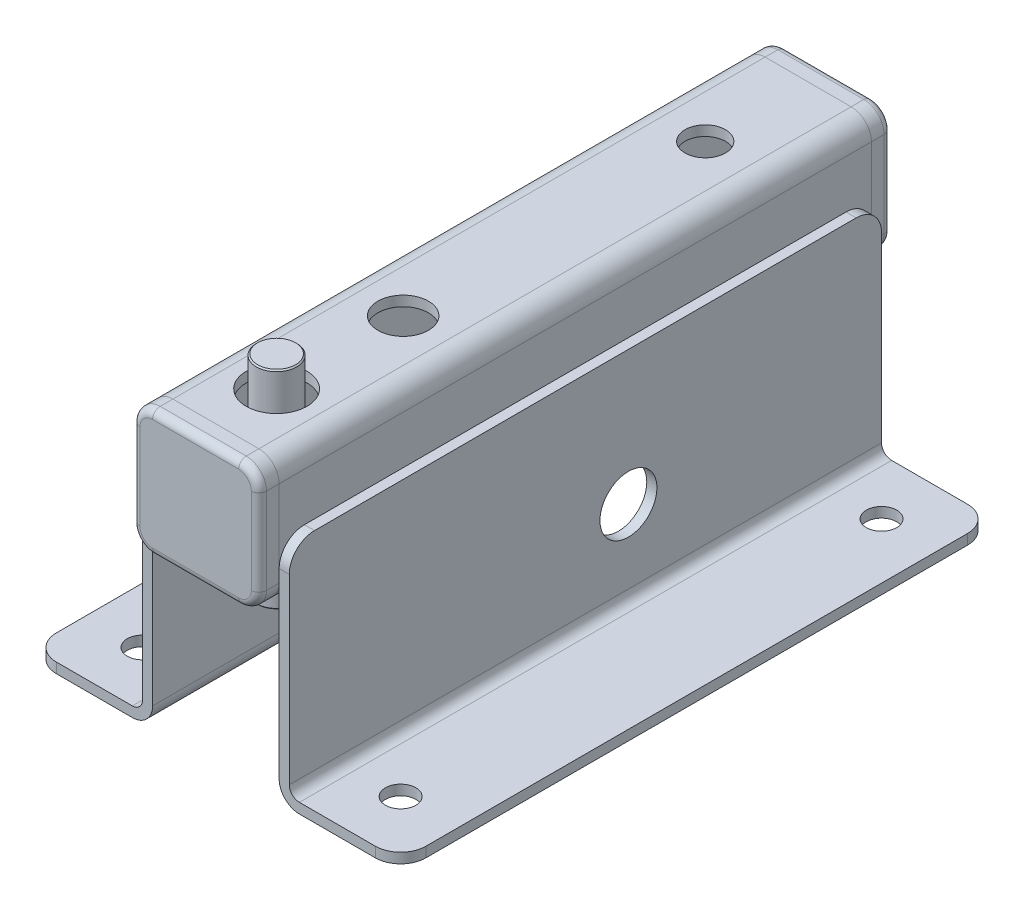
ISO-10303-21;
HEADER;
FILE_DESCRIPTION(('STEP AP214'),'2;1');
FILE_NAME('part.step','',(''),(''),'','','');
FILE_SCHEMA(('AUTOMOTIVE_DESIGN { 1 0 10303 214 1 1 1 1 }'));
ENDSEC;
DATA;
#1=APPLICATION_CONTEXT('core data for automotive mechanical design processes');
#2=APPLICATION_PROTOCOL_DEFINITION('international standard','automotive_design',2000,#1);
#3=PRODUCT_CONTEXT('',#1,'mechanical');
#4=PRODUCT('Part','Part','',(#3));
#5=PRODUCT_RELATED_PRODUCT_CATEGORY('part','',(#4));
#6=PRODUCT_DEFINITION_FORMATION('','',#4);
#7=PRODUCT_DEFINITION_CONTEXT('part definition',#1,'design');
#8=PRODUCT_DEFINITION('design','',#6,#7);
#9=PRODUCT_DEFINITION_SHAPE('','',#8);
#10=(LENGTH_UNIT() NAMED_UNIT(*) SI_UNIT(.MILLI.,.METRE.));
#11=(NAMED_UNIT(*) PLANE_ANGLE_UNIT() SI_UNIT($,.RADIAN.));
#12=(NAMED_UNIT(*) SI_UNIT($,.STERADIAN.) SOLID_ANGLE_UNIT());
#13=UNCERTAINTY_MEASURE_WITH_UNIT(LENGTH_MEASURE(1.E-05),#10,'distance_accuracy_value','');
#14=(GEOMETRIC_REPRESENTATION_CONTEXT(3) GLOBAL_UNCERTAINTY_ASSIGNED_CONTEXT((#13)) GLOBAL_UNIT_ASSIGNED_CONTEXT((#10,
#11,#12)) REPRESENTATION_CONTEXT('',''));
#15=CARTESIAN_POINT('',(0.,0.,0.));
#16=DIRECTION('',(0.,0.,1.));
#17=DIRECTION('',(1.,0.,0.));
#18=AXIS2_PLACEMENT_3D('',#15,#16,#17);
#19=CARTESIAN_POINT('',(-8.5,8.5,-121.));
#20=DIRECTION('',(0.,0.,1.));
#21=DIRECTION('',(1.,0.,0.));
#22=AXIS2_PLACEMENT_3D('',#19,#20,#21);
#23=CYLINDRICAL_SURFACE('',#22,4.);
#24=DIRECTION('',(0.,0.,1.));
#25=VECTOR('',#24,1.);
#26=CARTESIAN_POINT('',(-8.5,12.5,-121.));
#27=LINE('',#26,#25);
#28=CARTESIAN_POINT('',(-8.5,12.5,-119.5));
#29=VERTEX_POINT('',#28);
#30=CARTESIAN_POINT('',(-8.5,12.5,-117.));
#31=VERTEX_POINT('',#30);
#32=EDGE_CURVE('E136',#29,#31,#27,.T.);
#33=ORIENTED_EDGE('',*,*,#32,.F.);
#34=CARTESIAN_POINT('',(-8.5,8.5,-119.5));
#35=DIRECTION('',(0.,0.,-1.));
#36=DIRECTION('',(-1.,0.,0.));
#37=AXIS2_PLACEMENT_3D('',#34,#35,#36);
#38=CIRCLE('',#37,4.);
#39=CARTESIAN_POINT('',(-12.5,8.5,-119.5));
#40=VERTEX_POINT('',#39);
#41=EDGE_CURVE('E213',#29,#40,#38,.F.);
#42=ORIENTED_EDGE('',*,*,#41,.T.);
#43=DIRECTION('',(0.,0.,1.));
#44=VECTOR('',#43,1.);
#45=CARTESIAN_POINT('',(-12.5,8.5,-121.));
#46=LINE('',#45,#44);
#47=CARTESIAN_POINT('',(-12.5,8.5,-117.));
#48=VERTEX_POINT('',#47);
#49=EDGE_CURVE('E160',#40,#48,#46,.T.);
#50=ORIENTED_EDGE('',*,*,#49,.T.);
#51=CARTESIAN_POINT('',(-8.5,8.5,-117.));
#52=DIRECTION('',(0.,0.,-1.));
#53=DIRECTION('',(-1.,0.,0.));
#54=AXIS2_PLACEMENT_3D('',#51,#52,#53);
#55=CIRCLE('',#54,4.);
#56=EDGE_CURVE('E154',#48,#31,#55,.T.);
#57=ORIENTED_EDGE('',*,*,#56,.T.);
#58=EDGE_LOOP('',(#33,#42,#50,#57));
#59=FACE_BOUND('',#58,.T.);
#60=ADVANCED_FACE('F46',(#59),#23,.T.);
#61=CARTESIAN_POINT('',(-8.5,12.5,-121.));
#62=DIRECTION('',(0.,-1.,0.));
#63=DIRECTION('',(1.,0.,0.));
#64=AXIS2_PLACEMENT_3D('',#61,#62,#63);
#65=PLANE('',#64);
#66=DIRECTION('',(0.,0.,1.));
#67=VECTOR('',#66,1.);
#68=CARTESIAN_POINT('',(8.5,12.5,-121.));
#69=LINE('',#68,#67);
#70=CARTESIAN_POINT('',(8.5,12.5,-119.5));
#71=VERTEX_POINT('',#70);
#72=CARTESIAN_POINT('',(8.5,12.5,-117.));
#73=VERTEX_POINT('',#72);
#74=EDGE_CURVE('E148',#71,#73,#69,.T.);
#75=ORIENTED_EDGE('',*,*,#74,.F.);
#76=DIRECTION('',(1.,0.,0.));
#77=VECTOR('',#76,1.);
#78=CARTESIAN_POINT('',(-8.5,12.5,-119.5));
#79=LINE('',#78,#77);
#80=EDGE_CURVE('E143',#71,#29,#79,.F.);
#81=ORIENTED_EDGE('',*,*,#80,.T.);
#82=ORIENTED_EDGE('',*,*,#32,.T.);
#83=DIRECTION('',(1.,0.,0.));
#84=VECTOR('',#83,1.);
#85=CARTESIAN_POINT('',(-8.5,12.5,-117.));
#86=LINE('',#85,#84);
#87=EDGE_CURVE('E140',#31,#73,#86,.T.);
#88=ORIENTED_EDGE('',*,*,#87,.T.);
#89=EDGE_LOOP('',(#75,#81,#82,#88));
#90=FACE_BOUND('',#89,.T.);
#91=ADVANCED_FACE('F139',(#90),#65,.F.);
#92=CARTESIAN_POINT('',(8.5,8.5,-121.));
#93=DIRECTION('',(0.,0.,1.));
#94=DIRECTION('',(1.,0.,0.));
#95=AXIS2_PLACEMENT_3D('',#92,#93,#94);
#96=CYLINDRICAL_SURFACE('',#95,4.);
#97=DIRECTION('',(0.,0.,1.));
#98=VECTOR('',#97,1.);
#99=CARTESIAN_POINT('',(12.5,8.5,-121.));
#100=LINE('',#99,#98);
#101=CARTESIAN_POINT('',(12.5,8.5,-119.5));
#102=VERTEX_POINT('',#101);
#103=CARTESIAN_POINT('',(12.5,8.5,-117.));
#104=VERTEX_POINT('',#103);
#105=EDGE_CURVE('E190',#102,#104,#100,.T.);
#106=ORIENTED_EDGE('',*,*,#105,.F.);
#107=CARTESIAN_POINT('',(8.5,8.5,-119.5));
#108=DIRECTION('',(0.,0.,-1.));
#109=DIRECTION('',(-1.,0.,0.));
#110=AXIS2_PLACEMENT_3D('',#107,#108,#109);
#111=CIRCLE('',#110,4.);
#112=EDGE_CURVE('E209',#102,#71,#111,.F.);
#113=ORIENTED_EDGE('',*,*,#112,.T.);
#114=ORIENTED_EDGE('',*,*,#74,.T.);
#115=CARTESIAN_POINT('',(8.5,8.5,-117.));
#116=DIRECTION('',(0.,0.,-1.));
#117=DIRECTION('',(-1.,0.,0.));
#118=AXIS2_PLACEMENT_3D('',#115,#116,#117);
#119=CIRCLE('',#118,4.);
#120=EDGE_CURVE('E157',#73,#104,#119,.T.);
#121=ORIENTED_EDGE('',*,*,#120,.T.);
#122=EDGE_LOOP('',(#106,#113,#114,#121));
#123=FACE_BOUND('',#122,.T.);
#124=ADVANCED_FACE('F264',(#123),#96,.T.);
#125=CARTESIAN_POINT('',(12.5,8.5,-121.));
#126=DIRECTION('',(-1.,0.,0.));
#127=DIRECTION('',(0.,-1.,0.));
#128=AXIS2_PLACEMENT_3D('',#125,#126,#127);
#129=PLANE('',#128);
#130=DIRECTION('',(0.,0.,1.));
#131=VECTOR('',#130,1.);
#132=CARTESIAN_POINT('',(12.5,-8.5,-121.));
#133=LINE('',#132,#131);
#134=CARTESIAN_POINT('',(12.5,-8.5,-119.5));
#135=VERTEX_POINT('',#134);
#136=CARTESIAN_POINT('',(12.5,-8.5,-117.));
#137=VERTEX_POINT('',#136);
#138=EDGE_CURVE('E188',#135,#137,#133,.T.);
#139=ORIENTED_EDGE('',*,*,#138,.F.);
#140=DIRECTION('',(0.,-1.,0.));
#141=VECTOR('',#140,1.);
#142=CARTESIAN_POINT('',(12.5,8.5,-119.5));
#143=LINE('',#142,#141);
#144=EDGE_CURVE('E12',#135,#102,#143,.F.);
#145=ORIENTED_EDGE('',*,*,#144,.T.);
#146=ORIENTED_EDGE('',*,*,#105,.T.);
#147=DIRECTION('',(0.,-1.,0.));
#148=VECTOR('',#147,1.);
#149=CARTESIAN_POINT('',(12.5,8.5,-117.));
#150=LINE('',#149,#148);
#151=EDGE_CURVE('E167',#104,#137,#150,.T.);
#152=ORIENTED_EDGE('',*,*,#151,.T.);
#153=EDGE_LOOP('',(#139,#145,#146,#152));
#154=FACE_BOUND('',#153,.T.);
#155=ADVANCED_FACE('F261',(#154),#129,.F.);
#156=CARTESIAN_POINT('',(8.49999999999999,-8.5,-121.));
#157=DIRECTION('',(0.,0.,1.));
#158=DIRECTION('',(1.,0.,0.));
#159=AXIS2_PLACEMENT_3D('',#156,#157,#158);
#160=CYLINDRICAL_SURFACE('',#159,4.00000000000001);
#161=DIRECTION('',(0.,0.,1.));
#162=VECTOR('',#161,1.);
#163=CARTESIAN_POINT('',(8.5,-12.5,-121.));
#164=LINE('',#163,#162);
#165=CARTESIAN_POINT('',(8.5,-12.5,-119.5));
#166=VERTEX_POINT('',#165);
#167=CARTESIAN_POINT('',(8.5,-12.5,-117.));
#168=VERTEX_POINT('',#167);
#169=EDGE_CURVE('E186',#166,#168,#164,.T.);
#170=ORIENTED_EDGE('',*,*,#169,.F.);
#171=CARTESIAN_POINT('',(8.49999999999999,-8.5,-119.5));
#172=DIRECTION('',(0.,0.,-1.));
#173=DIRECTION('',(-1.,0.,0.));
#174=AXIS2_PLACEMENT_3D('',#171,#172,#173);
#175=CIRCLE('',#174,4.00000000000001);
#176=EDGE_CURVE('E55',#166,#135,#175,.F.);
#177=ORIENTED_EDGE('',*,*,#176,.T.);
#178=ORIENTED_EDGE('',*,*,#138,.T.);
#179=CARTESIAN_POINT('',(8.49999999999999,-8.5,-117.));
#180=DIRECTION('',(0.,0.,-1.));
#181=DIRECTION('',(-1.,0.,0.));
#182=AXIS2_PLACEMENT_3D('',#179,#180,#181);
#183=CIRCLE('',#182,4.00000000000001);
#184=EDGE_CURVE('E170',#137,#168,#183,.T.);
#185=ORIENTED_EDGE('',*,*,#184,.T.);
#186=EDGE_LOOP('',(#170,#177,#178,#185));
#187=FACE_BOUND('',#186,.T.);
#188=ADVANCED_FACE('F387',(#187),#160,.T.);
#189=CARTESIAN_POINT('',(8.5,-12.5,-121.));
#190=DIRECTION('',(0.,1.,0.));
#191=DIRECTION('',(-1.,0.,0.));
#192=AXIS2_PLACEMENT_3D('',#189,#190,#191);
#193=PLANE('',#192);
#194=DIRECTION('',(0.,0.,1.));
#195=VECTOR('',#194,1.);
#196=CARTESIAN_POINT('',(-8.5,-12.5,-121.));
#197=LINE('',#196,#195);
#198=CARTESIAN_POINT('',(-8.5,-12.5,-119.5));
#199=VERTEX_POINT('',#198);
#200=CARTESIAN_POINT('',(-8.5,-12.5,-117.));
#201=VERTEX_POINT('',#200);
#202=EDGE_CURVE('E184',#199,#201,#197,.T.);
#203=ORIENTED_EDGE('',*,*,#202,.F.);
#204=DIRECTION('',(-1.,0.,0.));
#205=VECTOR('',#204,1.);
#206=CARTESIAN_POINT('',(8.5,-12.5,-119.5));
#207=LINE('',#206,#205);
#208=EDGE_CURVE('E70',#199,#166,#207,.F.);
#209=ORIENTED_EDGE('',*,*,#208,.T.);
#210=ORIENTED_EDGE('',*,*,#169,.T.);
#211=DIRECTION('',(-1.,0.,0.));
#212=VECTOR('',#211,1.);
#213=CARTESIAN_POINT('',(8.5,-12.5,-117.));
#214=LINE('',#213,#212);
#215=EDGE_CURVE('E173',#168,#201,#214,.T.);
#216=ORIENTED_EDGE('',*,*,#215,.T.);
#217=EDGE_LOOP('',(#203,#209,#210,#216));
#218=FACE_BOUND('',#217,.T.);
#219=ADVANCED_FACE('F378',(#218),#193,.F.);
#220=CARTESIAN_POINT('',(-8.5,-8.5,-121.));
#221=DIRECTION('',(0.,0.,1.));
#222=DIRECTION('',(1.,0.,0.));
#223=AXIS2_PLACEMENT_3D('',#220,#221,#222);
#224=CYLINDRICAL_SURFACE('',#223,4.);
#225=DIRECTION('',(0.,0.,1.));
#226=VECTOR('',#225,1.);
#227=CARTESIAN_POINT('',(-12.5,-8.5,-121.));
#228=LINE('',#227,#226);
#229=CARTESIAN_POINT('',(-12.5,-8.5,-119.5));
#230=VERTEX_POINT('',#229);
#231=CARTESIAN_POINT('',(-12.5,-8.5,-117.));
#232=VERTEX_POINT('',#231);
#233=EDGE_CURVE('E182',#230,#232,#228,.T.);
#234=ORIENTED_EDGE('',*,*,#233,.F.);
#235=CARTESIAN_POINT('',(-8.5,-8.5,-119.5));
#236=DIRECTION('',(0.,0.,-1.));
#237=DIRECTION('',(-1.,0.,0.));
#238=AXIS2_PLACEMENT_3D('',#235,#236,#237);
#239=CIRCLE('',#238,4.);
#240=EDGE_CURVE('E217',#230,#199,#239,.F.);
#241=ORIENTED_EDGE('',*,*,#240,.T.);
#242=ORIENTED_EDGE('',*,*,#202,.T.);
#243=CARTESIAN_POINT('',(-8.5,-8.5,-117.));
#244=DIRECTION('',(0.,0.,-1.));
#245=DIRECTION('',(-1.,0.,0.));
#246=AXIS2_PLACEMENT_3D('',#243,#244,#245);
#247=CIRCLE('',#246,4.);
#248=EDGE_CURVE('E176',#201,#232,#247,.T.);
#249=ORIENTED_EDGE('',*,*,#248,.T.);
#250=EDGE_LOOP('',(#234,#241,#242,#249));
#251=FACE_BOUND('',#250,.T.);
#252=ADVANCED_FACE('F370',(#251),#224,.T.);
#253=CARTESIAN_POINT('',(-12.5,-8.5,-121.));
#254=DIRECTION('',(1.,0.,0.));
#255=DIRECTION('',(0.,0.,-1.));
#256=AXIS2_PLACEMENT_3D('',#253,#254,#255);
#257=PLANE('',#256);
#258=ORIENTED_EDGE('',*,*,#49,.F.);
#259=DIRECTION('',(0.,1.,0.));
#260=VECTOR('',#259,1.);
#261=CARTESIAN_POINT('',(-12.5,-8.5,-119.5));
#262=LINE('',#261,#260);
#263=EDGE_CURVE('E215',#40,#230,#262,.F.);
#264=ORIENTED_EDGE('',*,*,#263,.T.);
#265=ORIENTED_EDGE('',*,*,#233,.T.);
#266=DIRECTION('',(0.,1.,0.));
#267=VECTOR('',#266,1.);
#268=CARTESIAN_POINT('',(-12.5,-8.5,-117.));
#269=LINE('',#268,#267);
#270=EDGE_CURVE('E179',#232,#48,#269,.T.);
#271=ORIENTED_EDGE('',*,*,#270,.T.);
#272=EDGE_LOOP('',(#258,#264,#265,#271));
#273=FACE_BOUND('',#272,.T.);
#274=ADVANCED_FACE('F278',(#273),#257,.F.);
#275=CARTESIAN_POINT('',(-8.5,8.5,-121.));
#276=DIRECTION('',(0.,0.,-1.));
#277=DIRECTION('',(-1.,0.,0.));
#278=AXIS2_PLACEMENT_3D('',#275,#276,#277);
#279=PLANE('',#278);
#280=DIRECTION('',(1.,0.,0.));
#281=VECTOR('',#280,1.);
#282=CARTESIAN_POINT('',(8.5,11.,-121.));
#283=LINE('',#282,#281);
#284=CARTESIAN_POINT('',(-8.5,11.,-121.));
#285=VERTEX_POINT('',#284);
#286=CARTESIAN_POINT('',(8.5,11.,-121.));
#287=VERTEX_POINT('',#286);
#288=EDGE_CURVE('E204',#285,#287,#283,.T.);
#289=ORIENTED_EDGE('',*,*,#288,.T.);
#290=CARTESIAN_POINT('',(8.5,8.5,-121.));
#291=DIRECTION('',(0.,0.,-1.));
#292=DIRECTION('',(-1.,0.,0.));
#293=AXIS2_PLACEMENT_3D('',#290,#291,#292);
#294=CIRCLE('',#293,2.5);
#295=CARTESIAN_POINT('',(11.,8.5,-121.));
#296=VERTEX_POINT('',#295);
#297=EDGE_CURVE('E206',#287,#296,#294,.T.);
#298=ORIENTED_EDGE('',*,*,#297,.T.);
#299=DIRECTION('',(0.,-1.,0.));
#300=VECTOR('',#299,1.);
#301=CARTESIAN_POINT('',(11.,-8.5,-121.));
#302=LINE('',#301,#300);
#303=CARTESIAN_POINT('',(11.,-8.5,-121.));
#304=VERTEX_POINT('',#303);
#305=EDGE_CURVE('E147',#296,#304,#302,.T.);
#306=ORIENTED_EDGE('',*,*,#305,.T.);
#307=CARTESIAN_POINT('',(8.49999999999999,-8.5,-121.));
#308=DIRECTION('',(0.,0.,-1.));
#309=DIRECTION('',(-1.,0.,0.));
#310=AXIS2_PLACEMENT_3D('',#307,#308,#309);
#311=CIRCLE('',#310,2.50000000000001);
#312=CARTESIAN_POINT('',(8.5,-11.,-121.));
#313=VERTEX_POINT('',#312);
#314=EDGE_CURVE('E194',#304,#313,#311,.T.);
#315=ORIENTED_EDGE('',*,*,#314,.T.);
#316=DIRECTION('',(-1.,0.,0.));
#317=VECTOR('',#316,1.);
#318=CARTESIAN_POINT('',(-8.5,-11.,-121.));
#319=LINE('',#318,#317);
#320=CARTESIAN_POINT('',(-8.5,-11.,-121.));
#321=VERTEX_POINT('',#320);
#322=EDGE_CURVE('E196',#313,#321,#319,.T.);
#323=ORIENTED_EDGE('',*,*,#322,.T.);
#324=CARTESIAN_POINT('',(-8.5,-8.5,-121.));
#325=DIRECTION('',(0.,0.,-1.));
#326=DIRECTION('',(-1.,0.,0.));
#327=AXIS2_PLACEMENT_3D('',#324,#325,#326);
#328=CIRCLE('',#327,2.5);
#329=CARTESIAN_POINT('',(-11.,-8.5,-121.));
#330=VERTEX_POINT('',#329);
#331=EDGE_CURVE('E198',#321,#330,#328,.T.);
#332=ORIENTED_EDGE('',*,*,#331,.T.);
#333=DIRECTION('',(0.,1.,0.));
#334=VECTOR('',#333,1.);
#335=CARTESIAN_POINT('',(-11.,8.5,-121.));
#336=LINE('',#335,#334);
#337=CARTESIAN_POINT('',(-11.,8.5,-121.));
#338=VERTEX_POINT('',#337);
#339=EDGE_CURVE('E200',#330,#338,#336,.T.);
#340=ORIENTED_EDGE('',*,*,#339,.T.);
#341=CARTESIAN_POINT('',(-8.5,8.5,-121.));
#342=DIRECTION('',(0.,0.,-1.));
#343=DIRECTION('',(-1.,0.,0.));
#344=AXIS2_PLACEMENT_3D('',#341,#342,#343);
#345=CIRCLE('',#344,2.5);
#346=EDGE_CURVE('E202',#338,#285,#345,.T.);
#347=ORIENTED_EDGE('',*,*,#346,.T.);
#348=EDGE_LOOP('',(#289,#298,#306,#315,#323,#332,#340,#347));
#349=FACE_BOUND('',#348,.T.);
#350=ADVANCED_FACE('F248',(#349),#279,.T.);
#351=CARTESIAN_POINT('',(-8.5,8.5,-117.));
#352=DIRECTION('',(0.,0.,-1.));
#353=DIRECTION('',(-1.,0.,0.));
#354=AXIS2_PLACEMENT_3D('',#351,#352,#353);
#355=PLANE('',#354);
#356=ORIENTED_EDGE('',*,*,#56,.F.);
#357=ORIENTED_EDGE('',*,*,#270,.F.);
#358=ORIENTED_EDGE('',*,*,#248,.F.);
#359=ORIENTED_EDGE('',*,*,#215,.F.);
#360=ORIENTED_EDGE('',*,*,#184,.F.);
#361=ORIENTED_EDGE('',*,*,#151,.F.);
#362=ORIENTED_EDGE('',*,*,#120,.F.);
#363=ORIENTED_EDGE('',*,*,#87,.F.);
#364=EDGE_LOOP('',(#356,#357,#358,#359,#360,#361,#362,#363));
#365=FACE_BOUND('',#364,.T.);
#366=ADVANCED_FACE('F152',(#365),#355,.F.);
#367=CARTESIAN_POINT('',(-8.5,-8.5,-119.5));
#368=DIRECTION('',(0.,0.,-1.));
#369=DIRECTION('',(-1.,0.,0.));
#370=AXIS2_PLACEMENT_3D('',#367,#368,#369);
#371=TOROIDAL_SURFACE('',#370,2.5,1.5);
#372=CARTESIAN_POINT('',(-8.5,-11.,-119.5));
#373=DIRECTION('',(1.,0.,0.));
#374=DIRECTION('',(0.,0.,-1.));
#375=AXIS2_PLACEMENT_3D('',#372,#373,#374);
#376=CIRCLE('',#375,1.5);
#377=EDGE_CURVE('E164',#199,#321,#376,.T.);
#378=ORIENTED_EDGE('',*,*,#377,.F.);
#379=ORIENTED_EDGE('',*,*,#240,.F.);
#380=CARTESIAN_POINT('',(-11.,-8.5,-119.5));
#381=DIRECTION('',(0.,1.,0.));
#382=DIRECTION('',(0.,0.,1.));
#383=AXIS2_PLACEMENT_3D('',#380,#381,#382);
#384=CIRCLE('',#383,1.5);
#385=EDGE_CURVE('E50',#330,#230,#384,.T.);
#386=ORIENTED_EDGE('',*,*,#385,.F.);
#387=ORIENTED_EDGE('',*,*,#331,.F.);
#388=EDGE_LOOP('',(#378,#379,#386,#387));
#389=FACE_BOUND('',#388,.T.);
#390=ADVANCED_FACE('F48',(#389),#371,.T.);
#391=CARTESIAN_POINT('',(-11.,8.5,-119.5));
#392=DIRECTION('',(0.,-1.,0.));
#393=DIRECTION('',(0.,0.,-1.));
#394=AXIS2_PLACEMENT_3D('',#391,#392,#393);
#395=CYLINDRICAL_SURFACE('',#394,1.5);
#396=ORIENTED_EDGE('',*,*,#385,.T.);
#397=ORIENTED_EDGE('',*,*,#263,.F.);
#398=CARTESIAN_POINT('',(-11.,8.5,-119.5));
#399=DIRECTION('',(0.,1.,0.));
#400=DIRECTION('',(0.,0.,1.));
#401=AXIS2_PLACEMENT_3D('',#398,#399,#400);
#402=CIRCLE('',#401,1.5);
#403=EDGE_CURVE('E234',#338,#40,#402,.T.);
#404=ORIENTED_EDGE('',*,*,#403,.F.);
#405=ORIENTED_EDGE('',*,*,#339,.F.);
#406=EDGE_LOOP('',(#396,#397,#404,#405));
#407=FACE_BOUND('',#406,.T.);
#408=ADVANCED_FACE('F281',(#407),#395,.T.);
#409=CARTESIAN_POINT('',(-8.50000000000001,-11.,-119.5));
#410=DIRECTION('',(1.,0.,0.));
#411=DIRECTION('',(0.,1.,0.));
#412=AXIS2_PLACEMENT_3D('',#409,#410,#411);
#413=CYLINDRICAL_SURFACE('',#412,1.5);
#414=ORIENTED_EDGE('',*,*,#377,.T.);
#415=ORIENTED_EDGE('',*,*,#322,.F.);
#416=CARTESIAN_POINT('',(8.5,-11.,-119.5));
#417=DIRECTION('',(1.,0.,0.));
#418=DIRECTION('',(0.,1.,0.));
#419=AXIS2_PLACEMENT_3D('',#416,#417,#418);
#420=CIRCLE('',#419,1.5);
#421=EDGE_CURVE('E231',#166,#313,#420,.T.);
#422=ORIENTED_EDGE('',*,*,#421,.F.);
#423=ORIENTED_EDGE('',*,*,#208,.F.);
#424=EDGE_LOOP('',(#414,#415,#422,#423));
#425=FACE_BOUND('',#424,.T.);
#426=ADVANCED_FACE('F240',(#425),#413,.T.);
#427=CARTESIAN_POINT('',(-8.5,8.5,-119.5));
#428=DIRECTION('',(0.,0.,-1.));
#429=DIRECTION('',(-1.,0.,0.));
#430=AXIS2_PLACEMENT_3D('',#427,#428,#429);
#431=TOROIDAL_SURFACE('',#430,2.5,1.5);
#432=ORIENTED_EDGE('',*,*,#403,.T.);
#433=ORIENTED_EDGE('',*,*,#41,.F.);
#434=CARTESIAN_POINT('',(-8.5,11.,-119.5));
#435=DIRECTION('',(1.,0.,0.));
#436=DIRECTION('',(0.,0.,-1.));
#437=AXIS2_PLACEMENT_3D('',#434,#435,#436);
#438=CIRCLE('',#437,1.5);
#439=EDGE_CURVE('E228',#285,#29,#438,.T.);
#440=ORIENTED_EDGE('',*,*,#439,.F.);
#441=ORIENTED_EDGE('',*,*,#346,.F.);
#442=EDGE_LOOP('',(#432,#433,#440,#441));
#443=FACE_BOUND('',#442,.T.);
#444=ADVANCED_FACE('F275',(#443),#431,.T.);
#445=CARTESIAN_POINT('',(8.49999999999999,-8.5,-119.5));
#446=DIRECTION('',(0.,0.,-1.));
#447=DIRECTION('',(-1.,0.,0.));
#448=AXIS2_PLACEMENT_3D('',#445,#446,#447);
#449=TOROIDAL_SURFACE('',#448,2.50000000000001,1.5);
#450=ORIENTED_EDGE('',*,*,#421,.T.);
#451=ORIENTED_EDGE('',*,*,#314,.F.);
#452=CARTESIAN_POINT('',(11.,-8.5,-119.5));
#453=DIRECTION('',(0.,1.,0.));
#454=DIRECTION('',(-1.,0.,0.));
#455=AXIS2_PLACEMENT_3D('',#452,#453,#454);
#456=CIRCLE('',#455,1.5);
#457=EDGE_CURVE('E225',#135,#304,#456,.T.);
#458=ORIENTED_EDGE('',*,*,#457,.F.);
#459=ORIENTED_EDGE('',*,*,#176,.F.);
#460=EDGE_LOOP('',(#450,#451,#458,#459));
#461=FACE_BOUND('',#460,.T.);
#462=ADVANCED_FACE('F254',(#461),#449,.T.);
#463=CARTESIAN_POINT('',(-8.5,11.,-119.5));
#464=DIRECTION('',(-1.,0.,0.));
#465=DIRECTION('',(0.,-1.,0.));
#466=AXIS2_PLACEMENT_3D('',#463,#464,#465);
#467=CYLINDRICAL_SURFACE('',#466,1.5);
#468=ORIENTED_EDGE('',*,*,#439,.T.);
#469=ORIENTED_EDGE('',*,*,#80,.F.);
#470=CARTESIAN_POINT('',(8.5,11.,-119.5));
#471=DIRECTION('',(1.,0.,0.));
#472=DIRECTION('',(0.,0.,-1.));
#473=AXIS2_PLACEMENT_3D('',#470,#471,#472);
#474=CIRCLE('',#473,1.5);
#475=EDGE_CURVE('E223',#287,#71,#474,.T.);
#476=ORIENTED_EDGE('',*,*,#475,.F.);
#477=ORIENTED_EDGE('',*,*,#288,.F.);
#478=EDGE_LOOP('',(#468,#469,#476,#477));
#479=FACE_BOUND('',#478,.T.);
#480=ADVANCED_FACE('F271',(#479),#467,.T.);
#481=CARTESIAN_POINT('',(11.,8.5,-119.5));
#482=DIRECTION('',(0.,1.,0.));
#483=DIRECTION('',(-1.,0.,0.));
#484=AXIS2_PLACEMENT_3D('',#481,#482,#483);
#485=CYLINDRICAL_SURFACE('',#484,1.5);
#486=ORIENTED_EDGE('',*,*,#457,.T.);
#487=ORIENTED_EDGE('',*,*,#305,.F.);
#488=CARTESIAN_POINT('',(11.,8.5,-119.5));
#489=DIRECTION('',(0.,1.,0.));
#490=DIRECTION('',(0.,0.,1.));
#491=AXIS2_PLACEMENT_3D('',#488,#489,#490);
#492=CIRCLE('',#491,1.5);
#493=EDGE_CURVE('E221',#102,#296,#492,.T.);
#494=ORIENTED_EDGE('',*,*,#493,.F.);
#495=ORIENTED_EDGE('',*,*,#144,.F.);
#496=EDGE_LOOP('',(#486,#487,#494,#495));
#497=FACE_BOUND('',#496,.T.);
#498=ADVANCED_FACE('F257',(#497),#485,.T.);
#499=CARTESIAN_POINT('',(8.5,8.5,-119.5));
#500=DIRECTION('',(0.,0.,-1.));
#501=DIRECTION('',(-1.,0.,0.));
#502=AXIS2_PLACEMENT_3D('',#499,#500,#501);
#503=TOROIDAL_SURFACE('',#502,2.5,1.5);
#504=ORIENTED_EDGE('',*,*,#475,.T.);
#505=ORIENTED_EDGE('',*,*,#112,.F.);
#506=ORIENTED_EDGE('',*,*,#493,.T.);
#507=ORIENTED_EDGE('',*,*,#297,.F.);
#508=EDGE_LOOP('',(#504,#505,#506,#507));
#509=FACE_BOUND('',#508,.T.);
#510=ADVANCED_FACE('F266',(#509),#503,.T.);
#511=CLOSED_SHELL('',(#60,#91,#124,#155,#188,#219,#252,#274,#350,#366,#390,#408,#426,#444,#462,
#480,#498,#510));
#512=MANIFOLD_SOLID_BREP('B2',#511);
#513=CARTESIAN_POINT('',(-8.5,8.5,4.));
#514=DIRECTION('',(0.,0.,-1.));
#515=DIRECTION('',(-1.,0.,0.));
#516=AXIS2_PLACEMENT_3D('',#513,#514,#515);
#517=CYLINDRICAL_SURFACE('',#516,4.);
#518=DIRECTION('',(0.,0.,-1.));
#519=VECTOR('',#518,1.);
#520=CARTESIAN_POINT('',(-12.5,8.5,4.));
#521=LINE('',#520,#519);
#522=CARTESIAN_POINT('',(-12.5,8.5,2.5));
#523=VERTEX_POINT('',#522);
#524=CARTESIAN_POINT('',(-12.5,8.5,0.));
#525=VERTEX_POINT('',#524);
#526=EDGE_CURVE('E534',#523,#525,#521,.T.);
#527=ORIENTED_EDGE('',*,*,#526,.F.);
#528=CARTESIAN_POINT('',(-8.5,8.5,2.5));
#529=DIRECTION('',(0.,0.,1.));
#530=DIRECTION('',(1.,0.,0.));
#531=AXIS2_PLACEMENT_3D('',#528,#529,#530);
#532=CIRCLE('',#531,4.);
#533=CARTESIAN_POINT('',(-8.5,12.5,2.5));
#534=VERTEX_POINT('',#533);
#535=EDGE_CURVE('E614',#523,#534,#532,.F.);
#536=ORIENTED_EDGE('',*,*,#535,.T.);
#537=DIRECTION('',(0.,0.,-1.));
#538=VECTOR('',#537,1.);
#539=CARTESIAN_POINT('',(-8.5,12.5,4.));
#540=LINE('',#539,#538);
#541=CARTESIAN_POINT('',(-8.5,12.5,0.));
#542=VERTEX_POINT('',#541);
#543=EDGE_CURVE('E557',#534,#542,#540,.T.);
#544=ORIENTED_EDGE('',*,*,#543,.T.);
#545=CARTESIAN_POINT('',(-8.5,8.5,0.));
#546=DIRECTION('',(0.,0.,1.));
#547=DIRECTION('',(1.,0.,0.));
#548=AXIS2_PLACEMENT_3D('',#545,#546,#547);
#549=CIRCLE('',#548,4.);
#550=EDGE_CURVE('E552',#542,#525,#549,.T.);
#551=ORIENTED_EDGE('',*,*,#550,.T.);
#552=EDGE_LOOP('',(#527,#536,#544,#551));
#553=FACE_BOUND('',#552,.T.);
#554=ADVANCED_FACE('F444',(#553),#517,.T.);
#555=CARTESIAN_POINT('',(-12.5,8.5,4.));
#556=DIRECTION('',(1.,0.,0.));
#557=DIRECTION('',(0.,0.,-1.));
#558=AXIS2_PLACEMENT_3D('',#555,#556,#557);
#559=PLANE('',#558);
#560=DIRECTION('',(0.,0.,-1.));
#561=VECTOR('',#560,1.);
#562=CARTESIAN_POINT('',(-12.5,-8.50000000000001,4.));
#563=LINE('',#562,#561);
#564=CARTESIAN_POINT('',(-12.5,-8.50000000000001,2.5));
#565=VERTEX_POINT('',#564);
#566=CARTESIAN_POINT('',(-12.5,-8.50000000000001,0.));
#567=VERTEX_POINT('',#566);
#568=EDGE_CURVE('E546',#565,#567,#563,.T.);
#569=ORIENTED_EDGE('',*,*,#568,.F.);
#570=DIRECTION('',(0.,-1.,0.));
#571=VECTOR('',#570,1.);
#572=CARTESIAN_POINT('',(-12.5,8.5,2.5));
#573=LINE('',#572,#571);
#574=EDGE_CURVE('E541',#565,#523,#573,.F.);
#575=ORIENTED_EDGE('',*,*,#574,.T.);
#576=ORIENTED_EDGE('',*,*,#526,.T.);
#577=DIRECTION('',(0.,-1.,0.));
#578=VECTOR('',#577,1.);
#579=CARTESIAN_POINT('',(-12.5,8.5,0.));
#580=LINE('',#579,#578);
#581=EDGE_CURVE('E538',#525,#567,#580,.T.);
#582=ORIENTED_EDGE('',*,*,#581,.T.);
#583=EDGE_LOOP('',(#569,#575,#576,#582));
#584=FACE_BOUND('',#583,.T.);
#585=ADVANCED_FACE('F537',(#584),#559,.F.);
#586=CARTESIAN_POINT('',(-8.5,-8.5,4.));
#587=DIRECTION('',(0.,0.,-1.));
#588=DIRECTION('',(-1.,0.,0.));
#589=AXIS2_PLACEMENT_3D('',#586,#587,#588);
#590=CYLINDRICAL_SURFACE('',#589,4.);
#591=DIRECTION('',(0.,0.,-1.));
#592=VECTOR('',#591,1.);
#593=CARTESIAN_POINT('',(-8.5,-12.5,4.));
#594=LINE('',#593,#592);
#595=CARTESIAN_POINT('',(-8.5,-12.5,2.5));
#596=VERTEX_POINT('',#595);
#597=CARTESIAN_POINT('',(-8.5,-12.5,0.));
#598=VERTEX_POINT('',#597);
#599=EDGE_CURVE('E587',#596,#598,#594,.T.);
#600=ORIENTED_EDGE('',*,*,#599,.F.);
#601=CARTESIAN_POINT('',(-8.5,-8.5,2.5));
#602=DIRECTION('',(0.,0.,1.));
#603=DIRECTION('',(1.,0.,0.));
#604=AXIS2_PLACEMENT_3D('',#601,#602,#603);
#605=CIRCLE('',#604,4.);
#606=EDGE_CURVE('E611',#596,#565,#605,.F.);
#607=ORIENTED_EDGE('',*,*,#606,.T.);
#608=ORIENTED_EDGE('',*,*,#568,.T.);
#609=CARTESIAN_POINT('',(-8.5,-8.5,0.));
#610=DIRECTION('',(0.,0.,1.));
#611=DIRECTION('',(1.,0.,0.));
#612=AXIS2_PLACEMENT_3D('',#609,#610,#611);
#613=CIRCLE('',#612,4.);
#614=EDGE_CURVE('E555',#567,#598,#613,.T.);
#615=ORIENTED_EDGE('',*,*,#614,.T.);
#616=EDGE_LOOP('',(#600,#607,#608,#615));
#617=FACE_BOUND('',#616,.T.);
#618=ADVANCED_FACE('F678',(#617),#590,.T.);
#619=CARTESIAN_POINT('',(-8.5,-12.5,4.));
#620=DIRECTION('',(0.,1.,0.));
#621=DIRECTION('',(-1.,0.,0.));
#622=AXIS2_PLACEMENT_3D('',#619,#620,#621);
#623=PLANE('',#622);
#624=DIRECTION('',(0.,0.,-1.));
#625=VECTOR('',#624,1.);
#626=CARTESIAN_POINT('',(8.5,-12.5,4.));
#627=LINE('',#626,#625);
#628=CARTESIAN_POINT('',(8.5,-12.5,2.5));
#629=VERTEX_POINT('',#628);
#630=CARTESIAN_POINT('',(8.5,-12.5,0.));
#631=VERTEX_POINT('',#630);
#632=EDGE_CURVE('E585',#629,#631,#627,.T.);
#633=ORIENTED_EDGE('',*,*,#632,.F.);
#634=DIRECTION('',(1.,0.,0.));
#635=VECTOR('',#634,1.);
#636=CARTESIAN_POINT('',(-8.5,-12.5,2.5));
#637=LINE('',#636,#635);
#638=EDGE_CURVE('E609',#629,#596,#637,.F.);
#639=ORIENTED_EDGE('',*,*,#638,.T.);
#640=ORIENTED_EDGE('',*,*,#599,.T.);
#641=DIRECTION('',(1.,0.,0.));
#642=VECTOR('',#641,1.);
#643=CARTESIAN_POINT('',(-8.5,-12.5,0.));
#644=LINE('',#643,#642);
#645=EDGE_CURVE('E564',#598,#631,#644,.T.);
#646=ORIENTED_EDGE('',*,*,#645,.T.);
#647=EDGE_LOOP('',(#633,#639,#640,#646));
#648=FACE_BOUND('',#647,.T.);
#649=ADVANCED_FACE('F675',(#648),#623,.F.);
#650=CARTESIAN_POINT('',(8.49999999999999,-8.5,4.));
#651=DIRECTION('',(0.,0.,-1.));
#652=DIRECTION('',(-1.,0.,0.));
#653=AXIS2_PLACEMENT_3D('',#650,#651,#652);
#654=CYLINDRICAL_SURFACE('',#653,4.00000000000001);
#655=DIRECTION('',(0.,0.,-1.));
#656=VECTOR('',#655,1.);
#657=CARTESIAN_POINT('',(12.5,-8.5,4.));
#658=LINE('',#657,#656);
#659=CARTESIAN_POINT('',(12.5,-8.5,2.5));
#660=VERTEX_POINT('',#659);
#661=CARTESIAN_POINT('',(12.5,-8.5,0.));
#662=VERTEX_POINT('',#661);
#663=EDGE_CURVE('E583',#660,#662,#658,.T.);
#664=ORIENTED_EDGE('',*,*,#663,.F.);
#665=CARTESIAN_POINT('',(8.49999999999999,-8.5,2.5));
#666=DIRECTION('',(0.,0.,1.));
#667=DIRECTION('',(1.,0.,0.));
#668=AXIS2_PLACEMENT_3D('',#665,#666,#667);
#669=CIRCLE('',#668,4.00000000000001);
#670=EDGE_CURVE('E606',#660,#629,#669,.F.);
#671=ORIENTED_EDGE('',*,*,#670,.T.);
#672=ORIENTED_EDGE('',*,*,#632,.T.);
#673=CARTESIAN_POINT('',(8.49999999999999,-8.5,0.));
#674=DIRECTION('',(0.,0.,1.));
#675=DIRECTION('',(1.,0.,0.));
#676=AXIS2_PLACEMENT_3D('',#673,#674,#675);
#677=CIRCLE('',#676,4.00000000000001);
#678=EDGE_CURVE('E567',#631,#662,#677,.T.);
#679=ORIENTED_EDGE('',*,*,#678,.T.);
#680=EDGE_LOOP('',(#664,#671,#672,#679));
#681=FACE_BOUND('',#680,.T.);
#682=ADVANCED_FACE('F660',(#681),#654,.T.);
#683=CARTESIAN_POINT('',(12.5,-8.5,4.));
#684=DIRECTION('',(-1.,0.,0.));
#685=DIRECTION('',(0.,0.,1.));
#686=AXIS2_PLACEMENT_3D('',#683,#684,#685);
#687=PLANE('',#686);
#688=DIRECTION('',(0.,0.,-1.));
#689=VECTOR('',#688,1.);
#690=CARTESIAN_POINT('',(12.5,8.5,4.));
#691=LINE('',#690,#689);
#692=CARTESIAN_POINT('',(12.5,8.5,2.5));
#693=VERTEX_POINT('',#692);
#694=CARTESIAN_POINT('',(12.5,8.5,0.));
#695=VERTEX_POINT('',#694);
#696=EDGE_CURVE('E581',#693,#695,#691,.T.);
#697=ORIENTED_EDGE('',*,*,#696,.F.);
#698=DIRECTION('',(0.,1.,0.));
#699=VECTOR('',#698,1.);
#700=CARTESIAN_POINT('',(12.5,-8.5,2.5));
#701=LINE('',#700,#699);
#702=EDGE_CURVE('E44',#693,#660,#701,.F.);
#703=ORIENTED_EDGE('',*,*,#702,.T.);
#704=ORIENTED_EDGE('',*,*,#663,.T.);
#705=DIRECTION('',(0.,1.,0.));
#706=VECTOR('',#705,1.);
#707=CARTESIAN_POINT('',(12.5,-8.5,0.));
#708=LINE('',#707,#706);
#709=EDGE_CURVE('E570',#662,#695,#708,.T.);
#710=ORIENTED_EDGE('',*,*,#709,.T.);
#711=EDGE_LOOP('',(#697,#703,#704,#710));
#712=FACE_BOUND('',#711,.T.);
#713=ADVANCED_FACE('F657',(#712),#687,.F.);
#714=CARTESIAN_POINT('',(8.5,8.5,4.));
#715=DIRECTION('',(0.,0.,-1.));
#716=DIRECTION('',(-1.,0.,0.));
#717=AXIS2_PLACEMENT_3D('',#714,#715,#716);
#718=CYLINDRICAL_SURFACE('',#717,4.00000000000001);
#719=DIRECTION('',(0.,0.,-1.));
#720=VECTOR('',#719,1.);
#721=CARTESIAN_POINT('',(8.5,12.5,4.));
#722=LINE('',#721,#720);
#723=CARTESIAN_POINT('',(8.5,12.5,2.5));
#724=VERTEX_POINT('',#723);
#725=CARTESIAN_POINT('',(8.5,12.5,0.));
#726=VERTEX_POINT('',#725);
#727=EDGE_CURVE('E579',#724,#726,#722,.T.);
#728=ORIENTED_EDGE('',*,*,#727,.F.);
#729=CARTESIAN_POINT('',(8.5,8.5,2.5));
#730=DIRECTION('',(0.,0.,1.));
#731=DIRECTION('',(1.,0.,0.));
#732=AXIS2_PLACEMENT_3D('',#729,#730,#731);
#733=CIRCLE('',#732,4.00000000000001);
#734=EDGE_CURVE('E453',#724,#693,#733,.F.);
#735=ORIENTED_EDGE('',*,*,#734,.T.);
#736=ORIENTED_EDGE('',*,*,#696,.T.);
#737=CARTESIAN_POINT('',(8.5,8.5,0.));
#738=DIRECTION('',(0.,0.,1.));
#739=DIRECTION('',(1.,0.,0.));
#740=AXIS2_PLACEMENT_3D('',#737,#738,#739);
#741=CIRCLE('',#740,4.00000000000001);
#742=EDGE_CURVE('E573',#695,#726,#741,.T.);
#743=ORIENTED_EDGE('',*,*,#742,.T.);
#744=EDGE_LOOP('',(#728,#735,#736,#743));
#745=FACE_BOUND('',#744,.T.);
#746=ADVANCED_FACE('F773',(#745),#718,.T.);
#747=CARTESIAN_POINT('',(8.5,12.5,4.));
#748=DIRECTION('',(0.,-1.,0.));
#749=DIRECTION('',(0.,0.,-1.));
#750=AXIS2_PLACEMENT_3D('',#747,#748,#749);
#751=PLANE('',#750);
#752=ORIENTED_EDGE('',*,*,#543,.F.);
#753=DIRECTION('',(-1.,0.,0.));
#754=VECTOR('',#753,1.);
#755=CARTESIAN_POINT('',(8.5,12.5,2.5));
#756=LINE('',#755,#754);
#757=EDGE_CURVE('E468',#534,#724,#756,.F.);
#758=ORIENTED_EDGE('',*,*,#757,.T.);
#759=ORIENTED_EDGE('',*,*,#727,.T.);
#760=DIRECTION('',(-1.,0.,0.));
#761=VECTOR('',#760,1.);
#762=CARTESIAN_POINT('',(8.5,12.5,0.));
#763=LINE('',#762,#761);
#764=EDGE_CURVE('E576',#726,#542,#763,.T.);
#765=ORIENTED_EDGE('',*,*,#764,.T.);
#766=EDGE_LOOP('',(#752,#758,#759,#765));
#767=FACE_BOUND('',#766,.T.);
#768=ADVANCED_FACE('F765',(#767),#751,.F.);
#769=CARTESIAN_POINT('',(-8.5,8.5,4.));
#770=DIRECTION('',(0.,0.,1.));
#771=DIRECTION('',(1.,0.,0.));
#772=AXIS2_PLACEMENT_3D('',#769,#770,#771);
#773=PLANE('',#772);
#774=DIRECTION('',(1.,0.,0.));
#775=VECTOR('',#774,1.);
#776=CARTESIAN_POINT('',(8.5,-11.,4.));
#777=LINE('',#776,#775);
#778=CARTESIAN_POINT('',(-8.5,-11.,4.));
#779=VERTEX_POINT('',#778);
#780=CARTESIAN_POINT('',(8.5,-11.,4.));
#781=VERTEX_POINT('',#780);
#782=EDGE_CURVE('E601',#779,#781,#777,.T.);
#783=ORIENTED_EDGE('',*,*,#782,.T.);
#784=CARTESIAN_POINT('',(8.49999999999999,-8.5,4.));
#785=DIRECTION('',(0.,0.,1.));
#786=DIRECTION('',(1.,0.,0.));
#787=AXIS2_PLACEMENT_3D('',#784,#785,#786);
#788=CIRCLE('',#787,2.50000000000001);
#789=CARTESIAN_POINT('',(11.,-8.5,4.));
#790=VERTEX_POINT('',#789);
#791=EDGE_CURVE('E603',#781,#790,#788,.T.);
#792=ORIENTED_EDGE('',*,*,#791,.T.);
#793=DIRECTION('',(0.,1.,0.));
#794=VECTOR('',#793,1.);
#795=CARTESIAN_POINT('',(11.,8.5,4.));
#796=LINE('',#795,#794);
#797=CARTESIAN_POINT('',(11.,8.5,4.));
#798=VERTEX_POINT('',#797);
#799=EDGE_CURVE('E545',#790,#798,#796,.T.);
#800=ORIENTED_EDGE('',*,*,#799,.T.);
#801=CARTESIAN_POINT('',(8.5,8.5,4.));
#802=DIRECTION('',(0.,0.,1.));
#803=DIRECTION('',(1.,0.,0.));
#804=AXIS2_PLACEMENT_3D('',#801,#802,#803);
#805=CIRCLE('',#804,2.50000000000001);
#806=CARTESIAN_POINT('',(8.5,11.,4.));
#807=VERTEX_POINT('',#806);
#808=EDGE_CURVE('E591',#798,#807,#805,.T.);
#809=ORIENTED_EDGE('',*,*,#808,.T.);
#810=DIRECTION('',(-1.,0.,0.));
#811=VECTOR('',#810,1.);
#812=CARTESIAN_POINT('',(-8.5,11.,4.));
#813=LINE('',#812,#811);
#814=CARTESIAN_POINT('',(-8.5,11.,4.));
#815=VERTEX_POINT('',#814);
#816=EDGE_CURVE('E593',#807,#815,#813,.T.);
#817=ORIENTED_EDGE('',*,*,#816,.T.);
#818=CARTESIAN_POINT('',(-8.5,8.5,4.));
#819=DIRECTION('',(0.,0.,1.));
#820=DIRECTION('',(1.,0.,0.));
#821=AXIS2_PLACEMENT_3D('',#818,#819,#820);
#822=CIRCLE('',#821,2.5);
#823=CARTESIAN_POINT('',(-11.,8.5,4.));
#824=VERTEX_POINT('',#823);
#825=EDGE_CURVE('E595',#815,#824,#822,.T.);
#826=ORIENTED_EDGE('',*,*,#825,.T.);
#827=DIRECTION('',(0.,-1.,0.));
#828=VECTOR('',#827,1.);
#829=CARTESIAN_POINT('',(-11.,-8.50000000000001,4.));
#830=LINE('',#829,#828);
#831=CARTESIAN_POINT('',(-11.,-8.5,4.));
#832=VERTEX_POINT('',#831);
#833=EDGE_CURVE('E597',#824,#832,#830,.T.);
#834=ORIENTED_EDGE('',*,*,#833,.T.);
#835=CARTESIAN_POINT('',(-8.5,-8.5,4.));
#836=DIRECTION('',(0.,0.,1.));
#837=DIRECTION('',(1.,0.,0.));
#838=AXIS2_PLACEMENT_3D('',#835,#836,#837);
#839=CIRCLE('',#838,2.5);
#840=EDGE_CURVE('E599',#832,#779,#839,.T.);
#841=ORIENTED_EDGE('',*,*,#840,.T.);
#842=EDGE_LOOP('',(#783,#792,#800,#809,#817,#826,#834,#841));
#843=FACE_BOUND('',#842,.T.);
#844=ADVANCED_FACE('F644',(#843),#773,.T.);
#845=CARTESIAN_POINT('',(-8.5,8.5,0.));
#846=DIRECTION('',(0.,0.,1.));
#847=DIRECTION('',(1.,0.,0.));
#848=AXIS2_PLACEMENT_3D('',#845,#846,#847);
#849=PLANE('',#848);
#850=ORIENTED_EDGE('',*,*,#550,.F.);
#851=ORIENTED_EDGE('',*,*,#764,.F.);
#852=ORIENTED_EDGE('',*,*,#742,.F.);
#853=ORIENTED_EDGE('',*,*,#709,.F.);
#854=ORIENTED_EDGE('',*,*,#678,.F.);
#855=ORIENTED_EDGE('',*,*,#645,.F.);
#856=ORIENTED_EDGE('',*,*,#614,.F.);
#857=ORIENTED_EDGE('',*,*,#581,.F.);
#858=EDGE_LOOP('',(#850,#851,#852,#853,#854,#855,#856,#857));
#859=FACE_BOUND('',#858,.T.);
#860=ADVANCED_FACE('F550',(#859),#849,.F.);
#861=CARTESIAN_POINT('',(-8.5,8.5,2.5));
#862=DIRECTION('',(0.,0.,1.));
#863=DIRECTION('',(1.,0.,0.));
#864=AXIS2_PLACEMENT_3D('',#861,#862,#863);
#865=TOROIDAL_SURFACE('',#864,2.5,1.5);
#866=CARTESIAN_POINT('',(-8.5,11.,2.5));
#867=DIRECTION('',(1.,0.,0.));
#868=DIRECTION('',(0.,0.,-1.));
#869=AXIS2_PLACEMENT_3D('',#866,#867,#868);
#870=CIRCLE('',#869,1.5);
#871=EDGE_CURVE('E561',#534,#815,#870,.T.);
#872=ORIENTED_EDGE('',*,*,#871,.F.);
#873=ORIENTED_EDGE('',*,*,#535,.F.);
#874=CARTESIAN_POINT('',(-11.,8.5,2.5));
#875=DIRECTION('',(0.,-1.,0.));
#876=DIRECTION('',(0.,0.,-1.));
#877=AXIS2_PLACEMENT_3D('',#874,#875,#876);
#878=CIRCLE('',#877,1.5);
#879=EDGE_CURVE('E448',#824,#523,#878,.T.);
#880=ORIENTED_EDGE('',*,*,#879,.F.);
#881=ORIENTED_EDGE('',*,*,#825,.F.);
#882=EDGE_LOOP('',(#872,#873,#880,#881));
#883=FACE_BOUND('',#882,.T.);
#884=ADVANCED_FACE('F446',(#883),#865,.T.);
#885=CARTESIAN_POINT('',(-11.,8.5,2.5));
#886=DIRECTION('',(0.,1.,0.));
#887=DIRECTION('',(0.,0.,1.));
#888=AXIS2_PLACEMENT_3D('',#885,#886,#887);
#889=CYLINDRICAL_SURFACE('',#888,1.5);
#890=ORIENTED_EDGE('',*,*,#879,.T.);
#891=ORIENTED_EDGE('',*,*,#574,.F.);
#892=CARTESIAN_POINT('',(-11.,-8.5,2.5));
#893=DIRECTION('',(0.,-1.,0.));
#894=DIRECTION('',(1.,0.,0.));
#895=AXIS2_PLACEMENT_3D('',#892,#893,#894);
#896=CIRCLE('',#895,1.5);
#897=EDGE_CURVE('E631',#832,#565,#896,.T.);
#898=ORIENTED_EDGE('',*,*,#897,.F.);
#899=ORIENTED_EDGE('',*,*,#833,.F.);
#900=EDGE_LOOP('',(#890,#891,#898,#899));
#901=FACE_BOUND('',#900,.T.);
#902=ADVANCED_FACE('F683',(#901),#889,.T.);
#903=CARTESIAN_POINT('',(-8.5,11.,2.5));
#904=DIRECTION('',(1.,0.,0.));
#905=DIRECTION('',(0.,0.,-1.));
#906=AXIS2_PLACEMENT_3D('',#903,#904,#905);
#907=CYLINDRICAL_SURFACE('',#906,1.5);
#908=ORIENTED_EDGE('',*,*,#871,.T.);
#909=ORIENTED_EDGE('',*,*,#816,.F.);
#910=CARTESIAN_POINT('',(8.5,11.,2.5));
#911=DIRECTION('',(1.,0.,0.));
#912=DIRECTION('',(0.,0.,-1.));
#913=AXIS2_PLACEMENT_3D('',#910,#911,#912);
#914=CIRCLE('',#913,1.5);
#915=EDGE_CURVE('E628',#724,#807,#914,.T.);
#916=ORIENTED_EDGE('',*,*,#915,.F.);
#917=ORIENTED_EDGE('',*,*,#757,.F.);
#918=EDGE_LOOP('',(#908,#909,#916,#917));
#919=FACE_BOUND('',#918,.T.);
#920=ADVANCED_FACE('F637',(#919),#907,.T.);
#921=CARTESIAN_POINT('',(-8.5,-8.5,2.5));
#922=DIRECTION('',(0.,0.,1.));
#923=DIRECTION('',(1.,0.,0.));
#924=AXIS2_PLACEMENT_3D('',#921,#922,#923);
#925=TOROIDAL_SURFACE('',#924,2.5,1.5);
#926=ORIENTED_EDGE('',*,*,#897,.T.);
#927=ORIENTED_EDGE('',*,*,#606,.F.);
#928=CARTESIAN_POINT('',(-8.5,-11.,2.5));
#929=DIRECTION('',(1.,0.,0.));
#930=DIRECTION('',(0.,0.,-1.));
#931=AXIS2_PLACEMENT_3D('',#928,#929,#930);
#932=CIRCLE('',#931,1.5);
#933=EDGE_CURVE('E625',#779,#596,#932,.T.);
#934=ORIENTED_EDGE('',*,*,#933,.F.);
#935=ORIENTED_EDGE('',*,*,#840,.F.);
#936=EDGE_LOOP('',(#926,#927,#934,#935));
#937=FACE_BOUND('',#936,.T.);
#938=ADVANCED_FACE('F680',(#937),#925,.T.);
#939=CARTESIAN_POINT('',(8.5,8.5,2.5));
#940=DIRECTION('',(0.,0.,1.));
#941=DIRECTION('',(1.,0.,0.));
#942=AXIS2_PLACEMENT_3D('',#939,#940,#941);
#943=TOROIDAL_SURFACE('',#942,2.50000000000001,1.5);
#944=ORIENTED_EDGE('',*,*,#915,.T.);
#945=ORIENTED_EDGE('',*,*,#808,.F.);
#946=CARTESIAN_POINT('',(11.,8.5,2.5));
#947=DIRECTION('',(0.,-1.,0.));
#948=DIRECTION('',(1.,0.,0.));
#949=AXIS2_PLACEMENT_3D('',#946,#947,#948);
#950=CIRCLE('',#949,1.5);
#951=EDGE_CURVE('E622',#693,#798,#950,.T.);
#952=ORIENTED_EDGE('',*,*,#951,.F.);
#953=ORIENTED_EDGE('',*,*,#734,.F.);
#954=EDGE_LOOP('',(#944,#945,#952,#953));
#955=FACE_BOUND('',#954,.T.);
#956=ADVANCED_FACE('F650',(#955),#943,.T.);
#957=CARTESIAN_POINT('',(-8.50000000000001,-11.,2.5));
#958=DIRECTION('',(-1.,0.,0.));
#959=DIRECTION('',(0.,-1.,0.));
#960=AXIS2_PLACEMENT_3D('',#957,#958,#959);
#961=CYLINDRICAL_SURFACE('',#960,1.5);
#962=ORIENTED_EDGE('',*,*,#933,.T.);
#963=ORIENTED_EDGE('',*,*,#638,.F.);
#964=CARTESIAN_POINT('',(8.5,-11.,2.5));
#965=DIRECTION('',(1.,0.,0.));
#966=DIRECTION('',(0.,1.,0.));
#967=AXIS2_PLACEMENT_3D('',#964,#965,#966);
#968=CIRCLE('',#967,1.5);
#969=EDGE_CURVE('E620',#781,#629,#968,.T.);
#970=ORIENTED_EDGE('',*,*,#969,.F.);
#971=ORIENTED_EDGE('',*,*,#782,.F.);
#972=EDGE_LOOP('',(#962,#963,#970,#971));
#973=FACE_BOUND('',#972,.T.);
#974=ADVANCED_FACE('F671',(#973),#961,.T.);
#975=CARTESIAN_POINT('',(11.,8.5,2.5));
#976=DIRECTION('',(0.,-1.,0.));
#977=DIRECTION('',(0.,0.,-1.));
#978=AXIS2_PLACEMENT_3D('',#975,#976,#977);
#979=CYLINDRICAL_SURFACE('',#978,1.5);
#980=ORIENTED_EDGE('',*,*,#951,.T.);
#981=ORIENTED_EDGE('',*,*,#799,.F.);
#982=CARTESIAN_POINT('',(11.,-8.5,2.5));
#983=DIRECTION('',(0.,-1.,0.));
#984=DIRECTION('',(0.,0.,-1.));
#985=AXIS2_PLACEMENT_3D('',#982,#983,#984);
#986=CIRCLE('',#985,1.5);
#987=EDGE_CURVE('E618',#660,#790,#986,.T.);
#988=ORIENTED_EDGE('',*,*,#987,.F.);
#989=ORIENTED_EDGE('',*,*,#702,.F.);
#990=EDGE_LOOP('',(#980,#981,#988,#989));
#991=FACE_BOUND('',#990,.T.);
#992=ADVANCED_FACE('F653',(#991),#979,.T.);
#993=CARTESIAN_POINT('',(8.49999999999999,-8.5,2.5));
#994=DIRECTION('',(0.,0.,1.));
#995=DIRECTION('',(1.,0.,0.));
#996=AXIS2_PLACEMENT_3D('',#993,#994,#995);
#997=TOROIDAL_SURFACE('',#996,2.50000000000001,1.5);
#998=ORIENTED_EDGE('',*,*,#969,.T.);
#999=ORIENTED_EDGE('',*,*,#670,.F.);
#1000=ORIENTED_EDGE('',*,*,#987,.T.);
#1001=ORIENTED_EDGE('',*,*,#791,.F.);
#1002=EDGE_LOOP('',(#998,#999,#1000,#1001));
#1003=FACE_BOUND('',#1002,.T.);
#1004=ADVANCED_FACE('F665',(#1003),#997,.T.);
#1005=CLOSED_SHELL('',(#554,#585,#618,#649,#682,#713,#746,#768,#844,#860,#884,#902,#920,#938,
#956,#974,#992,#1004));
#1006=MANIFOLD_SOLID_BREP('B6',#1005);
#1007=CARTESIAN_POINT('',(0.,-22.25,-12.));
#1008=DIRECTION('',(0.,1.,0.));
#1009=DIRECTION('',(0.,0.,1.));
#1010=AXIS2_PLACEMENT_3D('',#1007,#1008,#1009);
#1011=CONICAL_SURFACE('',#1010,4.,0.785398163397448);
#1012=CARTESIAN_POINT('',(8.79345019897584,-17.4474568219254,-11.6));
#1013=CARTESIAN_POINT('',(8.49015519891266,-17.7504359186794,-11.6));
#1014=CARTESIAN_POINT('',(8.18684644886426,-18.0534012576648,-11.6));
#1015=CARTESIAN_POINT('',(7.58018205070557,-18.6592877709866,-11.6));
#1016=CARTESIAN_POINT('',(7.2768264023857,-18.962208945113,-11.6));
#1017=CARTESIAN_POINT('',(6.67001976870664,-19.5680194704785,-11.6));
#1018=CARTESIAN_POINT('',(6.36656877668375,-19.870908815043,-11.6));
#1019=CARTESIAN_POINT('',(5.75957199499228,-20.4765897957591,-11.6));
#1020=CARTESIAN_POINT('',(5.45602620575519,-20.7793814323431,-11.6));
#1021=CARTESIAN_POINT('',(4.84739553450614,-21.3861858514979,-11.6));
#1022=CARTESIAN_POINT('',(4.54230993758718,-21.690197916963,-11.6));
#1023=CARTESIAN_POINT('',(3.93186188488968,-22.2979522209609,-11.6));
#1024=CARTESIAN_POINT('',(3.62649942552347,-22.6016944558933,-11.6));
#1025=CARTESIAN_POINT('',(3.16803449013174,-23.0568634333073,-11.6));
#1026=CARTESIAN_POINT('',(3.01514767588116,-23.208507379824,-11.6));
#1027=CARTESIAN_POINT('',(2.70914615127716,-23.5115670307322,-11.6));
#1028=CARTESIAN_POINT('',(2.55603143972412,-23.6629827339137,-11.6));
#1029=CARTESIAN_POINT('',(2.24942534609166,-23.9654246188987,-11.6));
#1030=CARTESIAN_POINT('',(2.09593397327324,-24.1164508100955,-11.6));
#1031=CARTESIAN_POINT('',(1.78827427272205,-24.4178117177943,-11.6));
#1032=CARTESIAN_POINT('',(1.63410595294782,-24.5681464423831,-11.6));
#1033=CARTESIAN_POINT('',(1.43690020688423,-24.7585011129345,-11.6));
#1034=CARTESIAN_POINT('',(1.3945671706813,-24.7992501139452,-11.6));
#1035=CARTESIAN_POINT('',(1.30974684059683,-24.8805877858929,-11.6));
#1036=CARTESIAN_POINT('',(1.26725954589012,-24.9211764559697,-11.6));
#1037=CARTESIAN_POINT('',(1.18209571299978,-25.002131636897,-11.6));
#1038=CARTESIAN_POINT('',(1.13941922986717,-25.0424982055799,-11.6));
#1039=CARTESIAN_POINT('',(1.05379308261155,-25.1229396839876,-11.6));
#1040=CARTESIAN_POINT('',(1.01084342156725,-25.1630145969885,-11.6));
#1041=CARTESIAN_POINT('',(0.909936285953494,-25.2562738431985,-11.6));
#1042=CARTESIAN_POINT('',(0.851827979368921,-25.3092958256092,-11.6));
#1043=CARTESIAN_POINT('',(0.734455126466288,-25.4141079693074,-11.6));
#1044=CARTESIAN_POINT('',(0.675190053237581,-25.4658975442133,-11.6));
#1045=CARTESIAN_POINT('',(0.566981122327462,-25.5566215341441,-11.6));
#1046=CARTESIAN_POINT('',(0.518424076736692,-25.5960075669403,-11.6));
#1047=CARTESIAN_POINT('',(0.443796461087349,-25.6527554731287,-11.6));
#1048=CARTESIAN_POINT('',(0.418620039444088,-25.6712841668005,-11.6));
#1049=CARTESIAN_POINT('',(0.367442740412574,-25.7071567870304,-11.6));
#1050=CARTESIAN_POINT('',(0.341442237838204,-25.7245012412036,-11.6));
#1051=CARTESIAN_POINT('',(0.287488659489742,-25.7578772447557,-11.6));
#1052=CARTESIAN_POINT('',(0.259500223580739,-25.7738526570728,-11.6));
#1053=CARTESIAN_POINT('',(0.201902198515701,-25.8026257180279,-11.6));
#1054=CARTESIAN_POINT('',(0.172294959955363,-25.815427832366,-11.6));
#1055=CARTESIAN_POINT('',(0.118488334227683,-25.833392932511,-11.6));
#1056=CARTESIAN_POINT('',(0.0946682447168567,-25.8396469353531,-11.6));
#1057=CARTESIAN_POINT('',(0.046343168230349,-25.8480205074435,-11.6));
#1058=CARTESIAN_POINT('',(0.0218405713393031,-25.8501530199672,-11.6));
#1059=CARTESIAN_POINT('',(-0.0272070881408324,-25.8498289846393,-11.6));
#1060=CARTESIAN_POINT('',(-0.0517520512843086,-25.8473583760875,-11.6));
#1061=CARTESIAN_POINT('',(-0.100105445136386,-25.8383562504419,-11.6));
#1062=CARTESIAN_POINT('',(-0.123911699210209,-25.8318137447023,-11.6));
#1063=CARTESIAN_POINT('',(-0.173005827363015,-25.8148670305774,-11.6));
#1064=CARTESIAN_POINT('',(-0.198169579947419,-25.804117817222,-11.6));
#1065=CARTESIAN_POINT('',(-0.24733843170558,-25.7801980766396,-11.6));
#1066=CARTESIAN_POINT('',(-0.271341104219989,-25.7670227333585,-11.6));
#1067=CARTESIAN_POINT('',(-0.318592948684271,-25.7389842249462,-11.6));
#1068=CARTESIAN_POINT('',(-0.341834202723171,-25.7241079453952,-11.6));
#1069=CARTESIAN_POINT('',(-0.387561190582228,-25.6932944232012,-11.6));
#1070=CARTESIAN_POINT('',(-0.410047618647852,-25.6773581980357,-11.6));
#1071=CARTESIAN_POINT('',(-0.481013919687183,-25.6252914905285,-11.6));
#1072=CARTESIAN_POINT('',(-0.528466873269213,-25.5877719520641,-11.6));
#1073=CARTESIAN_POINT('',(-0.621951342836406,-25.5109921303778,-11.6));
#1074=CARTESIAN_POINT('',(-0.667981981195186,-25.4717308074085,-11.6));
#1075=CARTESIAN_POINT('',(-0.75923845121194,-25.3921279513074,-11.6));
#1076=CARTESIAN_POINT('',(-0.804462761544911,-25.3517846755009,-11.6));
#1077=CARTESIAN_POINT('',(-0.894327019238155,-25.2704808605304,-11.6));
#1078=CARTESIAN_POINT('',(-0.938967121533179,-25.2295204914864,-11.6));
#1079=CARTESIAN_POINT('',(-1.02769430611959,-25.1473315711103,-11.6));
#1080=CARTESIAN_POINT('',(-1.07178281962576,-25.1061045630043,-11.6));
#1081=CARTESIAN_POINT('',(-1.15968735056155,-25.0233555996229,-11.6));
#1082=CARTESIAN_POINT('',(-1.20350334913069,-24.9818336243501,-11.6));
#1083=CARTESIAN_POINT('',(-1.33456286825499,-24.8570398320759,-11.6));
#1084=CARTESIAN_POINT('',(-1.42150856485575,-24.7734554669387,-11.6));
#1085=CARTESIAN_POINT('',(-1.59460214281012,-24.6061401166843,-11.6));
#1086=CARTESIAN_POINT('',(-1.68075181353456,-24.5224109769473,-11.6));
#1087=CARTESIAN_POINT('',(-1.85275672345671,-24.3546506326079,-11.6));
#1088=CARTESIAN_POINT('',(-1.93861196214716,-24.2706194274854,-11.6));
#1089=CARTESIAN_POINT('',(-2.19589022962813,-24.0182267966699,-11.6));
#1090=CARTESIAN_POINT('',(-2.36702268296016,-23.8495693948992,-11.6));
#1091=CARTESIAN_POINT('',(-2.70896310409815,-23.511789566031,-11.6));
#1092=CARTESIAN_POINT('',(-2.87977091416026,-23.3426669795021,-11.6));
#1093=CARTESIAN_POINT('',(-3.22114929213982,-23.0041852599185,-11.6));
#1094=CARTESIAN_POINT('',(-3.39171986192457,-22.8348261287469,-11.6));
#1095=CARTESIAN_POINT('',(-3.90334756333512,-22.3263985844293,-11.6));
#1096=CARTESIAN_POINT('',(-4.24418761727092,-21.9871118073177,-11.6));
#1097=CARTESIAN_POINT('',(-4.92556082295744,-21.3083085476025,-11.6));
#1098=CARTESIAN_POINT('',(-5.26609400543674,-20.9687920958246,-11.6));
#1099=CARTESIAN_POINT('',(-5.87230226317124,-20.3641204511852,-11.6));
#1100=CARTESIAN_POINT('',(-6.13800733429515,-20.0989953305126,-11.6));
#1101=CARTESIAN_POINT('',(-6.66936360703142,-19.5686724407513,-11.6));
#1102=CARTESIAN_POINT('',(-6.93501480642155,-19.3034746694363,-11.6));
#1103=CARTESIAN_POINT('',(-7.46615318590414,-18.7731540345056,-11.6));
#1104=CARTESIAN_POINT('',(-7.73164038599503,-18.5080311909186,-11.6));
#1105=CARTESIAN_POINT('',(-8.26257214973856,-17.9777615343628,-11.6));
#1106=CARTESIAN_POINT('',(-8.52801671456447,-17.7126147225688,-11.6));
#1107=CARTESIAN_POINT('',(-8.79345019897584,-17.4474568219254,-11.6));
#1108=B_SPLINE_CURVE_WITH_KNOTS('',3,(#1012,#1013,#1014,#1015,#1016,#1017,#1018,#1019,#1020,
#1021,#1022,#1023,#1024,#1025,#1026,#1027,#1028,#1029,#1030,#1031,#1032,#1033,#1034,#1035,#1036,
#1037,#1038,#1039,#1040,#1041,#1042,#1043,#1044,#1045,#1046,#1047,#1048,#1049,#1050,#1051,#1052,
#1053,#1054,#1055,#1056,#1057,#1058,#1059,#1060,#1061,#1062,#1063,#1064,#1065,#1066,#1067,#1068,
#1069,#1070,#1071,#1072,#1073,#1074,#1075,#1076,#1077,#1078,#1079,#1080,#1081,#1082,#1083,#1084,
#1085,#1086,#1087,#1088,#1089,#1090,#1091,#1092,#1093,#1094,#1095,#1096,#1097,#1098,#1099,#1100,
#1101,#1102,#1103,#1104,#1105,#1106,#1107),.UNSPECIFIED.,.F.,.F.,(4,2,2,2,2,2,2,2,2,2,2,2,2,2,2,
2,2,2,2,2,2,2,2,2,2,2,2,2,2,2,2,2,2,2,2,2,2,2,2,2,2,2,2,2,2,2,2,4),(0.,1.28610175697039,
2.57220943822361,3.85845207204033,5.14468893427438,6.43678217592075,7.72889240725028,
8.37490500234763,9.02092101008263,9.66692129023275,10.3129139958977,10.4891893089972,
10.665465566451,10.8416935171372,11.0179194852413,11.253898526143,11.4899876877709,
11.6774758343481,11.7712333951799,11.8649489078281,11.9615211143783,12.0579566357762,
12.1315598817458,12.2049316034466,12.2785278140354,12.3523235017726,12.4342179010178,
12.5162766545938,12.599017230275,12.6816794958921,12.863057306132,13.0445448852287,
13.2263447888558,13.4080954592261,13.5891767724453,13.7702704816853,14.1320857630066,
14.49248894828,14.8528927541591,15.5737134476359,16.2948233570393,17.0159275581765,
18.4586978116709,19.9013025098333,21.027364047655,22.1534651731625,23.2790593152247,
24.4046137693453),.UNSPECIFIED.);
#1109=CARTESIAN_POINT('',(3.97994974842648,-22.25,-11.6));
#1110=VERTEX_POINT('',#1109);
#1111=CARTESIAN_POINT('',(3.72860563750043,-22.5,-11.6));
#1112=VERTEX_POINT('',#1111);
#1113=EDGE_CURVE('E956',#1110,#1112,#1108,.T.);
#1114=ORIENTED_EDGE('',*,*,#1113,.F.);
#1115=CARTESIAN_POINT('',(0.,-22.25,-12.));
#1116=DIRECTION('',(0.,1.,0.));
#1117=DIRECTION('',(0.,0.,1.));
#1118=AXIS2_PLACEMENT_3D('',#1115,#1116,#1117);
#1119=CIRCLE('',#1118,4.);
#1120=CARTESIAN_POINT('',(-3.97994974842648,-22.25,-11.6));
#1121=VERTEX_POINT('',#1120);
#1122=EDGE_CURVE('E954',#1121,#1110,#1119,.T.);
#1123=ORIENTED_EDGE('',*,*,#1122,.F.);
#1124=CARTESIAN_POINT('',(-3.72860563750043,-22.5,-11.6));
#1125=VERTEX_POINT('',#1124);
#1126=EDGE_CURVE('E963',#1125,#1121,#1108,.T.);
#1127=ORIENTED_EDGE('',*,*,#1126,.F.);
#1128=CARTESIAN_POINT('',(0.,-22.5,-12.));
#1129=DIRECTION('',(0.,1.,0.));
#1130=DIRECTION('',(0.,0.,1.));
#1131=AXIS2_PLACEMENT_3D('',#1128,#1129,#1130);
#1132=CIRCLE('',#1131,3.75);
#1133=EDGE_CURVE('E976',#1125,#1112,#1132,.T.);
#1134=ORIENTED_EDGE('',*,*,#1133,.T.);
#1135=EDGE_LOOP('',(#1114,#1123,#1127,#1134));
#1136=FACE_BOUND('',#1135,.T.);
#1137=ADVANCED_FACE('F842',(#1136),#1011,.T.);
#1138=CARTESIAN_POINT('',(0.,-22.5,-8.575));
#1139=DIRECTION('',(0.,-1.,0.));
#1140=DIRECTION('',(0.,0.,-1.));
#1141=AXIS2_PLACEMENT_3D('',#1138,#1139,#1140);
#1142=PLANE('',#1141);
#1143=DIRECTION('',(-1.,0.,0.));
#1144=VECTOR('',#1143,1.);
#1145=CARTESIAN_POINT('',(-4.70730817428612,-22.5,-11.6));
#1146=LINE('',#1145,#1144);
#1147=CARTESIAN_POINT('',(3.40156214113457,-22.5,-11.6));
#1148=VERTEX_POINT('',#1147);
#1149=EDGE_CURVE('E1002',#1112,#1148,#1146,.T.);
#1150=ORIENTED_EDGE('',*,*,#1149,.F.);
#1151=ORIENTED_EDGE('',*,*,#1133,.F.);
#1152=CARTESIAN_POINT('',(-3.40156214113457,-22.5,-11.6));
#1153=VERTEX_POINT('',#1152);
#1154=EDGE_CURVE('E1004',#1153,#1125,#1146,.T.);
#1155=ORIENTED_EDGE('',*,*,#1154,.F.);
#1156=CARTESIAN_POINT('',(0.,-22.5,-12.));
#1157=DIRECTION('',(0.,1.,0.));
#1158=DIRECTION('',(0.,0.,1.));
#1159=AXIS2_PLACEMENT_3D('',#1156,#1157,#1158);
#1160=CIRCLE('',#1159,3.425);
#1161=EDGE_CURVE('E972',#1153,#1148,#1160,.T.);
#1162=ORIENTED_EDGE('',*,*,#1161,.T.);
#1163=EDGE_LOOP('',(#1150,#1151,#1155,#1162));
#1164=FACE_BOUND('',#1163,.T.);
#1165=ADVANCED_FACE('F1054',(#1164),#1142,.T.);
#1166=CARTESIAN_POINT('',(0.,-22.5,-12.));
#1167=DIRECTION('',(0.,-1.,0.));
#1168=DIRECTION('',(0.,0.,-1.));
#1169=AXIS2_PLACEMENT_3D('',#1166,#1167,#1168);
#1170=CONICAL_SURFACE('',#1169,3.425,0.785398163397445);
#1171=CARTESIAN_POINT('',(7.52731584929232,-26.6129363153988,-11.6));
#1172=CARTESIAN_POINT('',(7.27046964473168,-26.3564548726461,-11.6));
#1173=CARTESIAN_POINT('',(7.01360765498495,-26.0999892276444,-11.6));
#1174=CARTESIAN_POINT('',(6.49982972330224,-25.5871075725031,-11.6));
#1175=CARTESIAN_POINT('',(6.2429137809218,-25.3306915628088,-11.6));
#1176=CARTESIAN_POINT('',(5.72895994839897,-24.817881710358,-11.6));
#1177=CARTESIAN_POINT('',(5.47192204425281,-24.5614878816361,-11.6));
#1178=CARTESIAN_POINT('',(4.95774008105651,-24.0488109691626,-11.6));
#1179=CARTESIAN_POINT('',(4.7005960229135,-23.7925278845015,-11.6));
#1180=CARTESIAN_POINT('',(4.17911379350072,-23.2731462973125,-11.6));
#1181=CARTESIAN_POINT('',(3.91477078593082,-23.010052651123,-11.6));
#1182=CARTESIAN_POINT('',(3.3857594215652,-22.4841791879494,-11.6));
#1183=CARTESIAN_POINT('',(3.12109105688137,-22.2213993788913,-11.6));
#1184=CARTESIAN_POINT('',(2.72359942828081,-21.8277566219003,-11.6));
#1185=CARTESIAN_POINT('',(2.59102901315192,-21.6966383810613,-11.6));
#1186=CARTESIAN_POINT('',(2.32562004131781,-21.4346704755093,-11.6));
#1187=CARTESIAN_POINT('',(2.19278148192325,-21.3038208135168,-11.6));
#1188=CARTESIAN_POINT('',(1.92666227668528,-21.0425844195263,-11.6));
#1189=CARTESIAN_POINT('',(1.79338165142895,-20.91219766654,-11.6));
#1190=CARTESIAN_POINT('',(1.5260208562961,-20.6522470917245,-11.6));
#1191=CARTESIAN_POINT('',(1.39194070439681,-20.5226832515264,-11.6));
#1192=CARTESIAN_POINT('',(1.22051617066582,-20.3593466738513,-11.6));
#1193=CARTESIAN_POINT('',(1.18401027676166,-20.324695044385,-11.6));
#1194=CARTESIAN_POINT('',(1.11081885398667,-20.2555808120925,-11.6));
#1195=CARTESIAN_POINT('',(1.07413332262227,-20.2211182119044,-11.6));
#1196=CARTESIAN_POINT('',(1.00062931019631,-20.1525364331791,-11.6));
#1197=CARTESIAN_POINT('',(0.963811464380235,-20.1184165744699,-11.6));
#1198=CARTESIAN_POINT('',(0.88986199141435,-20.0505200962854,-11.6));
#1199=CARTESIAN_POINT('',(0.852730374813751,-20.016743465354,-11.6));
#1200=CARTESIAN_POINT('',(0.765377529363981,-19.9383162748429,-11.6));
#1201=CARTESIAN_POINT('',(0.714983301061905,-19.893858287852,-11.6));
#1202=CARTESIAN_POINT('',(0.612662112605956,-19.8061875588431,-11.6));
#1203=CARTESIAN_POINT('',(0.560728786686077,-19.7629820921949,-11.6));
#1204=CARTESIAN_POINT('',(0.480771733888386,-19.7001984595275,-11.6));
#1205=CARTESIAN_POINT('',(0.453629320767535,-19.6795053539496,-11.6));
#1206=CARTESIAN_POINT('',(0.398489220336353,-19.6393000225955,-11.6));
#1207=CARTESIAN_POINT('',(0.370491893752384,-19.6197873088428,-11.6));
#1208=CARTESIAN_POINT('',(0.313452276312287,-19.5827237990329,-11.6));
#1209=CARTESIAN_POINT('',(0.284417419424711,-19.5651617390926,-11.6));
#1210=CARTESIAN_POINT('',(0.224727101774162,-19.533114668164,-11.6));
#1211=CARTESIAN_POINT('',(0.194076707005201,-19.5186206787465,-11.6));
#1212=CARTESIAN_POINT('',(0.138429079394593,-19.4976972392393,-11.6));
#1213=CARTESIAN_POINT('',(0.113863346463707,-19.4901644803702,-11.6));
#1214=CARTESIAN_POINT('',(0.0638706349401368,-19.4793410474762,-11.6));
#1215=CARTESIAN_POINT('',(0.0384480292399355,-19.47603143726,-11.6));
#1216=CARTESIAN_POINT('',(-0.0127331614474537,-19.4743817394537,-11.6));
#1217=CARTESIAN_POINT('',(-0.0384928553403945,-19.4760735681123,-11.6));
#1218=CARTESIAN_POINT('',(-0.0893281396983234,-19.4840734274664,-11.6));
#1219=CARTESIAN_POINT('',(-0.114400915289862,-19.4903981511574,-11.6));
#1220=CARTESIAN_POINT('',(-0.163330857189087,-19.5064400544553,-11.6));
#1221=CARTESIAN_POINT('',(-0.187189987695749,-19.5161515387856,-11.6));
#1222=CARTESIAN_POINT('',(-0.233851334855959,-19.5378815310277,-11.6));
#1223=CARTESIAN_POINT('',(-0.256651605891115,-19.5499040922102,-11.6));
#1224=CARTESIAN_POINT('',(-0.301531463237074,-19.5755795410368,-11.6));
#1225=CARTESIAN_POINT('',(-0.323604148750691,-19.5892442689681,-11.6));
#1226=CARTESIAN_POINT('',(-0.367027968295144,-19.6176250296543,-11.6));
#1227=CARTESIAN_POINT('',(-0.388379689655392,-19.6323401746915,-11.6));
#1228=CARTESIAN_POINT('',(-0.455269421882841,-19.6801699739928,-11.6));
#1229=CARTESIAN_POINT('',(-0.499830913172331,-19.7146398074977,-11.6));
#1230=CARTESIAN_POINT('',(-0.587555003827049,-19.7853261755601,-11.6));
#1231=CARTESIAN_POINT('',(-0.630716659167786,-19.8215438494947,-11.6));
#1232=CARTESIAN_POINT('',(-0.716236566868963,-19.8950712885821,-11.6));
#1233=CARTESIAN_POINT('',(-0.758593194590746,-19.9323829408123,-11.6));
#1234=CARTESIAN_POINT('',(-0.842713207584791,-20.0076400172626,-11.6));
#1235=CARTESIAN_POINT('',(-0.884476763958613,-20.0455852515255,-11.6));
#1236=CARTESIAN_POINT('',(-1.00895345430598,-20.1598445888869,-11.6));
#1237=CARTESIAN_POINT('',(-1.09108705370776,-20.2367888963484,-11.6));
#1238=CARTESIAN_POINT('',(-1.25446218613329,-20.3914365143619,-11.6));
#1239=CARTESIAN_POINT('',(-1.3357045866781,-20.4691389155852,-11.6));
#1240=CARTESIAN_POINT('',(-1.49731356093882,-20.6246667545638,-11.6));
#1241=CARTESIAN_POINT('',(-1.57768247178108,-20.702489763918,-11.6));
#1242=CARTESIAN_POINT('',(-1.7381148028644,-20.858450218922,-11.6));
#1243=CARTESIAN_POINT('',(-1.81817822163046,-20.9365876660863,-11.6));
#1244=CARTESIAN_POINT('',(-2.0580670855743,-21.1713142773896,-11.6));
#1245=CARTESIAN_POINT('',(-2.21758793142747,-21.3282146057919,-11.6));
#1246=CARTESIAN_POINT('',(-2.53628634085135,-21.6425032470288,-11.6));
#1247=CARTESIAN_POINT('',(-2.69546372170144,-21.7998917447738,-11.6));
#1248=CARTESIAN_POINT('',(-3.01356780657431,-22.1149188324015,-11.6));
#1249=CARTESIAN_POINT('',(-3.17249451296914,-22.2725574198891,-11.6));
#1250=CARTESIAN_POINT('',(-3.64899455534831,-22.7456542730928,-11.6));
#1251=CARTESIAN_POINT('',(-3.9663383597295,-23.0613436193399,-11.6));
#1252=CARTESIAN_POINT('',(-4.60070258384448,-23.6929687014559,-11.6));
#1253=CARTESIAN_POINT('',(-4.91772303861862,-24.0089044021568,-11.6));
#1254=CARTESIAN_POINT('',(-5.42579728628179,-24.5155024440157,-11.6));
#1255=CARTESIAN_POINT('',(-5.61690314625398,-24.7061125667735,-11.6));
#1256=CARTESIAN_POINT('',(-5.99907722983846,-25.0873834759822,-11.6));
#1257=CARTESIAN_POINT('',(-6.19014545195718,-25.2780442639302,-11.6));
#1258=CARTESIAN_POINT('',(-6.57224857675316,-25.6593988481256,-11.6));
#1259=CARTESIAN_POINT('',(-6.76328347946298,-25.8500926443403,-11.6));
#1260=CARTESIAN_POINT('',(-7.14532071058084,-26.2314998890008,-11.6));
#1261=CARTESIAN_POINT('',(-7.3363230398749,-26.4222133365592,-11.6));
#1262=CARTESIAN_POINT('',(-7.52731584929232,-26.6129363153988,-11.6));
#1263=B_SPLINE_CURVE_WITH_KNOTS('',3,(#1171,#1172,#1173,#1174,#1175,#1176,#1177,#1178,#1179,
#1180,#1181,#1182,#1183,#1184,#1185,#1186,#1187,#1188,#1189,#1190,#1191,#1192,#1193,#1194,#1195,
#1196,#1197,#1198,#1199,#1200,#1201,#1202,#1203,#1204,#1205,#1206,#1207,#1208,#1209,#1210,#1211,
#1212,#1213,#1214,#1215,#1216,#1217,#1218,#1219,#1220,#1221,#1222,#1223,#1224,#1225,#1226,#1227,
#1228,#1229,#1230,#1231,#1232,#1233,#1234,#1235,#1236,#1237,#1238,#1239,#1240,#1241,#1242,#1243,
#1244,#1245,#1246,#1247,#1248,#1249,#1250,#1251,#1252,#1253,#1254,#1255,#1256,#1257,#1258,#1259,
#1260,#1261,#1262),.UNSPECIFIED.,.F.,.F.,(4,2,2,2,2,2,2,2,2,2,2,2,2,2,2,2,2,2,2,2,2,2,2,2,2,2,2,
2,2,2,2,2,2,2,2,2,2,2,2,2,2,2,2,2,2,4),(0.,1.08893266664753,2.17787468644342,3.26702870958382,
4.35617361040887,5.47503881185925,6.59393169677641,7.15330816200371,7.71269026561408,
8.27204667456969,8.8313905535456,8.98238918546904,9.13338991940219,9.2839789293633,
9.43456289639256,9.63615962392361,9.83875689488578,9.9411304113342,10.0434613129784,
10.1451666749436,10.2465701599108,10.3233837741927,10.3998517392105,10.4768087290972,
10.5540443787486,10.6311507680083,10.7083936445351,10.7862312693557,10.8640038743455,
11.0329093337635,11.2019264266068,11.3712545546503,11.5405327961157,11.8781520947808,
12.215406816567,12.551024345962,12.8866434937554,13.557895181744,14.2294433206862,
14.900985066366,16.2438552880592,17.5865599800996,18.3963025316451,19.2060725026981,
20.0158416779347,20.8255833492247),.UNSPECIFIED.);
#1264=CARTESIAN_POINT('',(3.1497023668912,-22.25,-11.6));
#1265=VERTEX_POINT('',#1264);
#1266=EDGE_CURVE('E1087',#1148,#1265,#1263,.T.);
#1267=ORIENTED_EDGE('',*,*,#1266,.F.);
#1268=ORIENTED_EDGE('',*,*,#1161,.F.);
#1269=CARTESIAN_POINT('',(-3.1497023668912,-22.25,-11.6));
#1270=VERTEX_POINT('',#1269);
#1271=EDGE_CURVE('E1083',#1270,#1153,#1263,.T.);
#1272=ORIENTED_EDGE('',*,*,#1271,.F.);
#1273=CARTESIAN_POINT('',(0.,-22.25,-12.));
#1274=DIRECTION('',(0.,1.,0.));
#1275=DIRECTION('',(0.,0.,1.));
#1276=AXIS2_PLACEMENT_3D('',#1273,#1274,#1275);
#1277=CIRCLE('',#1276,3.175);
#1278=EDGE_CURVE('E968',#1270,#1265,#1277,.T.);
#1279=ORIENTED_EDGE('',*,*,#1278,.T.);
#1280=EDGE_LOOP('',(#1267,#1268,#1272,#1279));
#1281=FACE_BOUND('',#1280,.T.);
#1282=ADVANCED_FACE('F1052',(#1281),#1170,.F.);
#1283=CARTESIAN_POINT('',(0.,18.5,-12.));
#1284=DIRECTION('',(0.,-1.,0.));
#1285=DIRECTION('',(0.,0.,-1.));
#1286=AXIS2_PLACEMENT_3D('',#1283,#1284,#1285);
#1287=CONICAL_SURFACE('',#1286,3.75,0.785398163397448);
#1288=CARTESIAN_POINT('',(0.,18.25,-12.));
#1289=DIRECTION('',(0.,1.,0.));
#1290=DIRECTION('',(0.,0.,1.));
#1291=AXIS2_PLACEMENT_3D('',#1288,#1289,#1290);
#1292=CIRCLE('',#1291,4.);
#1293=CARTESIAN_POINT('',(0.,18.25,-8.));
#1294=VERTEX_POINT('',#1293);
#1295=EDGE_CURVE('E982',#1294,#1294,#1292,.T.);
#1296=ORIENTED_EDGE('',*,*,#1295,.T.);
#1297=EDGE_LOOP('',(#1296));
#1298=FACE_BOUND('',#1297,.T.);
#1299=CARTESIAN_POINT('',(0.,18.5,-12.));
#1300=DIRECTION('',(0.,1.,0.));
#1301=DIRECTION('',(0.,0.,1.));
#1302=AXIS2_PLACEMENT_3D('',#1299,#1300,#1301);
#1303=CIRCLE('',#1302,3.75);
#1304=CARTESIAN_POINT('',(0.,18.5,-8.25));
#1305=VERTEX_POINT('',#1304);
#1306=EDGE_CURVE('E955',#1305,#1305,#1303,.T.);
#1307=ORIENTED_EDGE('',*,*,#1306,.F.);
#1308=EDGE_LOOP('',(#1307));
#1309=FACE_BOUND('',#1308,.T.);
#1310=ADVANCED_FACE('F844',(#1298,#1309),#1287,.T.);
#1311=CARTESIAN_POINT('',(0.,18.5,-12.));
#1312=DIRECTION('',(0.,1.,0.));
#1313=DIRECTION('',(0.,0.,1.));
#1314=AXIS2_PLACEMENT_3D('',#1311,#1312,#1313);
#1315=CYLINDRICAL_SURFACE('',#1314,4.);
#1316=DIRECTION('',(0.,1.,0.));
#1317=VECTOR('',#1316,1.);
#1318=CARTESIAN_POINT('',(-3.97994974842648,18.5,-11.6));
#1319=LINE('',#1318,#1317);
#1320=CARTESIAN_POINT('',(-3.97994974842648,-12.5,-11.6));
#1321=VERTEX_POINT('',#1320);
#1322=EDGE_CURVE('E961',#1121,#1321,#1319,.T.);
#1323=ORIENTED_EDGE('',*,*,#1322,.F.);
#1324=ORIENTED_EDGE('',*,*,#1122,.T.);
#1325=DIRECTION('',(0.,1.,0.));
#1326=VECTOR('',#1325,1.);
#1327=CARTESIAN_POINT('',(3.97994974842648,18.5,-11.6));
#1328=LINE('',#1327,#1326);
#1329=CARTESIAN_POINT('',(3.97994974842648,-12.5,-11.6));
#1330=VERTEX_POINT('',#1329);
#1331=EDGE_CURVE('E943',#1330,#1110,#1328,.F.);
#1332=ORIENTED_EDGE('',*,*,#1331,.F.);
#1333=CARTESIAN_POINT('',(0.,-12.5,-12.));
#1334=DIRECTION('',(0.,-1.,0.));
#1335=DIRECTION('',(0.,0.,-1.));
#1336=AXIS2_PLACEMENT_3D('',#1333,#1334,#1335);
#1337=CIRCLE('',#1336,4.);
#1338=CARTESIAN_POINT('',(3.97994974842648,-12.5,-12.4));
#1339=VERTEX_POINT('',#1338);
#1340=EDGE_CURVE('E932',#1330,#1339,#1337,.F.);
#1341=ORIENTED_EDGE('',*,*,#1340,.T.);
#1342=DIRECTION('',(0.,1.,0.));
#1343=VECTOR('',#1342,1.);
#1344=CARTESIAN_POINT('',(3.97994974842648,18.5,-12.4));
#1345=LINE('',#1344,#1343);
#1346=CARTESIAN_POINT('',(3.97994974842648,-22.25,-12.4));
#1347=VERTEX_POINT('',#1346);
#1348=EDGE_CURVE('E1001',#1347,#1339,#1345,.T.);
#1349=ORIENTED_EDGE('',*,*,#1348,.F.);
#1350=CARTESIAN_POINT('',(-3.97994974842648,-22.25,-12.4));
#1351=VERTEX_POINT('',#1350);
#1352=EDGE_CURVE('E981',#1347,#1351,#1119,.T.);
#1353=ORIENTED_EDGE('',*,*,#1352,.T.);
#1354=DIRECTION('',(0.,1.,0.));
#1355=VECTOR('',#1354,1.);
#1356=CARTESIAN_POINT('',(-3.97994974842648,18.5,-12.4));
#1357=LINE('',#1356,#1355);
#1358=CARTESIAN_POINT('',(-3.97994974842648,-12.5,-12.4));
#1359=VERTEX_POINT('',#1358);
#1360=EDGE_CURVE('E1078',#1359,#1351,#1357,.F.);
#1361=ORIENTED_EDGE('',*,*,#1360,.F.);
#1362=EDGE_CURVE('E939',#1359,#1321,#1337,.F.);
#1363=ORIENTED_EDGE('',*,*,#1362,.T.);
#1364=EDGE_LOOP('',(#1323,#1324,#1332,#1341,#1349,#1353,#1361,#1363));
#1365=FACE_BOUND('',#1364,.T.);
#1366=ORIENTED_EDGE('',*,*,#1295,.F.);
#1367=EDGE_LOOP('',(#1366));
#1368=FACE_BOUND('',#1367,.T.);
#1369=ADVANCED_FACE('F951',(#1365,#1368),#1315,.T.);
#1370=CARTESIAN_POINT('',(-8.79345019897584,-17.4474568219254,-12.4));
#1371=CARTESIAN_POINT('',(-8.49015519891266,-17.7504359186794,-12.4));
#1372=CARTESIAN_POINT('',(-8.18684644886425,-18.0534012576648,-12.4));
#1373=CARTESIAN_POINT('',(-7.58018205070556,-18.6592877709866,-12.4));
#1374=CARTESIAN_POINT('',(-7.27682640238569,-18.962208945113,-12.4));
#1375=CARTESIAN_POINT('',(-6.67001976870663,-19.5680194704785,-12.4));
#1376=CARTESIAN_POINT('',(-6.36656877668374,-19.870908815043,-12.4));
#1377=CARTESIAN_POINT('',(-5.75957199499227,-20.4765897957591,-12.4));
#1378=CARTESIAN_POINT('',(-5.45602620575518,-20.7793814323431,-12.4));
#1379=CARTESIAN_POINT('',(-4.84739553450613,-21.386185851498,-12.4));
#1380=CARTESIAN_POINT('',(-4.54230993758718,-21.690197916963,-12.4));
#1381=CARTESIAN_POINT('',(-3.93186188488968,-22.2979522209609,-12.4));
#1382=CARTESIAN_POINT('',(-3.62649942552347,-22.6016944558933,-12.4));
#1383=CARTESIAN_POINT('',(-3.16803449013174,-23.0568634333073,-12.4));
#1384=CARTESIAN_POINT('',(-3.01514767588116,-23.208507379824,-12.4));
#1385=CARTESIAN_POINT('',(-2.70914615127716,-23.5115670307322,-12.4));
#1386=CARTESIAN_POINT('',(-2.55603143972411,-23.6629827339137,-12.4));
#1387=CARTESIAN_POINT('',(-2.24942534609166,-23.9654246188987,-12.4));
#1388=CARTESIAN_POINT('',(-2.09593397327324,-24.1164508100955,-12.4));
#1389=CARTESIAN_POINT('',(-1.78827427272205,-24.4178117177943,-12.4));
#1390=CARTESIAN_POINT('',(-1.63410595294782,-24.5681464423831,-12.4));
#1391=CARTESIAN_POINT('',(-1.43690020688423,-24.7585011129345,-12.4));
#1392=CARTESIAN_POINT('',(-1.3945671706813,-24.7992501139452,-12.4));
#1393=CARTESIAN_POINT('',(-1.30974684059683,-24.8805877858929,-12.4));
#1394=CARTESIAN_POINT('',(-1.26725954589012,-24.9211764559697,-12.4));
#1395=CARTESIAN_POINT('',(-1.18209571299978,-25.002131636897,-12.4));
#1396=CARTESIAN_POINT('',(-1.13941922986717,-25.0424982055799,-12.4));
#1397=CARTESIAN_POINT('',(-1.05379308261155,-25.1229396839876,-12.4));
#1398=CARTESIAN_POINT('',(-1.01084342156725,-25.1630145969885,-12.4));
#1399=CARTESIAN_POINT('',(-0.909936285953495,-25.2562738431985,-12.4));
#1400=CARTESIAN_POINT('',(-0.851827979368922,-25.3092958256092,-12.4));
#1401=CARTESIAN_POINT('',(-0.734455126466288,-25.4141079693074,-12.4));
#1402=CARTESIAN_POINT('',(-0.675190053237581,-25.4658975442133,-12.4));
#1403=CARTESIAN_POINT('',(-0.566981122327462,-25.5566215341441,-12.4));
#1404=CARTESIAN_POINT('',(-0.518424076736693,-25.5960075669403,-12.4));
#1405=CARTESIAN_POINT('',(-0.443796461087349,-25.6527554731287,-12.4));
#1406=CARTESIAN_POINT('',(-0.418620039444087,-25.6712841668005,-12.4));
#1407=CARTESIAN_POINT('',(-0.367442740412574,-25.7071567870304,-12.4));
#1408=CARTESIAN_POINT('',(-0.341442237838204,-25.7245012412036,-12.4));
#1409=CARTESIAN_POINT('',(-0.287488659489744,-25.7578772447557,-12.4));
#1410=CARTESIAN_POINT('',(-0.259500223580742,-25.7738526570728,-12.4));
#1411=CARTESIAN_POINT('',(-0.201902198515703,-25.8026257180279,-12.4));
#1412=CARTESIAN_POINT('',(-0.172294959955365,-25.815427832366,-12.4));
#1413=CARTESIAN_POINT('',(-0.118488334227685,-25.833392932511,-12.4));
#1414=CARTESIAN_POINT('',(-0.0946682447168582,-25.8396469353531,-12.4));
#1415=CARTESIAN_POINT('',(-0.0463431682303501,-25.8480205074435,-12.4));
#1416=CARTESIAN_POINT('',(-0.021840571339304,-25.8501530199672,-12.4));
#1417=CARTESIAN_POINT('',(0.0272070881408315,-25.8498289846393,-12.4));
#1418=CARTESIAN_POINT('',(0.0517520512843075,-25.8473583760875,-12.4));
#1419=CARTESIAN_POINT('',(0.100105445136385,-25.8383562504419,-12.4));
#1420=CARTESIAN_POINT('',(0.123911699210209,-25.8318137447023,-12.4));
#1421=CARTESIAN_POINT('',(0.173005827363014,-25.8148670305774,-12.4));
#1422=CARTESIAN_POINT('',(0.198169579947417,-25.804117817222,-12.4));
#1423=CARTESIAN_POINT('',(0.247338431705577,-25.7801980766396,-12.4));
#1424=CARTESIAN_POINT('',(0.271341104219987,-25.7670227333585,-12.4));
#1425=CARTESIAN_POINT('',(0.318592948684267,-25.7389842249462,-12.4));
#1426=CARTESIAN_POINT('',(0.341834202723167,-25.7241079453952,-12.4));
#1427=CARTESIAN_POINT('',(0.387561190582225,-25.6932944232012,-12.4));
#1428=CARTESIAN_POINT('',(0.410047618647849,-25.6773581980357,-12.4));
#1429=CARTESIAN_POINT('',(0.48101391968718,-25.6252914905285,-12.4));
#1430=CARTESIAN_POINT('',(0.52846687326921,-25.5877719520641,-12.4));
#1431=CARTESIAN_POINT('',(0.621951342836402,-25.5109921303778,-12.4));
#1432=CARTESIAN_POINT('',(0.667981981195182,-25.4717308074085,-12.4));
#1433=CARTESIAN_POINT('',(0.759238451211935,-25.3921279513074,-12.4));
#1434=CARTESIAN_POINT('',(0.804462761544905,-25.3517846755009,-12.4));
#1435=CARTESIAN_POINT('',(0.894327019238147,-25.2704808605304,-12.4));
#1436=CARTESIAN_POINT('',(0.938967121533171,-25.2295204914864,-12.4));
#1437=CARTESIAN_POINT('',(1.02769430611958,-25.1473315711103,-12.4));
#1438=CARTESIAN_POINT('',(1.07178281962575,-25.1061045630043,-12.4));
#1439=CARTESIAN_POINT('',(1.15968735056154,-25.0233555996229,-12.4));
#1440=CARTESIAN_POINT('',(1.20350334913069,-24.9818336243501,-12.4));
#1441=CARTESIAN_POINT('',(1.33456286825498,-24.857039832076,-12.4));
#1442=CARTESIAN_POINT('',(1.42150856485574,-24.7734554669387,-12.4));
#1443=CARTESIAN_POINT('',(1.59460214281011,-24.6061401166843,-12.4));
#1444=CARTESIAN_POINT('',(1.68075181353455,-24.5224109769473,-12.4));
#1445=CARTESIAN_POINT('',(1.8527567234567,-24.3546506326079,-12.4));
#1446=CARTESIAN_POINT('',(1.93861196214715,-24.2706194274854,-12.4));
#1447=CARTESIAN_POINT('',(2.19589022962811,-24.0182267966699,-12.4));
#1448=CARTESIAN_POINT('',(2.36702268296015,-23.8495693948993,-12.4));
#1449=CARTESIAN_POINT('',(2.70896310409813,-23.511789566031,-12.4));
#1450=CARTESIAN_POINT('',(2.87977091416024,-23.3426669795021,-12.4));
#1451=CARTESIAN_POINT('',(3.22114929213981,-23.0041852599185,-12.4));
#1452=CARTESIAN_POINT('',(3.39171986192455,-22.8348261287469,-12.4));
#1453=CARTESIAN_POINT('',(3.9033475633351,-22.3263985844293,-12.4));
#1454=CARTESIAN_POINT('',(4.2441876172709,-21.9871118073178,-12.4));
#1455=CARTESIAN_POINT('',(4.92556082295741,-21.3083085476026,-12.4));
#1456=CARTESIAN_POINT('',(5.26609400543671,-20.9687920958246,-12.4));
#1457=CARTESIAN_POINT('',(5.8723022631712,-20.3641204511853,-12.4));
#1458=CARTESIAN_POINT('',(6.13800733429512,-20.0989953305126,-12.4));
#1459=CARTESIAN_POINT('',(6.66936360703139,-19.5686724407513,-12.4));
#1460=CARTESIAN_POINT('',(6.93501480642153,-19.3034746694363,-12.4));
#1461=CARTESIAN_POINT('',(7.46615318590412,-18.7731540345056,-12.4));
#1462=CARTESIAN_POINT('',(7.73164038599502,-18.5080311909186,-12.4));
#1463=CARTESIAN_POINT('',(8.26257214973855,-17.9777615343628,-12.4));
#1464=CARTESIAN_POINT('',(8.52801671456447,-17.7126147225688,-12.4));
#1465=CARTESIAN_POINT('',(8.79345019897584,-17.4474568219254,-12.4));
#1466=B_SPLINE_CURVE_WITH_KNOTS('',3,(#1370,#1371,#1372,#1373,#1374,#1375,#1376,#1377,#1378,
#1379,#1380,#1381,#1382,#1383,#1384,#1385,#1386,#1387,#1388,#1389,#1390,#1391,#1392,#1393,#1394,
#1395,#1396,#1397,#1398,#1399,#1400,#1401,#1402,#1403,#1404,#1405,#1406,#1407,#1408,#1409,#1410,
#1411,#1412,#1413,#1414,#1415,#1416,#1417,#1418,#1419,#1420,#1421,#1422,#1423,#1424,#1425,#1426,
#1427,#1428,#1429,#1430,#1431,#1432,#1433,#1434,#1435,#1436,#1437,#1438,#1439,#1440,#1441,#1442,
#1443,#1444,#1445,#1446,#1447,#1448,#1449,#1450,#1451,#1452,#1453,#1454,#1455,#1456,#1457,#1458,
#1459,#1460,#1461,#1462,#1463,#1464,#1465),.UNSPECIFIED.,.F.,.F.,(4,2,2,2,2,2,2,2,2,2,2,2,2,2,2,
2,2,2,2,2,2,2,2,2,2,2,2,2,2,2,2,2,2,2,2,2,2,2,2,2,2,2,2,2,2,2,2,4),(0.,1.28610175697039,
2.57220943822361,3.85845207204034,5.14468893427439,6.43678217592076,7.72889240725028,
8.37490500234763,9.02092101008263,9.66692129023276,10.3129139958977,10.4891893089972,
10.665465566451,10.8416935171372,11.0179194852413,11.253898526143,11.4899876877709,
11.6774758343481,11.7712333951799,11.8649489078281,11.9615211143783,12.0579566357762,
12.1315598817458,12.2049316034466,12.2785278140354,12.3523235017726,12.4342179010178,
12.5162766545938,12.599017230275,12.6816794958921,12.863057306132,13.0445448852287,
13.2263447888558,13.408095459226,13.5891767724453,13.7702704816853,14.1320857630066,
14.4924889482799,14.8528927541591,15.5737134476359,16.2948233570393,17.0159275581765,
18.4586978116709,19.9013025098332,21.027364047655,22.1534651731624,23.2790593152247,
24.4046137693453),.UNSPECIFIED.);
#1467=CARTESIAN_POINT('',(-3.72860563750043,-22.5,-12.4));
#1468=VERTEX_POINT('',#1467);
#1469=EDGE_CURVE('E1072',#1351,#1468,#1466,.T.);
#1470=ORIENTED_EDGE('',*,*,#1469,.F.);
#1471=ORIENTED_EDGE('',*,*,#1352,.F.);
#1472=CARTESIAN_POINT('',(3.72860563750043,-22.5,-12.4));
#1473=VERTEX_POINT('',#1472);
#1474=EDGE_CURVE('E1019',#1473,#1347,#1466,.T.);
#1475=ORIENTED_EDGE('',*,*,#1474,.F.);
#1476=EDGE_CURVE('E979',#1473,#1468,#1132,.T.);
#1477=ORIENTED_EDGE('',*,*,#1476,.T.);
#1478=EDGE_LOOP('',(#1470,#1471,#1475,#1477));
#1479=FACE_BOUND('',#1478,.T.);
#1480=ADVANCED_FACE('F1056',(#1479),#1011,.T.);
#1481=DIRECTION('',(1.,0.,0.));
#1482=VECTOR('',#1481,1.);
#1483=CARTESIAN_POINT('',(-4.70730817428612,-22.5,-12.4));
#1484=LINE('',#1483,#1482);
#1485=CARTESIAN_POINT('',(-3.40156214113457,-22.5,-12.4));
#1486=VERTEX_POINT('',#1485);
#1487=EDGE_CURVE('E1009',#1468,#1486,#1484,.T.);
#1488=ORIENTED_EDGE('',*,*,#1487,.F.);
#1489=ORIENTED_EDGE('',*,*,#1476,.F.);
#1490=CARTESIAN_POINT('',(3.40156214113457,-22.5,-12.4));
#1491=VERTEX_POINT('',#1490);
#1492=EDGE_CURVE('E1008',#1491,#1473,#1484,.T.);
#1493=ORIENTED_EDGE('',*,*,#1492,.F.);
#1494=EDGE_CURVE('E975',#1491,#1486,#1160,.T.);
#1495=ORIENTED_EDGE('',*,*,#1494,.T.);
#1496=EDGE_LOOP('',(#1488,#1489,#1493,#1495));
#1497=FACE_BOUND('',#1496,.T.);
#1498=ADVANCED_FACE('F1050',(#1497),#1142,.T.);
#1499=CARTESIAN_POINT('',(-7.52731584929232,-26.6129363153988,-12.4));
#1500=CARTESIAN_POINT('',(-7.27046964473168,-26.3564548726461,-12.4));
#1501=CARTESIAN_POINT('',(-7.01360765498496,-26.0999892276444,-12.4));
#1502=CARTESIAN_POINT('',(-6.49982972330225,-25.5871075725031,-12.4));
#1503=CARTESIAN_POINT('',(-6.24291378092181,-25.3306915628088,-12.4));
#1504=CARTESIAN_POINT('',(-5.72895994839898,-24.817881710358,-12.4));
#1505=CARTESIAN_POINT('',(-5.47192204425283,-24.5614878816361,-12.4));
#1506=CARTESIAN_POINT('',(-4.95774008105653,-24.0488109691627,-12.4));
#1507=CARTESIAN_POINT('',(-4.70059602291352,-23.7925278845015,-12.4));
#1508=CARTESIAN_POINT('',(-4.17911379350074,-23.2731462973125,-12.4));
#1509=CARTESIAN_POINT('',(-3.91477078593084,-23.0100526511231,-12.4));
#1510=CARTESIAN_POINT('',(-3.38575942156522,-22.4841791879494,-12.4));
#1511=CARTESIAN_POINT('',(-3.12109105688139,-22.2213993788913,-12.4));
#1512=CARTESIAN_POINT('',(-2.72359942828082,-21.8277566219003,-12.4));
#1513=CARTESIAN_POINT('',(-2.59102901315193,-21.6966383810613,-12.4));
#1514=CARTESIAN_POINT('',(-2.32562004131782,-21.4346704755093,-12.4));
#1515=CARTESIAN_POINT('',(-2.19278148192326,-21.3038208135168,-12.4));
#1516=CARTESIAN_POINT('',(-1.92666227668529,-21.0425844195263,-12.4));
#1517=CARTESIAN_POINT('',(-1.79338165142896,-20.91219766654,-12.4));
#1518=CARTESIAN_POINT('',(-1.5260208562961,-20.6522470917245,-12.4));
#1519=CARTESIAN_POINT('',(-1.39194070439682,-20.5226832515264,-12.4));
#1520=CARTESIAN_POINT('',(-1.22051617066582,-20.3593466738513,-12.4));
#1521=CARTESIAN_POINT('',(-1.18401027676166,-20.324695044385,-12.4));
#1522=CARTESIAN_POINT('',(-1.11081885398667,-20.2555808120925,-12.4));
#1523=CARTESIAN_POINT('',(-1.07413332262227,-20.2211182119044,-12.4));
#1524=CARTESIAN_POINT('',(-1.00062931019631,-20.1525364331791,-12.4));
#1525=CARTESIAN_POINT('',(-0.963811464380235,-20.1184165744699,-12.4));
#1526=CARTESIAN_POINT('',(-0.88986199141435,-20.0505200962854,-12.4));
#1527=CARTESIAN_POINT('',(-0.852730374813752,-20.016743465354,-12.4));
#1528=CARTESIAN_POINT('',(-0.765377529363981,-19.9383162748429,-12.4));
#1529=CARTESIAN_POINT('',(-0.714983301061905,-19.893858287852,-12.4));
#1530=CARTESIAN_POINT('',(-0.612662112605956,-19.8061875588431,-12.4));
#1531=CARTESIAN_POINT('',(-0.560728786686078,-19.7629820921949,-12.4));
#1532=CARTESIAN_POINT('',(-0.480771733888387,-19.7001984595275,-12.4));
#1533=CARTESIAN_POINT('',(-0.453629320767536,-19.6795053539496,-12.4));
#1534=CARTESIAN_POINT('',(-0.398489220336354,-19.6393000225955,-12.4));
#1535=CARTESIAN_POINT('',(-0.370491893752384,-19.6197873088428,-12.4));
#1536=CARTESIAN_POINT('',(-0.313452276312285,-19.5827237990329,-12.4));
#1537=CARTESIAN_POINT('',(-0.28441741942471,-19.5651617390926,-12.4));
#1538=CARTESIAN_POINT('',(-0.224727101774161,-19.533114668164,-12.4));
#1539=CARTESIAN_POINT('',(-0.194076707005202,-19.5186206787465,-12.4));
#1540=CARTESIAN_POINT('',(-0.138429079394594,-19.4976972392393,-12.4));
#1541=CARTESIAN_POINT('',(-0.113863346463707,-19.4901644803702,-12.4));
#1542=CARTESIAN_POINT('',(-0.063870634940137,-19.4793410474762,-12.4));
#1543=CARTESIAN_POINT('',(-0.038448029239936,-19.47603143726,-12.4));
#1544=CARTESIAN_POINT('',(0.0127331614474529,-19.4743817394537,-12.4));
#1545=CARTESIAN_POINT('',(0.0384928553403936,-19.4760735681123,-12.4));
#1546=CARTESIAN_POINT('',(0.0893281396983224,-19.4840734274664,-12.4));
#1547=CARTESIAN_POINT('',(0.114400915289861,-19.4903981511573,-12.4));
#1548=CARTESIAN_POINT('',(0.163330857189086,-19.5064400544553,-12.4));
#1549=CARTESIAN_POINT('',(0.187189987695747,-19.5161515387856,-12.4));
#1550=CARTESIAN_POINT('',(0.233851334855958,-19.5378815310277,-12.4));
#1551=CARTESIAN_POINT('',(0.256651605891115,-19.5499040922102,-12.4));
#1552=CARTESIAN_POINT('',(0.301531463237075,-19.5755795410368,-12.4));
#1553=CARTESIAN_POINT('',(0.323604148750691,-19.5892442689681,-12.4));
#1554=CARTESIAN_POINT('',(0.367027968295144,-19.6176250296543,-12.4));
#1555=CARTESIAN_POINT('',(0.388379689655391,-19.6323401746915,-12.4));
#1556=CARTESIAN_POINT('',(0.455269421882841,-19.6801699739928,-12.4));
#1557=CARTESIAN_POINT('',(0.499830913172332,-19.7146398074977,-12.4));
#1558=CARTESIAN_POINT('',(0.587555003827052,-19.7853261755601,-12.4));
#1559=CARTESIAN_POINT('',(0.630716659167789,-19.8215438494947,-12.4));
#1560=CARTESIAN_POINT('',(0.716236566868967,-19.8950712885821,-12.4));
#1561=CARTESIAN_POINT('',(0.75859319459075,-19.9323829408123,-12.4));
#1562=CARTESIAN_POINT('',(0.842713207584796,-20.0076400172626,-12.4));
#1563=CARTESIAN_POINT('',(0.884476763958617,-20.0455852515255,-12.4));
#1564=CARTESIAN_POINT('',(1.00895345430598,-20.1598445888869,-12.4));
#1565=CARTESIAN_POINT('',(1.09108705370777,-20.2367888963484,-12.4));
#1566=CARTESIAN_POINT('',(1.2544621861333,-20.3914365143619,-12.4));
#1567=CARTESIAN_POINT('',(1.33570458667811,-20.4691389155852,-12.4));
#1568=CARTESIAN_POINT('',(1.49731356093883,-20.6246667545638,-12.4));
#1569=CARTESIAN_POINT('',(1.57768247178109,-20.702489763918,-12.4));
#1570=CARTESIAN_POINT('',(1.7381148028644,-20.858450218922,-12.4));
#1571=CARTESIAN_POINT('',(1.81817822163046,-20.9365876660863,-12.4));
#1572=CARTESIAN_POINT('',(2.0580670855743,-21.1713142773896,-12.4));
#1573=CARTESIAN_POINT('',(2.21758793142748,-21.3282146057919,-12.4));
#1574=CARTESIAN_POINT('',(2.53628634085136,-21.6425032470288,-12.4));
#1575=CARTESIAN_POINT('',(2.69546372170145,-21.7998917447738,-12.4));
#1576=CARTESIAN_POINT('',(3.01356780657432,-22.1149188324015,-12.4));
#1577=CARTESIAN_POINT('',(3.17249451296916,-22.2725574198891,-12.4));
#1578=CARTESIAN_POINT('',(3.64899455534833,-22.7456542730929,-12.4));
#1579=CARTESIAN_POINT('',(3.96633835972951,-23.0613436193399,-12.4));
#1580=CARTESIAN_POINT('',(4.6007025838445,-23.6929687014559,-12.4));
#1581=CARTESIAN_POINT('',(4.91772303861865,-24.0089044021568,-12.4));
#1582=CARTESIAN_POINT('',(5.42579728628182,-24.5155024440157,-12.4));
#1583=CARTESIAN_POINT('',(5.616903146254,-24.7061125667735,-12.4));
#1584=CARTESIAN_POINT('',(5.99907722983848,-25.0873834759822,-12.4));
#1585=CARTESIAN_POINT('',(6.1901454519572,-25.2780442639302,-12.4));
#1586=CARTESIAN_POINT('',(6.57224857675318,-25.6593988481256,-12.4));
#1587=CARTESIAN_POINT('',(6.76328347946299,-25.8500926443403,-12.4));
#1588=CARTESIAN_POINT('',(7.14532071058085,-26.2314998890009,-12.4));
#1589=CARTESIAN_POINT('',(7.3363230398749,-26.4222133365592,-12.4));
#1590=CARTESIAN_POINT('',(7.52731584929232,-26.6129363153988,-12.4));
#1591=B_SPLINE_CURVE_WITH_KNOTS('',3,(#1499,#1500,#1501,#1502,#1503,#1504,#1505,#1506,#1507,
#1508,#1509,#1510,#1511,#1512,#1513,#1514,#1515,#1516,#1517,#1518,#1519,#1520,#1521,#1522,#1523,
#1524,#1525,#1526,#1527,#1528,#1529,#1530,#1531,#1532,#1533,#1534,#1535,#1536,#1537,#1538,#1539,
#1540,#1541,#1542,#1543,#1544,#1545,#1546,#1547,#1548,#1549,#1550,#1551,#1552,#1553,#1554,#1555,
#1556,#1557,#1558,#1559,#1560,#1561,#1562,#1563,#1564,#1565,#1566,#1567,#1568,#1569,#1570,#1571,
#1572,#1573,#1574,#1575,#1576,#1577,#1578,#1579,#1580,#1581,#1582,#1583,#1584,#1585,#1586,#1587,
#1588,#1589,#1590),.UNSPECIFIED.,.F.,.F.,(4,2,2,2,2,2,2,2,2,2,2,2,2,2,2,2,2,2,2,2,2,2,2,2,2,2,2,
2,2,2,2,2,2,2,2,2,2,2,2,2,2,2,2,2,2,4),(0.,1.08893266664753,2.17787468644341,3.2670287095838,
4.35617361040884,5.47503881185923,6.5939316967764,7.1533081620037,7.71269026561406,
8.27204667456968,8.8313905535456,8.98238918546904,9.13338991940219,9.2839789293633,
9.43456289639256,9.63615962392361,9.83875689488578,9.9411304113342,10.0434613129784,
10.1451666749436,10.2465701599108,10.3233837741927,10.3998517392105,10.4768087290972,
10.5540443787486,10.6311507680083,10.7083936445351,10.7862312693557,10.8640038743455,
11.0329093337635,11.2019264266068,11.3712545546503,11.5405327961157,11.8781520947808,
12.215406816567,12.551024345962,12.8866434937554,13.557895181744,14.2294433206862,
14.900985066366,16.2438552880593,17.5865599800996,18.3963025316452,19.2060725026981,
20.0158416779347,20.8255833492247),.UNSPECIFIED.);
#1592=CARTESIAN_POINT('',(-3.1497023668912,-22.25,-12.4));
#1593=VERTEX_POINT('',#1592);
#1594=EDGE_CURVE('E1018',#1486,#1593,#1591,.T.);
#1595=ORIENTED_EDGE('',*,*,#1594,.F.);
#1596=ORIENTED_EDGE('',*,*,#1494,.F.);
#1597=CARTESIAN_POINT('',(3.1497023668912,-22.25,-12.4));
#1598=VERTEX_POINT('',#1597);
#1599=EDGE_CURVE('E1011',#1598,#1491,#1591,.T.);
#1600=ORIENTED_EDGE('',*,*,#1599,.F.);
#1601=EDGE_CURVE('E971',#1598,#1593,#1277,.T.);
#1602=ORIENTED_EDGE('',*,*,#1601,.T.);
#1603=EDGE_LOOP('',(#1595,#1596,#1600,#1602));
#1604=FACE_BOUND('',#1603,.T.);
#1605=ADVANCED_FACE('F1025',(#1604),#1170,.F.);
#1606=CARTESIAN_POINT('',(0.,18.5,-12.));
#1607=DIRECTION('',(0.,1.,0.));
#1608=DIRECTION('',(0.,0.,1.));
#1609=AXIS2_PLACEMENT_3D('',#1606,#1607,#1608);
#1610=CYLINDRICAL_SURFACE('',#1609,3.175);
#1611=DIRECTION('',(0.,1.,0.));
#1612=VECTOR('',#1611,1.);
#1613=CARTESIAN_POINT('',(3.1497023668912,18.5,-11.6));
#1614=LINE('',#1613,#1612);
#1615=CARTESIAN_POINT('',(3.1497023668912,-12.5,-11.6));
#1616=VERTEX_POINT('',#1615);
#1617=EDGE_CURVE('E442',#1265,#1616,#1614,.T.);
#1618=ORIENTED_EDGE('',*,*,#1617,.F.);
#1619=ORIENTED_EDGE('',*,*,#1278,.F.);
#1620=DIRECTION('',(0.,1.,0.));
#1621=VECTOR('',#1620,1.);
#1622=CARTESIAN_POINT('',(-3.1497023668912,18.5,-11.6));
#1623=LINE('',#1622,#1621);
#1624=CARTESIAN_POINT('',(-3.1497023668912,-12.5,-11.6));
#1625=VERTEX_POINT('',#1624);
#1626=EDGE_CURVE('E991',#1625,#1270,#1623,.F.);
#1627=ORIENTED_EDGE('',*,*,#1626,.F.);
#1628=CARTESIAN_POINT('',(0.,-12.5,-12.));
#1629=DIRECTION('',(0.,-1.,0.));
#1630=DIRECTION('',(0.,0.,-1.));
#1631=AXIS2_PLACEMENT_3D('',#1628,#1629,#1630);
#1632=CIRCLE('',#1631,3.175);
#1633=CARTESIAN_POINT('',(-3.1497023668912,-12.5,-12.4));
#1634=VERTEX_POINT('',#1633);
#1635=EDGE_CURVE('E985',#1625,#1634,#1632,.T.);
#1636=ORIENTED_EDGE('',*,*,#1635,.T.);
#1637=DIRECTION('',(0.,1.,0.));
#1638=VECTOR('',#1637,1.);
#1639=CARTESIAN_POINT('',(-3.1497023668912,18.5,-12.4));
#1640=LINE('',#1639,#1638);
#1641=EDGE_CURVE('E988',#1593,#1634,#1640,.T.);
#1642=ORIENTED_EDGE('',*,*,#1641,.F.);
#1643=ORIENTED_EDGE('',*,*,#1601,.F.);
#1644=DIRECTION('',(0.,1.,0.));
#1645=VECTOR('',#1644,1.);
#1646=CARTESIAN_POINT('',(3.1497023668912,18.5,-12.4));
#1647=LINE('',#1646,#1645);
#1648=CARTESIAN_POINT('',(3.1497023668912,-12.5,-12.4));
#1649=VERTEX_POINT('',#1648);
#1650=EDGE_CURVE('E850',#1649,#1598,#1647,.F.);
#1651=ORIENTED_EDGE('',*,*,#1650,.F.);
#1652=EDGE_CURVE('E989',#1649,#1616,#1632,.T.);
#1653=ORIENTED_EDGE('',*,*,#1652,.T.);
#1654=EDGE_LOOP('',(#1618,#1619,#1627,#1636,#1642,#1643,#1651,#1653));
#1655=FACE_BOUND('',#1654,.T.);
#1656=CARTESIAN_POINT('',(0.,-10.333087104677,-12.));
#1657=DIRECTION('',(0.,1.,0.));
#1658=DIRECTION('',(0.,0.,1.));
#1659=AXIS2_PLACEMENT_3D('',#1656,#1657,#1658);
#1660=CIRCLE('',#1659,3.175);
#1661=CARTESIAN_POINT('',(0.,-10.333087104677,-8.825));
#1662=VERTEX_POINT('',#1661);
#1663=EDGE_CURVE('E959',#1662,#1662,#1660,.T.);
#1664=ORIENTED_EDGE('',*,*,#1663,.T.);
#1665=EDGE_LOOP('',(#1664));
#1666=FACE_BOUND('',#1665,.T.);
#1667=ADVANCED_FACE('F996',(#1655,#1666),#1610,.F.);
#1668=CARTESIAN_POINT('',(0.,-10.333087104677,-12.));
#1669=DIRECTION('',(0.,-1.,0.));
#1670=DIRECTION('',(0.,0.,-1.));
#1671=AXIS2_PLACEMENT_3D('',#1668,#1669,#1670);
#1672=CONICAL_SURFACE('',#1671,3.175,1.0471975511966);
#1673=CARTESIAN_POINT('',(0.,-8.49999999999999,-12.));
#1674=VERTEX_POINT('',#1673);
#1675=VERTEX_LOOP('',#1674);
#1676=FACE_BOUND('',#1675,.T.);
#1677=ORIENTED_EDGE('',*,*,#1663,.F.);
#1678=EDGE_LOOP('',(#1677));
#1679=FACE_BOUND('',#1678,.T.);
#1680=ADVANCED_FACE('F1042',(#1676,#1679),#1672,.F.);
#1681=CARTESIAN_POINT('',(0.,18.5,-8.25));
#1682=DIRECTION('',(0.,1.,0.));
#1683=DIRECTION('',(0.,0.,1.));
#1684=AXIS2_PLACEMENT_3D('',#1681,#1682,#1683);
#1685=PLANE('',#1684);
#1686=ORIENTED_EDGE('',*,*,#1306,.T.);
#1687=EDGE_LOOP('',(#1686));
#1688=FACE_BOUND('',#1687,.T.);
#1689=ADVANCED_FACE('F1037',(#1688),#1685,.T.);
#1690=CARTESIAN_POINT('',(-4.70730817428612,-12.5,-12.4));
#1691=DIRECTION('',(0.,-1.,0.));
#1692=DIRECTION('',(0.,0.,-1.));
#1693=AXIS2_PLACEMENT_3D('',#1690,#1691,#1692);
#1694=PLANE('',#1693);
#1695=DIRECTION('',(1.,0.,0.));
#1696=VECTOR('',#1695,1.);
#1697=CARTESIAN_POINT('',(-4.70730817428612,-12.5,-12.4));
#1698=LINE('',#1697,#1696);
#1699=EDGE_CURVE('E864',#1359,#1634,#1698,.T.);
#1700=ORIENTED_EDGE('',*,*,#1699,.T.);
#1701=ORIENTED_EDGE('',*,*,#1635,.F.);
#1702=DIRECTION('',(-1.,0.,0.));
#1703=VECTOR('',#1702,1.);
#1704=CARTESIAN_POINT('',(-4.70730817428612,-12.5,-11.6));
#1705=LINE('',#1704,#1703);
#1706=EDGE_CURVE('E947',#1625,#1321,#1705,.T.);
#1707=ORIENTED_EDGE('',*,*,#1706,.T.);
#1708=ORIENTED_EDGE('',*,*,#1362,.F.);
#1709=EDGE_LOOP('',(#1700,#1701,#1707,#1708));
#1710=FACE_BOUND('',#1709,.T.);
#1711=ADVANCED_FACE('F1041',(#1710),#1694,.T.);
#1712=CARTESIAN_POINT('',(-4.70730817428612,-12.5,-12.4));
#1713=DIRECTION('',(0.,0.,-1.));
#1714=DIRECTION('',(0.,1.,0.));
#1715=AXIS2_PLACEMENT_3D('',#1712,#1713,#1714);
#1716=PLANE('',#1715);
#1717=ORIENTED_EDGE('',*,*,#1360,.T.);
#1718=ORIENTED_EDGE('',*,*,#1469,.T.);
#1719=ORIENTED_EDGE('',*,*,#1487,.T.);
#1720=ORIENTED_EDGE('',*,*,#1594,.T.);
#1721=ORIENTED_EDGE('',*,*,#1641,.T.);
#1722=ORIENTED_EDGE('',*,*,#1699,.F.);
#1723=EDGE_LOOP('',(#1717,#1718,#1719,#1720,#1721,#1722));
#1724=FACE_BOUND('',#1723,.T.);
#1725=ADVANCED_FACE('F1033',(#1724),#1716,.F.);
#1726=CARTESIAN_POINT('',(-4.70730817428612,-12.5,-11.6));
#1727=DIRECTION('',(0.,0.,1.));
#1728=DIRECTION('',(0.,-1.,0.));
#1729=AXIS2_PLACEMENT_3D('',#1726,#1727,#1728);
#1730=PLANE('',#1729);
#1731=ORIENTED_EDGE('',*,*,#1322,.T.);
#1732=ORIENTED_EDGE('',*,*,#1706,.F.);
#1733=ORIENTED_EDGE('',*,*,#1626,.T.);
#1734=ORIENTED_EDGE('',*,*,#1271,.T.);
#1735=ORIENTED_EDGE('',*,*,#1154,.T.);
#1736=ORIENTED_EDGE('',*,*,#1126,.T.);
#1737=EDGE_LOOP('',(#1731,#1732,#1733,#1734,#1735,#1736));
#1738=FACE_BOUND('',#1737,.T.);
#1739=ADVANCED_FACE('F1034',(#1738),#1730,.F.);
#1740=ORIENTED_EDGE('',*,*,#1331,.T.);
#1741=ORIENTED_EDGE('',*,*,#1113,.T.);
#1742=ORIENTED_EDGE('',*,*,#1149,.T.);
#1743=ORIENTED_EDGE('',*,*,#1266,.T.);
#1744=ORIENTED_EDGE('',*,*,#1617,.T.);
#1745=EDGE_CURVE('E857',#1330,#1616,#1705,.T.);
#1746=ORIENTED_EDGE('',*,*,#1745,.F.);
#1747=EDGE_LOOP('',(#1740,#1741,#1742,#1743,#1744,#1746));
#1748=FACE_BOUND('',#1747,.T.);
#1749=ADVANCED_FACE('F942',(#1748),#1730,.F.);
#1750=ORIENTED_EDGE('',*,*,#1745,.T.);
#1751=ORIENTED_EDGE('',*,*,#1652,.F.);
#1752=EDGE_CURVE('E935',#1649,#1339,#1698,.T.);
#1753=ORIENTED_EDGE('',*,*,#1752,.T.);
#1754=ORIENTED_EDGE('',*,*,#1340,.F.);
#1755=EDGE_LOOP('',(#1750,#1751,#1753,#1754));
#1756=FACE_BOUND('',#1755,.T.);
#1757=ADVANCED_FACE('F933',(#1756),#1694,.T.);
#1758=ORIENTED_EDGE('',*,*,#1348,.T.);
#1759=ORIENTED_EDGE('',*,*,#1752,.F.);
#1760=ORIENTED_EDGE('',*,*,#1650,.T.);
#1761=ORIENTED_EDGE('',*,*,#1599,.T.);
#1762=ORIENTED_EDGE('',*,*,#1492,.T.);
#1763=ORIENTED_EDGE('',*,*,#1474,.T.);
#1764=EDGE_LOOP('',(#1758,#1759,#1760,#1761,#1762,#1763));
#1765=FACE_BOUND('',#1764,.T.);
#1766=ADVANCED_FACE('F1000',(#1765),#1716,.F.);
#1767=CLOSED_SHELL('',(#1137,#1165,#1282,#1310,#1369,#1480,#1498,#1605,#1667,#1680,#1689,#1711,
#1725,#1739,#1749,#1757,#1766));
#1768=MANIFOLD_SOLID_BREP('B38_NOT_SHOWN',#1767);
#1769=CARTESIAN_POINT('',(-16.5,-42.,-117.));
#1770=DIRECTION('',(0.,0.,1.));
#1771=DIRECTION('',(1.,0.,0.));
#1772=AXIS2_PLACEMENT_3D('',#1769,#1770,#1771);
#1773=CYLINDRICAL_SURFACE('',#1772,2.);
#1774=CARTESIAN_POINT('',(-16.5,-42.,0.));
#1775=DIRECTION('',(0.,0.,-1.));
#1776=DIRECTION('',(-1.,0.,0.));
#1777=AXIS2_PLACEMENT_3D('',#1774,#1775,#1776);
#1778=CIRCLE('',#1777,2.);
#1779=CARTESIAN_POINT('',(-14.5,-42.,0.));
#1780=VERTEX_POINT('',#1779);
#1781=CARTESIAN_POINT('',(-16.5,-44.,0.));
#1782=VERTEX_POINT('',#1781);
#1783=EDGE_CURVE('E1406',#1780,#1782,#1778,.T.);
#1784=ORIENTED_EDGE('',*,*,#1783,.F.);
#1785=DIRECTION('',(0.,0.,1.));
#1786=VECTOR('',#1785,1.);
#1787=CARTESIAN_POINT('',(-14.5,-42.,-117.));
#1788=LINE('',#1787,#1786);
#1789=CARTESIAN_POINT('',(-14.5,-42.,-117.));
#1790=VERTEX_POINT('',#1789);
#1791=EDGE_CURVE('E1390',#1790,#1780,#1788,.T.);
#1792=ORIENTED_EDGE('',*,*,#1791,.F.);
#1793=CARTESIAN_POINT('',(-16.5,-42.,-117.));
#1794=DIRECTION('',(0.,0.,-1.));
#1795=DIRECTION('',(-1.,0.,0.));
#1796=AXIS2_PLACEMENT_3D('',#1793,#1794,#1795);
#1797=CIRCLE('',#1796,2.);
#1798=CARTESIAN_POINT('',(-16.5,-44.,-117.));
#1799=VERTEX_POINT('',#1798);
#1800=EDGE_CURVE('E1382',#1790,#1799,#1797,.T.);
#1801=ORIENTED_EDGE('',*,*,#1800,.T.);
#1802=DIRECTION('',(0.,0.,1.));
#1803=VECTOR('',#1802,1.);
#1804=CARTESIAN_POINT('',(-16.5,-44.,-117.));
#1805=LINE('',#1804,#1803);
#1806=EDGE_CURVE('E1366',#1799,#1782,#1805,.T.);
#1807=ORIENTED_EDGE('',*,*,#1806,.T.);
#1808=EDGE_LOOP('',(#1784,#1792,#1801,#1807));
#1809=FACE_BOUND('',#1808,.T.);
#1810=ADVANCED_FACE('F1273',(#1809),#1773,.F.);
#1811=CARTESIAN_POINT('',(-14.5,-1.00000000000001,-117.));
#1812=DIRECTION('',(-1.,0.,0.));
#1813=DIRECTION('',(0.,-1.,0.));
#1814=AXIS2_PLACEMENT_3D('',#1811,#1812,#1813);
#1815=PLANE('',#1814);
#1816=CARTESIAN_POINT('',(-14.5,-27.5,-50.));
#1817=DIRECTION('',(-1.,0.,0.));
#1818=DIRECTION('',(0.,-1.,0.));
#1819=AXIS2_PLACEMENT_3D('',#1816,#1817,#1818);
#1820=CIRCLE('',#1819,5.625);
#1821=CARTESIAN_POINT('',(-14.5,-33.125,-50.));
#1822=VERTEX_POINT('',#1821);
#1823=EDGE_CURVE('E1453',#1822,#1822,#1820,.T.);
#1824=ORIENTED_EDGE('',*,*,#1823,.F.);
#1825=EDGE_LOOP('',(#1824));
#1826=FACE_BOUND('',#1825,.T.);
#1827=DIRECTION('',(0.,0.,1.));
#1828=VECTOR('',#1827,1.);
#1829=CARTESIAN_POINT('',(-14.5,-1.00000000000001,-117.));
#1830=LINE('',#1829,#1828);
#1831=CARTESIAN_POINT('',(-14.5,-1.00000000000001,-112.));
#1832=VERTEX_POINT('',#1831);
#1833=CARTESIAN_POINT('',(-14.5,-1.00000000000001,-5.));
#1834=VERTEX_POINT('',#1833);
#1835=EDGE_CURVE('E1418',#1832,#1834,#1830,.T.);
#1836=ORIENTED_EDGE('',*,*,#1835,.F.);
#1837=CARTESIAN_POINT('',(-14.5,-6.00000000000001,-112.));
#1838=DIRECTION('',(-1.,0.,0.));
#1839=DIRECTION('',(0.,-1.,0.));
#1840=AXIS2_PLACEMENT_3D('',#1837,#1838,#1839);
#1841=CIRCLE('',#1840,5.);
#1842=CARTESIAN_POINT('',(-14.5,-6.00000000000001,-117.));
#1843=VERTEX_POINT('',#1842);
#1844=EDGE_CURVE('E1460',#1832,#1843,#1841,.T.);
#1845=ORIENTED_EDGE('',*,*,#1844,.T.);
#1846=DIRECTION('',(0.,-1.,0.));
#1847=VECTOR('',#1846,1.);
#1848=CARTESIAN_POINT('',(-14.5,-1.00000000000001,-117.));
#1849=LINE('',#1848,#1847);
#1850=EDGE_CURVE('E1378',#1843,#1790,#1849,.T.);
#1851=ORIENTED_EDGE('',*,*,#1850,.T.);
#1852=ORIENTED_EDGE('',*,*,#1791,.T.);
#1853=DIRECTION('',(0.,-1.,0.));
#1854=VECTOR('',#1853,1.);
#1855=CARTESIAN_POINT('',(-14.5,-1.00000000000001,0.));
#1856=LINE('',#1855,#1854);
#1857=CARTESIAN_POINT('',(-14.5,-6.00000000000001,0.));
#1858=VERTEX_POINT('',#1857);
#1859=EDGE_CURVE('E1391',#1858,#1780,#1856,.T.);
#1860=ORIENTED_EDGE('',*,*,#1859,.F.);
#1861=CARTESIAN_POINT('',(-14.5,-6.00000000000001,-5.));
#1862=DIRECTION('',(-1.,0.,0.));
#1863=DIRECTION('',(0.,-1.,0.));
#1864=AXIS2_PLACEMENT_3D('',#1861,#1862,#1863);
#1865=CIRCLE('',#1864,5.);
#1866=EDGE_CURVE('E1458',#1858,#1834,#1865,.T.);
#1867=ORIENTED_EDGE('',*,*,#1866,.T.);
#1868=EDGE_LOOP('',(#1836,#1845,#1851,#1852,#1860,#1867));
#1869=FACE_BOUND('',#1868,.T.);
#1870=ADVANCED_FACE('F1474',(#1826,#1869),#1815,.T.);
#1871=CARTESIAN_POINT('',(-12.5,-1.00000000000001,-117.));
#1872=DIRECTION('',(0.,1.,0.));
#1873=DIRECTION('',(0.,0.,1.));
#1874=AXIS2_PLACEMENT_3D('',#1871,#1872,#1873);
#1875=PLANE('',#1874);
#1876=DIRECTION('',(0.,0.,1.));
#1877=VECTOR('',#1876,1.);
#1878=CARTESIAN_POINT('',(-12.5,-1.00000000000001,-117.));
#1879=LINE('',#1878,#1877);
#1880=CARTESIAN_POINT('',(-12.5,-1.00000000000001,-112.));
#1881=VERTEX_POINT('',#1880);
#1882=CARTESIAN_POINT('',(-12.5,-1.00000000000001,-5.));
#1883=VERTEX_POINT('',#1882);
#1884=EDGE_CURVE('E1421',#1881,#1883,#1879,.T.);
#1885=ORIENTED_EDGE('',*,*,#1884,.F.);
#1886=DIRECTION('',(-1.,0.,0.));
#1887=VECTOR('',#1886,1.);
#1888=CARTESIAN_POINT('',(-12.5,-1.00000000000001,-112.));
#1889=LINE('',#1888,#1887);
#1890=EDGE_CURVE('E1455',#1881,#1832,#1889,.T.);
#1891=ORIENTED_EDGE('',*,*,#1890,.T.);
#1892=ORIENTED_EDGE('',*,*,#1835,.T.);
#1893=DIRECTION('',(-1.,0.,0.));
#1894=VECTOR('',#1893,1.);
#1895=CARTESIAN_POINT('',(-12.5,-1.00000000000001,-5.));
#1896=LINE('',#1895,#1894);
#1897=EDGE_CURVE('E1449',#1834,#1883,#1896,.F.);
#1898=ORIENTED_EDGE('',*,*,#1897,.T.);
#1899=EDGE_LOOP('',(#1885,#1891,#1892,#1898));
#1900=FACE_BOUND('',#1899,.T.);
#1901=ADVANCED_FACE('F1469',(#1900),#1875,.T.);
#1902=CARTESIAN_POINT('',(-12.5,-42.,-117.));
#1903=DIRECTION('',(1.,0.,0.));
#1904=DIRECTION('',(0.,1.,0.));
#1905=AXIS2_PLACEMENT_3D('',#1902,#1903,#1904);
#1906=PLANE('',#1905);
#1907=CARTESIAN_POINT('',(-12.5,-27.5,-50.));
#1908=DIRECTION('',(1.,0.,0.));
#1909=DIRECTION('',(0.,1.,0.));
#1910=AXIS2_PLACEMENT_3D('',#1907,#1908,#1909);
#1911=CIRCLE('',#1910,5.625);
#1912=CARTESIAN_POINT('',(-12.5,-21.875,-50.));
#1913=VERTEX_POINT('',#1912);
#1914=EDGE_CURVE('E1450',#1913,#1913,#1911,.T.);
#1915=ORIENTED_EDGE('',*,*,#1914,.F.);
#1916=EDGE_LOOP('',(#1915));
#1917=FACE_BOUND('',#1916,.T.);
#1918=DIRECTION('',(0.,1.,0.));
#1919=VECTOR('',#1918,1.);
#1920=CARTESIAN_POINT('',(-12.5,-42.,-117.));
#1921=LINE('',#1920,#1919);
#1922=CARTESIAN_POINT('',(-12.5,-42.,-117.));
#1923=VERTEX_POINT('',#1922);
#1924=CARTESIAN_POINT('',(-12.5,-6.00000000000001,-117.));
#1925=VERTEX_POINT('',#1924);
#1926=EDGE_CURVE('E1403',#1923,#1925,#1921,.T.);
#1927=ORIENTED_EDGE('',*,*,#1926,.T.);
#1928=CARTESIAN_POINT('',(-12.5,-6.00000000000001,-112.));
#1929=DIRECTION('',(1.,0.,0.));
#1930=DIRECTION('',(0.,1.,0.));
#1931=AXIS2_PLACEMENT_3D('',#1928,#1929,#1930);
#1932=CIRCLE('',#1931,5.);
#1933=EDGE_CURVE('E1281',#1925,#1881,#1932,.T.);
#1934=ORIENTED_EDGE('',*,*,#1933,.T.);
#1935=ORIENTED_EDGE('',*,*,#1884,.T.);
#1936=CARTESIAN_POINT('',(-12.5,-6.00000000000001,-5.));
#1937=DIRECTION('',(1.,0.,0.));
#1938=DIRECTION('',(0.,1.,0.));
#1939=AXIS2_PLACEMENT_3D('',#1936,#1937,#1938);
#1940=CIRCLE('',#1939,5.);
#1941=CARTESIAN_POINT('',(-12.5,-6.00000000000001,0.));
#1942=VERTEX_POINT('',#1941);
#1943=EDGE_CURVE('E1288',#1883,#1942,#1940,.T.);
#1944=ORIENTED_EDGE('',*,*,#1943,.T.);
#1945=DIRECTION('',(0.,1.,0.));
#1946=VECTOR('',#1945,1.);
#1947=CARTESIAN_POINT('',(-12.5,-42.,0.));
#1948=LINE('',#1947,#1946);
#1949=CARTESIAN_POINT('',(-12.5,-42.,0.));
#1950=VERTEX_POINT('',#1949);
#1951=EDGE_CURVE('E1393',#1950,#1942,#1948,.T.);
#1952=ORIENTED_EDGE('',*,*,#1951,.F.);
#1953=DIRECTION('',(0.,0.,1.));
#1954=VECTOR('',#1953,1.);
#1955=CARTESIAN_POINT('',(-12.5,-42.,-117.));
#1956=LINE('',#1955,#1954);
#1957=EDGE_CURVE('E1423',#1923,#1950,#1956,.T.);
#1958=ORIENTED_EDGE('',*,*,#1957,.F.);
#1959=EDGE_LOOP('',(#1927,#1934,#1935,#1944,#1952,#1958));
#1960=FACE_BOUND('',#1959,.T.);
#1961=ADVANCED_FACE('F1465',(#1917,#1960),#1906,.T.);
#1962=CARTESIAN_POINT('',(-16.5,-42.,-117.));
#1963=DIRECTION('',(0.,0.,1.));
#1964=DIRECTION('',(1.,0.,0.));
#1965=AXIS2_PLACEMENT_3D('',#1962,#1963,#1964);
#1966=CYLINDRICAL_SURFACE('',#1965,4.);
#1967=CARTESIAN_POINT('',(-16.5,-42.,0.));
#1968=DIRECTION('',(0.,0.,1.));
#1969=DIRECTION('',(1.,0.,0.));
#1970=AXIS2_PLACEMENT_3D('',#1967,#1968,#1969);
#1971=CIRCLE('',#1970,4.);
#1972=CARTESIAN_POINT('',(-16.5,-46.,0.));
#1973=VERTEX_POINT('',#1972);
#1974=EDGE_CURVE('E1412',#1973,#1950,#1971,.T.);
#1975=ORIENTED_EDGE('',*,*,#1974,.F.);
#1976=DIRECTION('',(0.,0.,1.));
#1977=VECTOR('',#1976,1.);
#1978=CARTESIAN_POINT('',(-16.5,-46.,-117.));
#1979=LINE('',#1978,#1977);
#1980=CARTESIAN_POINT('',(-16.5,-46.,-117.));
#1981=VERTEX_POINT('',#1980);
#1982=EDGE_CURVE('E1425',#1981,#1973,#1979,.T.);
#1983=ORIENTED_EDGE('',*,*,#1982,.F.);
#1984=CARTESIAN_POINT('',(-16.5,-42.,-117.));
#1985=DIRECTION('',(0.,0.,1.));
#1986=DIRECTION('',(1.,0.,0.));
#1987=AXIS2_PLACEMENT_3D('',#1984,#1985,#1986);
#1988=CIRCLE('',#1987,4.);
#1989=EDGE_CURVE('E1400',#1981,#1923,#1988,.T.);
#1990=ORIENTED_EDGE('',*,*,#1989,.T.);
#1991=ORIENTED_EDGE('',*,*,#1957,.T.);
#1992=EDGE_LOOP('',(#1975,#1983,#1990,#1991));
#1993=FACE_BOUND('',#1992,.T.);
#1994=ADVANCED_FACE('F1499',(#1993),#1966,.T.);
#1995=CARTESIAN_POINT('',(-36.5,-46.,-117.));
#1996=DIRECTION('',(0.,-1.,0.));
#1997=DIRECTION('',(0.,0.,-1.));
#1998=AXIS2_PLACEMENT_3D('',#1995,#1996,#1997);
#1999=PLANE('',#1998);
#2000=CARTESIAN_POINT('',(-25.5,-46.,-106.));
#2001=DIRECTION('',(0.,1.,0.));
#2002=DIRECTION('',(0.,0.,1.));
#2003=AXIS2_PLACEMENT_3D('',#2000,#2001,#2002);
#2004=CIRCLE('',#2003,3.);
#2005=CARTESIAN_POINT('',(-25.5,-46.,-103.));
#2006=VERTEX_POINT('',#2005);
#2007=EDGE_CURVE('E1408',#2006,#2006,#2004,.T.);
#2008=ORIENTED_EDGE('',*,*,#2007,.T.);
#2009=EDGE_LOOP('',(#2008));
#2010=FACE_BOUND('',#2009,.T.);
#2011=CARTESIAN_POINT('',(-25.5,-46.,-11.));
#2012=DIRECTION('',(0.,1.,0.));
#2013=DIRECTION('',(0.,0.,1.));
#2014=AXIS2_PLACEMENT_3D('',#2011,#2012,#2013);
#2015=CIRCLE('',#2014,3.);
#2016=CARTESIAN_POINT('',(-25.5,-46.,-7.99999999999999));
#2017=VERTEX_POINT('',#2016);
#2018=EDGE_CURVE('E1649',#2017,#2017,#2015,.T.);
#2019=ORIENTED_EDGE('',*,*,#2018,.T.);
#2020=EDGE_LOOP('',(#2019));
#2021=FACE_BOUND('',#2020,.T.);
#2022=DIRECTION('',(0.,0.,1.));
#2023=VECTOR('',#2022,1.);
#2024=CARTESIAN_POINT('',(-36.5,-46.,-117.));
#2025=LINE('',#2024,#2023);
#2026=CARTESIAN_POINT('',(-36.5,-46.,-112.));
#2027=VERTEX_POINT('',#2026);
#2028=CARTESIAN_POINT('',(-36.5,-46.,-5.));
#2029=VERTEX_POINT('',#2028);
#2030=EDGE_CURVE('E1428',#2027,#2029,#2025,.T.);
#2031=ORIENTED_EDGE('',*,*,#2030,.F.);
#2032=CARTESIAN_POINT('',(-31.5,-46.,-112.));
#2033=DIRECTION('',(0.,-1.,0.));
#2034=DIRECTION('',(0.,0.,-1.));
#2035=AXIS2_PLACEMENT_3D('',#2032,#2033,#2034);
#2036=CIRCLE('',#2035,5.);
#2037=CARTESIAN_POINT('',(-31.5,-46.,-117.));
#2038=VERTEX_POINT('',#2037);
#2039=EDGE_CURVE('E1439',#2027,#2038,#2036,.T.);
#2040=ORIENTED_EDGE('',*,*,#2039,.T.);
#2041=DIRECTION('',(1.,0.,0.));
#2042=VECTOR('',#2041,1.);
#2043=CARTESIAN_POINT('',(-36.5,-46.,-117.));
#2044=LINE('',#2043,#2042);
#2045=EDGE_CURVE('E1386',#2038,#1981,#2044,.T.);
#2046=ORIENTED_EDGE('',*,*,#2045,.T.);
#2047=ORIENTED_EDGE('',*,*,#1982,.T.);
#2048=DIRECTION('',(1.,0.,0.));
#2049=VECTOR('',#2048,1.);
#2050=CARTESIAN_POINT('',(-36.5,-46.,0.));
#2051=LINE('',#2050,#2049);
#2052=CARTESIAN_POINT('',(-31.5,-46.,0.));
#2053=VERTEX_POINT('',#2052);
#2054=EDGE_CURVE('E1410',#2053,#1973,#2051,.T.);
#2055=ORIENTED_EDGE('',*,*,#2054,.F.);
#2056=CARTESIAN_POINT('',(-31.5,-46.,-5.));
#2057=DIRECTION('',(0.,-1.,0.));
#2058=DIRECTION('',(0.,0.,-1.));
#2059=AXIS2_PLACEMENT_3D('',#2056,#2057,#2058);
#2060=CIRCLE('',#2059,5.);
#2061=EDGE_CURVE('E1437',#2053,#2029,#2060,.T.);
#2062=ORIENTED_EDGE('',*,*,#2061,.T.);
#2063=EDGE_LOOP('',(#2031,#2040,#2046,#2047,#2055,#2062));
#2064=FACE_BOUND('',#2063,.T.);
#2065=ADVANCED_FACE('F1488',(#2010,#2021,#2064),#1999,.T.);
#2066=CARTESIAN_POINT('',(-36.5,-44.,-117.));
#2067=DIRECTION('',(-1.,0.,0.));
#2068=DIRECTION('',(0.,0.,1.));
#2069=AXIS2_PLACEMENT_3D('',#2066,#2067,#2068);
#2070=PLANE('',#2069);
#2071=DIRECTION('',(0.,0.,1.));
#2072=VECTOR('',#2071,1.);
#2073=CARTESIAN_POINT('',(-36.5,-44.,-117.));
#2074=LINE('',#2073,#2072);
#2075=CARTESIAN_POINT('',(-36.5,-44.,-112.));
#2076=VERTEX_POINT('',#2075);
#2077=CARTESIAN_POINT('',(-36.5,-44.,-5.));
#2078=VERTEX_POINT('',#2077);
#2079=EDGE_CURVE('E1377',#2076,#2078,#2074,.T.);
#2080=ORIENTED_EDGE('',*,*,#2079,.F.);
#2081=DIRECTION('',(0.,-1.,0.));
#2082=VECTOR('',#2081,1.);
#2083=CARTESIAN_POINT('',(-36.5,-44.,-112.));
#2084=LINE('',#2083,#2082);
#2085=EDGE_CURVE('E1434',#2076,#2027,#2084,.T.);
#2086=ORIENTED_EDGE('',*,*,#2085,.T.);
#2087=ORIENTED_EDGE('',*,*,#2030,.T.);
#2088=DIRECTION('',(0.,-1.,0.));
#2089=VECTOR('',#2088,1.);
#2090=CARTESIAN_POINT('',(-36.5,-44.,-5.));
#2091=LINE('',#2090,#2089);
#2092=EDGE_CURVE('E1417',#2029,#2078,#2091,.F.);
#2093=ORIENTED_EDGE('',*,*,#2092,.T.);
#2094=EDGE_LOOP('',(#2080,#2086,#2087,#2093));
#2095=FACE_BOUND('',#2094,.T.);
#2096=ADVANCED_FACE('F1491',(#2095),#2070,.T.);
#2097=CARTESIAN_POINT('',(-16.5,-44.,-117.));
#2098=DIRECTION('',(0.,1.,0.));
#2099=DIRECTION('',(0.,0.,1.));
#2100=AXIS2_PLACEMENT_3D('',#2097,#2098,#2099);
#2101=PLANE('',#2100);
#2102=CARTESIAN_POINT('',(-25.5,-44.,-106.));
#2103=DIRECTION('',(0.,1.,0.));
#2104=DIRECTION('',(0.,0.,1.));
#2105=AXIS2_PLACEMENT_3D('',#2102,#2103,#2104);
#2106=CIRCLE('',#2105,3.);
#2107=CARTESIAN_POINT('',(-25.5,-44.,-103.));
#2108=VERTEX_POINT('',#2107);
#2109=EDGE_CURVE('E1645',#2108,#2108,#2106,.T.);
#2110=ORIENTED_EDGE('',*,*,#2109,.F.);
#2111=EDGE_LOOP('',(#2110));
#2112=FACE_BOUND('',#2111,.T.);
#2113=CARTESIAN_POINT('',(-25.5,-44.,-11.));
#2114=DIRECTION('',(0.,1.,0.));
#2115=DIRECTION('',(0.,0.,1.));
#2116=AXIS2_PLACEMENT_3D('',#2113,#2114,#2115);
#2117=CIRCLE('',#2116,3.);
#2118=CARTESIAN_POINT('',(-25.5,-44.,-7.99999999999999));
#2119=VERTEX_POINT('',#2118);
#2120=EDGE_CURVE('E1396',#2119,#2119,#2117,.T.);
#2121=ORIENTED_EDGE('',*,*,#2120,.F.);
#2122=EDGE_LOOP('',(#2121));
#2123=FACE_BOUND('',#2122,.T.);
#2124=DIRECTION('',(-1.,0.,0.));
#2125=VECTOR('',#2124,1.);
#2126=CARTESIAN_POINT('',(-16.5,-44.,-117.));
#2127=LINE('',#2126,#2125);
#2128=CARTESIAN_POINT('',(-31.5,-44.,-117.));
#2129=VERTEX_POINT('',#2128);
#2130=EDGE_CURVE('E1369',#1799,#2129,#2127,.T.);
#2131=ORIENTED_EDGE('',*,*,#2130,.T.);
#2132=CARTESIAN_POINT('',(-31.5,-44.,-112.));
#2133=DIRECTION('',(0.,1.,0.));
#2134=DIRECTION('',(0.,0.,1.));
#2135=AXIS2_PLACEMENT_3D('',#2132,#2133,#2134);
#2136=CIRCLE('',#2135,5.);
#2137=EDGE_CURVE('E1444',#2129,#2076,#2136,.T.);
#2138=ORIENTED_EDGE('',*,*,#2137,.T.);
#2139=ORIENTED_EDGE('',*,*,#2079,.T.);
#2140=CARTESIAN_POINT('',(-31.5,-44.,-5.));
#2141=DIRECTION('',(0.,1.,0.));
#2142=DIRECTION('',(0.,0.,1.));
#2143=AXIS2_PLACEMENT_3D('',#2140,#2141,#2142);
#2144=CIRCLE('',#2143,5.);
#2145=CARTESIAN_POINT('',(-31.5,-44.,0.));
#2146=VERTEX_POINT('',#2145);
#2147=EDGE_CURVE('E1442',#2078,#2146,#2144,.T.);
#2148=ORIENTED_EDGE('',*,*,#2147,.T.);
#2149=DIRECTION('',(-1.,0.,0.));
#2150=VECTOR('',#2149,1.);
#2151=CARTESIAN_POINT('',(-16.5,-44.,0.));
#2152=LINE('',#2151,#2150);
#2153=EDGE_CURVE('E1372',#1782,#2146,#2152,.T.);
#2154=ORIENTED_EDGE('',*,*,#2153,.F.);
#2155=ORIENTED_EDGE('',*,*,#1806,.F.);
#2156=EDGE_LOOP('',(#2131,#2138,#2139,#2148,#2154,#2155));
#2157=FACE_BOUND('',#2156,.T.);
#2158=ADVANCED_FACE('F1368',(#2112,#2123,#2157),#2101,.T.);
#2159=CARTESIAN_POINT('',(-16.5,-42.,-117.));
#2160=DIRECTION('',(0.,0.,-1.));
#2161=DIRECTION('',(-1.,0.,0.));
#2162=AXIS2_PLACEMENT_3D('',#2159,#2160,#2161);
#2163=PLANE('',#2162);
#2164=ORIENTED_EDGE('',*,*,#1850,.F.);
#2165=DIRECTION('',(-1.,0.,0.));
#2166=VECTOR('',#2165,1.);
#2167=CARTESIAN_POINT('',(-16.5,-6.00000000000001,-117.));
#2168=LINE('',#2167,#2166);
#2169=EDGE_CURVE('E1296',#1843,#1925,#2168,.F.);
#2170=ORIENTED_EDGE('',*,*,#2169,.T.);
#2171=ORIENTED_EDGE('',*,*,#1926,.F.);
#2172=ORIENTED_EDGE('',*,*,#1989,.F.);
#2173=ORIENTED_EDGE('',*,*,#2045,.F.);
#2174=DIRECTION('',(0.,-1.,0.));
#2175=VECTOR('',#2174,1.);
#2176=CARTESIAN_POINT('',(-31.5,-42.,-117.));
#2177=LINE('',#2176,#2175);
#2178=EDGE_CURVE('E1385',#2038,#2129,#2177,.F.);
#2179=ORIENTED_EDGE('',*,*,#2178,.T.);
#2180=ORIENTED_EDGE('',*,*,#2130,.F.);
#2181=ORIENTED_EDGE('',*,*,#1800,.F.);
#2182=EDGE_LOOP('',(#2164,#2170,#2171,#2172,#2173,#2179,#2180,#2181));
#2183=FACE_BOUND('',#2182,.T.);
#2184=ADVANCED_FACE('F1381',(#2183),#2163,.T.);
#2185=CARTESIAN_POINT('',(-16.5,-42.,0.));
#2186=DIRECTION('',(0.,0.,-1.));
#2187=DIRECTION('',(-1.,0.,0.));
#2188=AXIS2_PLACEMENT_3D('',#2185,#2186,#2187);
#2189=PLANE('',#2188);
#2190=ORIENTED_EDGE('',*,*,#1951,.T.);
#2191=DIRECTION('',(-1.,0.,0.));
#2192=VECTOR('',#2191,1.);
#2193=CARTESIAN_POINT('',(-14.5,-6.00000000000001,0.));
#2194=LINE('',#2193,#2192);
#2195=EDGE_CURVE('E840',#1942,#1858,#2194,.T.);
#2196=ORIENTED_EDGE('',*,*,#2195,.T.);
#2197=ORIENTED_EDGE('',*,*,#1859,.T.);
#2198=ORIENTED_EDGE('',*,*,#1783,.T.);
#2199=ORIENTED_EDGE('',*,*,#2153,.T.);
#2200=DIRECTION('',(0.,-1.,0.));
#2201=VECTOR('',#2200,1.);
#2202=CARTESIAN_POINT('',(-31.5,-46.,0.));
#2203=LINE('',#2202,#2201);
#2204=EDGE_CURVE('E1446',#2146,#2053,#2203,.T.);
#2205=ORIENTED_EDGE('',*,*,#2204,.T.);
#2206=ORIENTED_EDGE('',*,*,#2054,.T.);
#2207=ORIENTED_EDGE('',*,*,#1974,.T.);
#2208=EDGE_LOOP('',(#2190,#2196,#2197,#2198,#2199,#2205,#2206,#2207));
#2209=FACE_BOUND('',#2208,.T.);
#2210=ADVANCED_FACE('F1479',(#2209),#2189,.F.);
#2211=CARTESIAN_POINT('',(-25.5,-46.,-11.));
#2212=DIRECTION('',(0.,1.,0.));
#2213=DIRECTION('',(0.,0.,1.));
#2214=AXIS2_PLACEMENT_3D('',#2211,#2212,#2213);
#2215=CYLINDRICAL_SURFACE('',#2214,3.);
#2216=ORIENTED_EDGE('',*,*,#2018,.F.);
#2217=EDGE_LOOP('',(#2216));
#2218=FACE_BOUND('',#2217,.T.);
#2219=ORIENTED_EDGE('',*,*,#2120,.T.);
#2220=EDGE_LOOP('',(#2219));
#2221=FACE_BOUND('',#2220,.T.);
#2222=ADVANCED_FACE('F1538',(#2218,#2221),#2215,.F.);
#2223=CARTESIAN_POINT('',(-25.5,-46.,-106.));
#2224=DIRECTION('',(0.,1.,0.));
#2225=DIRECTION('',(0.,0.,1.));
#2226=AXIS2_PLACEMENT_3D('',#2223,#2224,#2225);
#2227=CYLINDRICAL_SURFACE('',#2226,3.);
#2228=ORIENTED_EDGE('',*,*,#2007,.F.);
#2229=EDGE_LOOP('',(#2228));
#2230=FACE_BOUND('',#2229,.T.);
#2231=ORIENTED_EDGE('',*,*,#2109,.T.);
#2232=EDGE_LOOP('',(#2231));
#2233=FACE_BOUND('',#2232,.T.);
#2234=ADVANCED_FACE('F1522',(#2230,#2233),#2227,.F.);
#2235=CARTESIAN_POINT('',(-31.5,-44.,-112.));
#2236=DIRECTION('',(0.,-1.,0.));
#2237=DIRECTION('',(0.,0.,-1.));
#2238=AXIS2_PLACEMENT_3D('',#2235,#2236,#2237);
#2239=CYLINDRICAL_SURFACE('',#2238,5.);
#2240=ORIENTED_EDGE('',*,*,#2137,.F.);
#2241=ORIENTED_EDGE('',*,*,#2178,.F.);
#2242=ORIENTED_EDGE('',*,*,#2039,.F.);
#2243=ORIENTED_EDGE('',*,*,#2085,.F.);
#2244=EDGE_LOOP('',(#2240,#2241,#2242,#2243));
#2245=FACE_BOUND('',#2244,.T.);
#2246=ADVANCED_FACE('F1494',(#2245),#2239,.T.);
#2247=CARTESIAN_POINT('',(-31.5,-42.,-5.));
#2248=DIRECTION('',(0.,1.,0.));
#2249=DIRECTION('',(0.,0.,1.));
#2250=AXIS2_PLACEMENT_3D('',#2247,#2248,#2249);
#2251=CYLINDRICAL_SURFACE('',#2250,5.);
#2252=ORIENTED_EDGE('',*,*,#2147,.F.);
#2253=ORIENTED_EDGE('',*,*,#2092,.F.);
#2254=ORIENTED_EDGE('',*,*,#2061,.F.);
#2255=ORIENTED_EDGE('',*,*,#2204,.F.);
#2256=EDGE_LOOP('',(#2252,#2253,#2254,#2255));
#2257=FACE_BOUND('',#2256,.T.);
#2258=ADVANCED_FACE('F1484',(#2257),#2251,.T.);
#2259=CARTESIAN_POINT('',(-4.5,-27.5,-50.));
#2260=DIRECTION('',(-1.,0.,0.));
#2261=DIRECTION('',(0.,-1.,0.));
#2262=AXIS2_PLACEMENT_3D('',#2259,#2260,#2261);
#2263=CYLINDRICAL_SURFACE('',#2262,5.625);
#2264=ORIENTED_EDGE('',*,*,#1914,.T.);
#2265=EDGE_LOOP('',(#2264));
#2266=FACE_BOUND('',#2265,.T.);
#2267=ORIENTED_EDGE('',*,*,#1823,.T.);
#2268=EDGE_LOOP('',(#2267));
#2269=FACE_BOUND('',#2268,.T.);
#2270=ADVANCED_FACE('F1524',(#2266,#2269),#2263,.F.);
#2271=CARTESIAN_POINT('',(-12.5,-6.00000000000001,-112.));
#2272=DIRECTION('',(-1.,0.,0.));
#2273=DIRECTION('',(0.,0.,1.));
#2274=AXIS2_PLACEMENT_3D('',#2271,#2272,#2273);
#2275=CYLINDRICAL_SURFACE('',#2274,5.);
#2276=ORIENTED_EDGE('',*,*,#1933,.F.);
#2277=ORIENTED_EDGE('',*,*,#2169,.F.);
#2278=ORIENTED_EDGE('',*,*,#1844,.F.);
#2279=ORIENTED_EDGE('',*,*,#1890,.F.);
#2280=EDGE_LOOP('',(#2276,#2277,#2278,#2279));
#2281=FACE_BOUND('',#2280,.T.);
#2282=ADVANCED_FACE('F1472',(#2281),#2275,.T.);
#2283=CARTESIAN_POINT('',(-16.5,-6.00000000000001,-5.));
#2284=DIRECTION('',(1.,0.,0.));
#2285=DIRECTION('',(0.,0.,-1.));
#2286=AXIS2_PLACEMENT_3D('',#2283,#2284,#2285);
#2287=CYLINDRICAL_SURFACE('',#2286,5.);
#2288=ORIENTED_EDGE('',*,*,#1943,.F.);
#2289=ORIENTED_EDGE('',*,*,#1897,.F.);
#2290=ORIENTED_EDGE('',*,*,#1866,.F.);
#2291=ORIENTED_EDGE('',*,*,#2195,.F.);
#2292=EDGE_LOOP('',(#2288,#2289,#2290,#2291));
#2293=FACE_BOUND('',#2292,.T.);
#2294=ADVANCED_FACE('F1275',(#2293),#2287,.T.);
#2295=CLOSED_SHELL('',(#1810,#1870,#1901,#1961,#1994,#2065,#2096,#2158,#2184,#2210,#2222,#2234,
#2246,#2258,#2270,#2282,#2294));
#2296=MANIFOLD_SOLID_BREP('B436',#2295);
#2297=CARTESIAN_POINT('',(12.5,-42.,-117.));
#2298=DIRECTION('',(-1.,0.,0.));
#2299=DIRECTION('',(0.,-1.,0.));
#2300=AXIS2_PLACEMENT_3D('',#2297,#2298,#2299);
#2301=PLANE('',#2300);
#2302=CARTESIAN_POINT('',(12.5,-27.5,-67.));
#2303=DIRECTION('',(-1.,0.,0.));
#2304=DIRECTION('',(0.,-1.,0.));
#2305=AXIS2_PLACEMENT_3D('',#2302,#2303,#2304);
#2306=CIRCLE('',#2305,5.62500000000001);
#2307=CARTESIAN_POINT('',(12.5,-33.125,-67.));
#2308=VERTEX_POINT('',#2307);
#2309=EDGE_CURVE('E1964',#2308,#2308,#2306,.T.);
#2310=ORIENTED_EDGE('',*,*,#2309,.F.);
#2311=EDGE_LOOP('',(#2310));
#2312=FACE_BOUND('',#2311,.T.);
#2313=DIRECTION('',(0.,0.,1.));
#2314=VECTOR('',#2313,1.);
#2315=CARTESIAN_POINT('',(12.5,-1.,-117.));
#2316=LINE('',#2315,#2314);
#2317=CARTESIAN_POINT('',(12.5,-1.,-112.));
#2318=VERTEX_POINT('',#2317);
#2319=CARTESIAN_POINT('',(12.5,-1.,-5.));
#2320=VERTEX_POINT('',#2319);
#2321=EDGE_CURVE('E1815',#2318,#2320,#2316,.T.);
#2322=ORIENTED_EDGE('',*,*,#2321,.F.);
#2323=CARTESIAN_POINT('',(12.5,-6.,-112.));
#2324=DIRECTION('',(-1.,0.,0.));
#2325=DIRECTION('',(0.,-1.,0.));
#2326=AXIS2_PLACEMENT_3D('',#2323,#2324,#2325);
#2327=CIRCLE('',#2326,5.);
#2328=CARTESIAN_POINT('',(12.5,-6.00000000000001,-117.));
#2329=VERTEX_POINT('',#2328);
#2330=EDGE_CURVE('E1775',#2318,#2329,#2327,.T.);
#2331=ORIENTED_EDGE('',*,*,#2330,.T.);
#2332=DIRECTION('',(0.,-1.,0.));
#2333=VECTOR('',#2332,1.);
#2334=CARTESIAN_POINT('',(12.5,-42.,-117.));
#2335=LINE('',#2334,#2333);
#2336=CARTESIAN_POINT('',(12.5,-42.,-117.));
#2337=VERTEX_POINT('',#2336);
#2338=EDGE_CURVE('E1769',#2329,#2337,#2335,.T.);
#2339=ORIENTED_EDGE('',*,*,#2338,.T.);
#2340=DIRECTION('',(0.,0.,1.));
#2341=VECTOR('',#2340,1.);
#2342=CARTESIAN_POINT('',(12.5,-42.,-117.));
#2343=LINE('',#2342,#2341);
#2344=CARTESIAN_POINT('',(12.5,-42.,0.));
#2345=VERTEX_POINT('',#2344);
#2346=EDGE_CURVE('E1773',#2337,#2345,#2343,.T.);
#2347=ORIENTED_EDGE('',*,*,#2346,.T.);
#2348=DIRECTION('',(0.,-1.,0.));
#2349=VECTOR('',#2348,1.);
#2350=CARTESIAN_POINT('',(12.5,-42.,0.));
#2351=LINE('',#2350,#2349);
#2352=CARTESIAN_POINT('',(12.5,-6.00000000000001,0.));
#2353=VERTEX_POINT('',#2352);
#2354=EDGE_CURVE('E1802',#2353,#2345,#2351,.T.);
#2355=ORIENTED_EDGE('',*,*,#2354,.F.);
#2356=CARTESIAN_POINT('',(12.5,-6.00000000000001,-5.));
#2357=DIRECTION('',(-1.,0.,0.));
#2358=DIRECTION('',(0.,-1.,0.));
#2359=AXIS2_PLACEMENT_3D('',#2356,#2357,#2358);
#2360=CIRCLE('',#2359,5.);
#2361=EDGE_CURVE('E1855',#2353,#2320,#2360,.T.);
#2362=ORIENTED_EDGE('',*,*,#2361,.T.);
#2363=EDGE_LOOP('',(#2322,#2331,#2339,#2347,#2355,#2362));
#2364=FACE_BOUND('',#2363,.T.);
#2365=ADVANCED_FACE('F1677',(#2312,#2364),#2301,.T.);
#2366=CARTESIAN_POINT('',(12.5,-1.,-117.));
#2367=DIRECTION('',(0.,1.,0.));
#2368=DIRECTION('',(-1.,0.,0.));
#2369=AXIS2_PLACEMENT_3D('',#2366,#2367,#2368);
#2370=PLANE('',#2369);
#2371=DIRECTION('',(0.,0.,1.));
#2372=VECTOR('',#2371,1.);
#2373=CARTESIAN_POINT('',(14.5,-1.,-117.));
#2374=LINE('',#2373,#2372);
#2375=CARTESIAN_POINT('',(14.5,-1.,-112.));
#2376=VERTEX_POINT('',#2375);
#2377=CARTESIAN_POINT('',(14.5,-1.,-5.));
#2378=VERTEX_POINT('',#2377);
#2379=EDGE_CURVE('E1819',#2376,#2378,#2374,.T.);
#2380=ORIENTED_EDGE('',*,*,#2379,.F.);
#2381=DIRECTION('',(-1.,0.,0.));
#2382=VECTOR('',#2381,1.);
#2383=CARTESIAN_POINT('',(12.5,-1.,-112.));
#2384=LINE('',#2383,#2382);
#2385=EDGE_CURVE('E1852',#2376,#2318,#2384,.T.);
#2386=ORIENTED_EDGE('',*,*,#2385,.T.);
#2387=ORIENTED_EDGE('',*,*,#2321,.T.);
#2388=DIRECTION('',(-1.,0.,0.));
#2389=VECTOR('',#2388,1.);
#2390=CARTESIAN_POINT('',(12.5,-1.,-5.));
#2391=LINE('',#2390,#2389);
#2392=EDGE_CURVE('E1850',#2320,#2378,#2391,.F.);
#2393=ORIENTED_EDGE('',*,*,#2392,.T.);
#2394=EDGE_LOOP('',(#2380,#2386,#2387,#2393));
#2395=FACE_BOUND('',#2394,.T.);
#2396=ADVANCED_FACE('F1865',(#2395),#2370,.T.);
#2397=CARTESIAN_POINT('',(14.5,-1.,-117.));
#2398=DIRECTION('',(1.,0.,0.));
#2399=DIRECTION('',(0.,1.,0.));
#2400=AXIS2_PLACEMENT_3D('',#2397,#2398,#2399);
#2401=PLANE('',#2400);
#2402=CARTESIAN_POINT('',(14.5,-27.5,-67.));
#2403=DIRECTION('',(1.,0.,0.));
#2404=DIRECTION('',(0.,1.,0.));
#2405=AXIS2_PLACEMENT_3D('',#2402,#2403,#2404);
#2406=CIRCLE('',#2405,5.62500000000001);
#2407=CARTESIAN_POINT('',(14.5,-21.875,-67.));
#2408=VERTEX_POINT('',#2407);
#2409=EDGE_CURVE('E1968',#2408,#2408,#2406,.T.);
#2410=ORIENTED_EDGE('',*,*,#2409,.F.);
#2411=EDGE_LOOP('',(#2410));
#2412=FACE_BOUND('',#2411,.T.);
#2413=DIRECTION('',(0.,1.,0.));
#2414=VECTOR('',#2413,1.);
#2415=CARTESIAN_POINT('',(14.5,-1.,-117.));
#2416=LINE('',#2415,#2414);
#2417=CARTESIAN_POINT('',(14.5,-42.,-117.));
#2418=VERTEX_POINT('',#2417);
#2419=CARTESIAN_POINT('',(14.5,-6.00000000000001,-117.));
#2420=VERTEX_POINT('',#2419);
#2421=EDGE_CURVE('E1786',#2418,#2420,#2416,.T.);
#2422=ORIENTED_EDGE('',*,*,#2421,.T.);
#2423=CARTESIAN_POINT('',(14.5,-6.,-112.));
#2424=DIRECTION('',(1.,0.,0.));
#2425=DIRECTION('',(0.,1.,0.));
#2426=AXIS2_PLACEMENT_3D('',#2423,#2424,#2425);
#2427=CIRCLE('',#2426,5.);
#2428=EDGE_CURVE('E1685',#2420,#2376,#2427,.T.);
#2429=ORIENTED_EDGE('',*,*,#2428,.T.);
#2430=ORIENTED_EDGE('',*,*,#2379,.T.);
#2431=CARTESIAN_POINT('',(14.5,-6.00000000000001,-5.));
#2432=DIRECTION('',(1.,0.,0.));
#2433=DIRECTION('',(0.,1.,0.));
#2434=AXIS2_PLACEMENT_3D('',#2431,#2432,#2433);
#2435=CIRCLE('',#2434,5.);
#2436=CARTESIAN_POINT('',(14.5,-6.00000000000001,0.));
#2437=VERTEX_POINT('',#2436);
#2438=EDGE_CURVE('E1692',#2378,#2437,#2435,.T.);
#2439=ORIENTED_EDGE('',*,*,#2438,.T.);
#2440=DIRECTION('',(0.,1.,0.));
#2441=VECTOR('',#2440,1.);
#2442=CARTESIAN_POINT('',(14.5,-1.,0.));
#2443=LINE('',#2442,#2441);
#2444=CARTESIAN_POINT('',(14.5,-42.,0.));
#2445=VERTEX_POINT('',#2444);
#2446=EDGE_CURVE('E1778',#2445,#2437,#2443,.T.);
#2447=ORIENTED_EDGE('',*,*,#2446,.F.);
#2448=DIRECTION('',(0.,0.,1.));
#2449=VECTOR('',#2448,1.);
#2450=CARTESIAN_POINT('',(14.5,-42.,-117.));
#2451=LINE('',#2450,#2449);
#2452=EDGE_CURVE('E1821',#2418,#2445,#2451,.T.);
#2453=ORIENTED_EDGE('',*,*,#2452,.F.);
#2454=EDGE_LOOP('',(#2422,#2429,#2430,#2439,#2447,#2453));
#2455=FACE_BOUND('',#2454,.T.);
#2456=ADVANCED_FACE('F1861',(#2412,#2455),#2401,.T.);
#2457=CARTESIAN_POINT('',(16.5,-42.,-117.));
#2458=DIRECTION('',(0.,0.,1.));
#2459=DIRECTION('',(1.,0.,0.));
#2460=AXIS2_PLACEMENT_3D('',#2457,#2458,#2459);
#2461=CYLINDRICAL_SURFACE('',#2460,2.);
#2462=CARTESIAN_POINT('',(16.5,-42.,0.));
#2463=DIRECTION('',(0.,0.,-1.));
#2464=DIRECTION('',(1.,0.,0.));
#2465=AXIS2_PLACEMENT_3D('',#2462,#2463,#2464);
#2466=CIRCLE('',#2465,2.);
#2467=CARTESIAN_POINT('',(16.5,-44.,0.));
#2468=VERTEX_POINT('',#2467);
#2469=EDGE_CURVE('E1811',#2468,#2445,#2466,.T.);
#2470=ORIENTED_EDGE('',*,*,#2469,.F.);
#2471=DIRECTION('',(0.,0.,1.));
#2472=VECTOR('',#2471,1.);
#2473=CARTESIAN_POINT('',(16.5,-44.,-117.));
#2474=LINE('',#2473,#2472);
#2475=CARTESIAN_POINT('',(16.5,-44.,-117.));
#2476=VERTEX_POINT('',#2475);
#2477=EDGE_CURVE('E1823',#2476,#2468,#2474,.T.);
#2478=ORIENTED_EDGE('',*,*,#2477,.F.);
#2479=CARTESIAN_POINT('',(16.5,-42.,-117.));
#2480=DIRECTION('',(0.,0.,-1.));
#2481=DIRECTION('',(1.,0.,0.));
#2482=AXIS2_PLACEMENT_3D('',#2479,#2480,#2481);
#2483=CIRCLE('',#2482,2.);
#2484=EDGE_CURVE('E1798',#2476,#2418,#2483,.T.);
#2485=ORIENTED_EDGE('',*,*,#2484,.T.);
#2486=ORIENTED_EDGE('',*,*,#2452,.T.);
#2487=EDGE_LOOP('',(#2470,#2478,#2485,#2486));
#2488=FACE_BOUND('',#2487,.T.);
#2489=ADVANCED_FACE('F1914',(#2488),#2461,.F.);
#2490=CARTESIAN_POINT('',(16.5,-44.,-117.));
#2491=DIRECTION('',(0.,1.,0.));
#2492=DIRECTION('',(0.,0.,1.));
#2493=AXIS2_PLACEMENT_3D('',#2490,#2491,#2492);
#2494=PLANE('',#2493);
#2495=CARTESIAN_POINT('',(25.5,-44.,-106.));
#2496=DIRECTION('',(0.,1.,0.));
#2497=DIRECTION('',(0.,0.,1.));
#2498=AXIS2_PLACEMENT_3D('',#2495,#2496,#2497);
#2499=CIRCLE('',#2498,3.);
#2500=CARTESIAN_POINT('',(25.5,-44.,-103.));
#2501=VERTEX_POINT('',#2500);
#2502=EDGE_CURVE('E1955',#2501,#2501,#2499,.T.);
#2503=ORIENTED_EDGE('',*,*,#2502,.F.);
#2504=EDGE_LOOP('',(#2503));
#2505=FACE_BOUND('',#2504,.T.);
#2506=CARTESIAN_POINT('',(25.5,-44.,-11.));
#2507=DIRECTION('',(0.,1.,0.));
#2508=DIRECTION('',(0.,0.,1.));
#2509=AXIS2_PLACEMENT_3D('',#2506,#2507,#2508);
#2510=CIRCLE('',#2509,3.);
#2511=CARTESIAN_POINT('',(25.5,-44.,-7.99999999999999));
#2512=VERTEX_POINT('',#2511);
#2513=EDGE_CURVE('E1960',#2512,#2512,#2510,.T.);
#2514=ORIENTED_EDGE('',*,*,#2513,.F.);
#2515=EDGE_LOOP('',(#2514));
#2516=FACE_BOUND('',#2515,.T.);
#2517=DIRECTION('',(0.,0.,1.));
#2518=VECTOR('',#2517,1.);
#2519=CARTESIAN_POINT('',(36.5,-44.,-117.));
#2520=LINE('',#2519,#2518);
#2521=CARTESIAN_POINT('',(36.5,-44.,-112.));
#2522=VERTEX_POINT('',#2521);
#2523=CARTESIAN_POINT('',(36.5,-44.,-5.));
#2524=VERTEX_POINT('',#2523);
#2525=EDGE_CURVE('E1826',#2522,#2524,#2520,.T.);
#2526=ORIENTED_EDGE('',*,*,#2525,.F.);
#2527=CARTESIAN_POINT('',(31.5,-44.,-112.));
#2528=DIRECTION('',(0.,1.,0.));
#2529=DIRECTION('',(0.,0.,1.));
#2530=AXIS2_PLACEMENT_3D('',#2527,#2528,#2529);
#2531=CIRCLE('',#2530,5.);
#2532=CARTESIAN_POINT('',(31.5,-44.,-117.));
#2533=VERTEX_POINT('',#2532);
#2534=EDGE_CURVE('E1839',#2522,#2533,#2531,.T.);
#2535=ORIENTED_EDGE('',*,*,#2534,.T.);
#2536=DIRECTION('',(-1.,0.,0.));
#2537=VECTOR('',#2536,1.);
#2538=CARTESIAN_POINT('',(16.5,-44.,-117.));
#2539=LINE('',#2538,#2537);
#2540=EDGE_CURVE('E1793',#2533,#2476,#2539,.T.);
#2541=ORIENTED_EDGE('',*,*,#2540,.T.);
#2542=ORIENTED_EDGE('',*,*,#2477,.T.);
#2543=DIRECTION('',(-1.,0.,0.));
#2544=VECTOR('',#2543,1.);
#2545=CARTESIAN_POINT('',(16.5,-44.,0.));
#2546=LINE('',#2545,#2544);
#2547=CARTESIAN_POINT('',(31.5,-44.,0.));
#2548=VERTEX_POINT('',#2547);
#2549=EDGE_CURVE('E1809',#2548,#2468,#2546,.T.);
#2550=ORIENTED_EDGE('',*,*,#2549,.F.);
#2551=CARTESIAN_POINT('',(31.5,-44.,-5.));
#2552=DIRECTION('',(0.,1.,0.));
#2553=DIRECTION('',(0.,0.,1.));
#2554=AXIS2_PLACEMENT_3D('',#2551,#2552,#2553);
#2555=CIRCLE('',#2554,5.);
#2556=EDGE_CURVE('E1837',#2548,#2524,#2555,.T.);
#2557=ORIENTED_EDGE('',*,*,#2556,.T.);
#2558=EDGE_LOOP('',(#2526,#2535,#2541,#2542,#2550,#2557));
#2559=FACE_BOUND('',#2558,.T.);
#2560=ADVANCED_FACE('F1917',(#2505,#2516,#2559),#2494,.T.);
#2561=CARTESIAN_POINT('',(36.5,-44.,-117.));
#2562=DIRECTION('',(1.,0.,0.));
#2563=DIRECTION('',(0.,0.,-1.));
#2564=AXIS2_PLACEMENT_3D('',#2561,#2562,#2563);
#2565=PLANE('',#2564);
#2566=DIRECTION('',(0.,0.,1.));
#2567=VECTOR('',#2566,1.);
#2568=CARTESIAN_POINT('',(36.5,-46.,-117.));
#2569=LINE('',#2568,#2567);
#2570=CARTESIAN_POINT('',(36.5,-46.,-112.));
#2571=VERTEX_POINT('',#2570);
#2572=CARTESIAN_POINT('',(36.5,-46.,-5.));
#2573=VERTEX_POINT('',#2572);
#2574=EDGE_CURVE('E1829',#2571,#2573,#2569,.T.);
#2575=ORIENTED_EDGE('',*,*,#2574,.F.);
#2576=DIRECTION('',(0.,1.,0.));
#2577=VECTOR('',#2576,1.);
#2578=CARTESIAN_POINT('',(36.5,-44.,-112.));
#2579=LINE('',#2578,#2577);
#2580=EDGE_CURVE('E1834',#2571,#2522,#2579,.T.);
#2581=ORIENTED_EDGE('',*,*,#2580,.T.);
#2582=ORIENTED_EDGE('',*,*,#2525,.T.);
#2583=DIRECTION('',(0.,1.,0.));
#2584=VECTOR('',#2583,1.);
#2585=CARTESIAN_POINT('',(36.5,-44.,-5.));
#2586=LINE('',#2585,#2584);
#2587=EDGE_CURVE('E1818',#2524,#2573,#2586,.F.);
#2588=ORIENTED_EDGE('',*,*,#2587,.T.);
#2589=EDGE_LOOP('',(#2575,#2581,#2582,#2588));
#2590=FACE_BOUND('',#2589,.T.);
#2591=ADVANCED_FACE('F1922',(#2590),#2565,.T.);
#2592=CARTESIAN_POINT('',(36.5,-46.,-117.));
#2593=DIRECTION('',(0.,-1.,0.));
#2594=DIRECTION('',(0.,0.,-1.));
#2595=AXIS2_PLACEMENT_3D('',#2592,#2593,#2594);
#2596=PLANE('',#2595);
#2597=CARTESIAN_POINT('',(25.5,-46.,-106.));
#2598=DIRECTION('',(0.,1.,0.));
#2599=DIRECTION('',(0.,0.,1.));
#2600=AXIS2_PLACEMENT_3D('',#2597,#2598,#2599);
#2601=CIRCLE('',#2600,3.);
#2602=CARTESIAN_POINT('',(25.5,-46.,-103.));
#2603=VERTEX_POINT('',#2602);
#2604=EDGE_CURVE('E1804',#2603,#2603,#2601,.T.);
#2605=ORIENTED_EDGE('',*,*,#2604,.T.);
#2606=EDGE_LOOP('',(#2605));
#2607=FACE_BOUND('',#2606,.T.);
#2608=CARTESIAN_POINT('',(25.5,-46.,-11.));
#2609=DIRECTION('',(0.,1.,0.));
#2610=DIRECTION('',(0.,0.,1.));
#2611=AXIS2_PLACEMENT_3D('',#2608,#2609,#2610);
#2612=CIRCLE('',#2611,3.);
#2613=CARTESIAN_POINT('',(25.5,-46.,-7.99999999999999));
#2614=VERTEX_POINT('',#2613);
#2615=EDGE_CURVE('E1956',#2614,#2614,#2612,.T.);
#2616=ORIENTED_EDGE('',*,*,#2615,.T.);
#2617=EDGE_LOOP('',(#2616));
#2618=FACE_BOUND('',#2617,.T.);
#2619=DIRECTION('',(1.,0.,0.));
#2620=VECTOR('',#2619,1.);
#2621=CARTESIAN_POINT('',(36.5,-46.,-117.));
#2622=LINE('',#2621,#2620);
#2623=CARTESIAN_POINT('',(16.5,-46.,-117.));
#2624=VERTEX_POINT('',#2623);
#2625=CARTESIAN_POINT('',(31.5,-46.,-117.));
#2626=VERTEX_POINT('',#2625);
#2627=EDGE_CURVE('E1791',#2624,#2626,#2622,.T.);
#2628=ORIENTED_EDGE('',*,*,#2627,.T.);
#2629=CARTESIAN_POINT('',(31.5,-46.,-112.));
#2630=DIRECTION('',(0.,-1.,0.));
#2631=DIRECTION('',(0.,0.,-1.));
#2632=AXIS2_PLACEMENT_3D('',#2629,#2630,#2631);
#2633=CIRCLE('',#2632,5.);
#2634=EDGE_CURVE('E1845',#2626,#2571,#2633,.T.);
#2635=ORIENTED_EDGE('',*,*,#2634,.T.);
#2636=ORIENTED_EDGE('',*,*,#2574,.T.);
#2637=CARTESIAN_POINT('',(31.5,-46.,-5.));
#2638=DIRECTION('',(0.,-1.,0.));
#2639=DIRECTION('',(0.,0.,-1.));
#2640=AXIS2_PLACEMENT_3D('',#2637,#2638,#2639);
#2641=CIRCLE('',#2640,5.);
#2642=CARTESIAN_POINT('',(31.5,-46.,0.));
#2643=VERTEX_POINT('',#2642);
#2644=EDGE_CURVE('E1843',#2573,#2643,#2641,.T.);
#2645=ORIENTED_EDGE('',*,*,#2644,.T.);
#2646=DIRECTION('',(1.,0.,0.));
#2647=VECTOR('',#2646,1.);
#2648=CARTESIAN_POINT('',(36.5,-46.,0.));
#2649=LINE('',#2648,#2647);
#2650=CARTESIAN_POINT('',(16.5,-46.,0.));
#2651=VERTEX_POINT('',#2650);
#2652=EDGE_CURVE('E1806',#2651,#2643,#2649,.T.);
#2653=ORIENTED_EDGE('',*,*,#2652,.F.);
#2654=DIRECTION('',(0.,0.,1.));
#2655=VECTOR('',#2654,1.);
#2656=CARTESIAN_POINT('',(16.5,-46.,-117.));
#2657=LINE('',#2656,#2655);
#2658=EDGE_CURVE('E1785',#2624,#2651,#2657,.T.);
#2659=ORIENTED_EDGE('',*,*,#2658,.F.);
#2660=EDGE_LOOP('',(#2628,#2635,#2636,#2645,#2653,#2659));
#2661=FACE_BOUND('',#2660,.T.);
#2662=ADVANCED_FACE('F1903',(#2607,#2618,#2661),#2596,.T.);
#2663=CARTESIAN_POINT('',(16.5,-42.,-117.));
#2664=DIRECTION('',(0.,0.,1.));
#2665=DIRECTION('',(1.,0.,0.));
#2666=AXIS2_PLACEMENT_3D('',#2663,#2664,#2665);
#2667=CYLINDRICAL_SURFACE('',#2666,4.);
#2668=CARTESIAN_POINT('',(16.5,-42.,0.));
#2669=DIRECTION('',(0.,0.,1.));
#2670=DIRECTION('',(-1.,0.,0.));
#2671=AXIS2_PLACEMENT_3D('',#2668,#2669,#2670);
#2672=CIRCLE('',#2671,4.);
#2673=EDGE_CURVE('E1784',#2345,#2651,#2672,.T.);
#2674=ORIENTED_EDGE('',*,*,#2673,.F.);
#2675=ORIENTED_EDGE('',*,*,#2346,.F.);
#2676=CARTESIAN_POINT('',(16.5,-42.,-117.));
#2677=DIRECTION('',(0.,0.,1.));
#2678=DIRECTION('',(-1.,0.,0.));
#2679=AXIS2_PLACEMENT_3D('',#2676,#2677,#2678);
#2680=CIRCLE('',#2679,4.);
#2681=EDGE_CURVE('E1777',#2337,#2624,#2680,.T.);
#2682=ORIENTED_EDGE('',*,*,#2681,.T.);
#2683=ORIENTED_EDGE('',*,*,#2658,.T.);
#2684=EDGE_LOOP('',(#2674,#2675,#2682,#2683));
#2685=FACE_BOUND('',#2684,.T.);
#2686=ADVANCED_FACE('F1782',(#2685),#2667,.T.);
#2687=CARTESIAN_POINT('',(16.5,-42.,-117.));
#2688=DIRECTION('',(0.,0.,1.));
#2689=DIRECTION('',(1.,0.,0.));
#2690=AXIS2_PLACEMENT_3D('',#2687,#2688,#2689);
#2691=PLANE('',#2690);
#2692=ORIENTED_EDGE('',*,*,#2338,.F.);
#2693=DIRECTION('',(-1.,0.,0.));
#2694=VECTOR('',#2693,1.);
#2695=CARTESIAN_POINT('',(14.5,-6.,-117.));
#2696=LINE('',#2695,#2694);
#2697=EDGE_CURVE('E1700',#2329,#2420,#2696,.F.);
#2698=ORIENTED_EDGE('',*,*,#2697,.T.);
#2699=ORIENTED_EDGE('',*,*,#2421,.F.);
#2700=ORIENTED_EDGE('',*,*,#2484,.F.);
#2701=ORIENTED_EDGE('',*,*,#2540,.F.);
#2702=DIRECTION('',(0.,1.,0.));
#2703=VECTOR('',#2702,1.);
#2704=CARTESIAN_POINT('',(31.5,-46.,-117.));
#2705=LINE('',#2704,#2703);
#2706=EDGE_CURVE('E1841',#2533,#2626,#2705,.F.);
#2707=ORIENTED_EDGE('',*,*,#2706,.T.);
#2708=ORIENTED_EDGE('',*,*,#2627,.F.);
#2709=ORIENTED_EDGE('',*,*,#2681,.F.);
#2710=EDGE_LOOP('',(#2692,#2698,#2699,#2700,#2701,#2707,#2708,#2709));
#2711=FACE_BOUND('',#2710,.T.);
#2712=ADVANCED_FACE('F1789',(#2711),#2691,.F.);
#2713=CARTESIAN_POINT('',(16.5,-42.,0.));
#2714=DIRECTION('',(0.,0.,1.));
#2715=DIRECTION('',(1.,0.,0.));
#2716=AXIS2_PLACEMENT_3D('',#2713,#2714,#2715);
#2717=PLANE('',#2716);
#2718=ORIENTED_EDGE('',*,*,#2446,.T.);
#2719=DIRECTION('',(-1.,0.,0.));
#2720=VECTOR('',#2719,1.);
#2721=CARTESIAN_POINT('',(16.5,-6.00000000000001,0.));
#2722=LINE('',#2721,#2720);
#2723=EDGE_CURVE('E1271',#2437,#2353,#2722,.T.);
#2724=ORIENTED_EDGE('',*,*,#2723,.T.);
#2725=ORIENTED_EDGE('',*,*,#2354,.T.);
#2726=ORIENTED_EDGE('',*,*,#2673,.T.);
#2727=ORIENTED_EDGE('',*,*,#2652,.T.);
#2728=DIRECTION('',(0.,1.,0.));
#2729=VECTOR('',#2728,1.);
#2730=CARTESIAN_POINT('',(31.5,-42.,0.));
#2731=LINE('',#2730,#2729);
#2732=EDGE_CURVE('E1847',#2643,#2548,#2731,.T.);
#2733=ORIENTED_EDGE('',*,*,#2732,.T.);
#2734=ORIENTED_EDGE('',*,*,#2549,.T.);
#2735=ORIENTED_EDGE('',*,*,#2469,.T.);
#2736=EDGE_LOOP('',(#2718,#2724,#2725,#2726,#2727,#2733,#2734,#2735));
#2737=FACE_BOUND('',#2736,.T.);
#2738=ADVANCED_FACE('F1906',(#2737),#2717,.T.);
#2739=CARTESIAN_POINT('',(25.5,-46.,-11.));
#2740=DIRECTION('',(0.,1.,0.));
#2741=DIRECTION('',(0.,0.,1.));
#2742=AXIS2_PLACEMENT_3D('',#2739,#2740,#2741);
#2743=CYLINDRICAL_SURFACE('',#2742,3.);
#2744=ORIENTED_EDGE('',*,*,#2615,.F.);
#2745=EDGE_LOOP('',(#2744));
#2746=FACE_BOUND('',#2745,.T.);
#2747=ORIENTED_EDGE('',*,*,#2513,.T.);
#2748=EDGE_LOOP('',(#2747));
#2749=FACE_BOUND('',#2748,.T.);
#2750=ADVANCED_FACE('F1940',(#2746,#2749),#2743,.F.);
#2751=CARTESIAN_POINT('',(25.5,-46.,-106.));
#2752=DIRECTION('',(0.,1.,0.));
#2753=DIRECTION('',(0.,0.,1.));
#2754=AXIS2_PLACEMENT_3D('',#2751,#2752,#2753);
#2755=CYLINDRICAL_SURFACE('',#2754,3.);
#2756=ORIENTED_EDGE('',*,*,#2604,.F.);
#2757=EDGE_LOOP('',(#2756));
#2758=FACE_BOUND('',#2757,.T.);
#2759=ORIENTED_EDGE('',*,*,#2502,.T.);
#2760=EDGE_LOOP('',(#2759));
#2761=FACE_BOUND('',#2760,.T.);
#2762=ADVANCED_FACE('F1892',(#2758,#2761),#2755,.F.);
#2763=CARTESIAN_POINT('',(31.5,-44.,-112.));
#2764=DIRECTION('',(0.,-1.,0.));
#2765=DIRECTION('',(0.,0.,-1.));
#2766=AXIS2_PLACEMENT_3D('',#2763,#2764,#2765);
#2767=CYLINDRICAL_SURFACE('',#2766,5.);
#2768=ORIENTED_EDGE('',*,*,#2634,.F.);
#2769=ORIENTED_EDGE('',*,*,#2706,.F.);
#2770=ORIENTED_EDGE('',*,*,#2534,.F.);
#2771=ORIENTED_EDGE('',*,*,#2580,.F.);
#2772=EDGE_LOOP('',(#2768,#2769,#2770,#2771));
#2773=FACE_BOUND('',#2772,.T.);
#2774=ADVANCED_FACE('F1890',(#2773),#2767,.T.);
#2775=CARTESIAN_POINT('',(31.5,-42.,-5.));
#2776=DIRECTION('',(0.,1.,0.));
#2777=DIRECTION('',(0.,0.,1.));
#2778=AXIS2_PLACEMENT_3D('',#2775,#2776,#2777);
#2779=CYLINDRICAL_SURFACE('',#2778,5.);
#2780=ORIENTED_EDGE('',*,*,#2644,.F.);
#2781=ORIENTED_EDGE('',*,*,#2587,.F.);
#2782=ORIENTED_EDGE('',*,*,#2556,.F.);
#2783=ORIENTED_EDGE('',*,*,#2732,.F.);
#2784=EDGE_LOOP('',(#2780,#2781,#2782,#2783));
#2785=FACE_BOUND('',#2784,.T.);
#2786=ADVANCED_FACE('F1875',(#2785),#2779,.T.);
#2787=CARTESIAN_POINT('',(4.5,-27.5,-67.));
#2788=DIRECTION('',(1.,0.,0.));
#2789=DIRECTION('',(0.,1.,0.));
#2790=AXIS2_PLACEMENT_3D('',#2787,#2788,#2789);
#2791=CYLINDRICAL_SURFACE('',#2790,5.62500000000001);
#2792=ORIENTED_EDGE('',*,*,#2309,.T.);
#2793=EDGE_LOOP('',(#2792));
#2794=FACE_BOUND('',#2793,.T.);
#2795=ORIENTED_EDGE('',*,*,#2409,.T.);
#2796=EDGE_LOOP('',(#2795));
#2797=FACE_BOUND('',#2796,.T.);
#2798=ADVANCED_FACE('F1869',(#2794,#2797),#2791,.F.);
#2799=CARTESIAN_POINT('',(12.5,-6.,-112.));
#2800=DIRECTION('',(1.,0.,0.));
#2801=DIRECTION('',(0.,1.,0.));
#2802=AXIS2_PLACEMENT_3D('',#2799,#2800,#2801);
#2803=CYLINDRICAL_SURFACE('',#2802,5.);
#2804=ORIENTED_EDGE('',*,*,#2428,.F.);
#2805=ORIENTED_EDGE('',*,*,#2697,.F.);
#2806=ORIENTED_EDGE('',*,*,#2330,.F.);
#2807=ORIENTED_EDGE('',*,*,#2385,.F.);
#2808=EDGE_LOOP('',(#2804,#2805,#2806,#2807));
#2809=FACE_BOUND('',#2808,.T.);
#2810=ADVANCED_FACE('F1867',(#2809),#2803,.T.);
#2811=CARTESIAN_POINT('',(16.5,-6.00000000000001,-5.));
#2812=DIRECTION('',(-1.,0.,0.));
#2813=DIRECTION('',(0.,-1.,0.));
#2814=AXIS2_PLACEMENT_3D('',#2811,#2812,#2813);
#2815=CYLINDRICAL_SURFACE('',#2814,5.);
#2816=ORIENTED_EDGE('',*,*,#2438,.F.);
#2817=ORIENTED_EDGE('',*,*,#2392,.F.);
#2818=ORIENTED_EDGE('',*,*,#2361,.F.);
#2819=ORIENTED_EDGE('',*,*,#2723,.F.);
#2820=EDGE_LOOP('',(#2816,#2817,#2818,#2819));
#2821=FACE_BOUND('',#2820,.T.);
#2822=ADVANCED_FACE('F1679',(#2821),#2815,.T.);
#2823=CLOSED_SHELL('',(#2365,#2396,#2456,#2489,#2560,#2591,#2662,#2686,#2712,#2738,#2750,#2762,
#2774,#2786,#2798,#2810,#2822));
#2824=MANIFOLD_SOLID_BREP('B834',#2823);
#2825=CARTESIAN_POINT('',(-8.5,8.5,-117.));
#2826=DIRECTION('',(0.,0.,1.));
#2827=DIRECTION('',(1.,0.,0.));
#2828=AXIS2_PLACEMENT_3D('',#2825,#2826,#2827);
#2829=CYLINDRICAL_SURFACE('',#2828,4.);
#2830=CARTESIAN_POINT('',(-8.5,8.5,0.));
#2831=DIRECTION('',(0.,0.,1.));
#2832=DIRECTION('',(1.,0.,0.));
#2833=AXIS2_PLACEMENT_3D('',#2830,#2831,#2832);
#2834=CIRCLE('',#2833,4.);
#2835=CARTESIAN_POINT('',(-8.5,12.5,0.));
#2836=VERTEX_POINT('',#2835);
#2837=CARTESIAN_POINT('',(-12.5,8.5,0.));
#2838=VERTEX_POINT('',#2837);
#2839=EDGE_CURVE('E2245',#2836,#2838,#2834,.T.);
#2840=ORIENTED_EDGE('',*,*,#2839,.F.);
#2841=DIRECTION('',(0.,0.,1.));
#2842=VECTOR('',#2841,1.);
#2843=CARTESIAN_POINT('',(-8.5,12.5,-117.));
#2844=LINE('',#2843,#2842);
#2845=CARTESIAN_POINT('',(-8.5,12.5,-117.));
#2846=VERTEX_POINT('',#2845);
#2847=EDGE_CURVE('E1675',#2846,#2836,#2844,.T.);
#2848=ORIENTED_EDGE('',*,*,#2847,.F.);
#2849=CARTESIAN_POINT('',(-8.5,8.5,-117.));
#2850=DIRECTION('',(0.,0.,1.));
#2851=DIRECTION('',(1.,0.,0.));
#2852=AXIS2_PLACEMENT_3D('',#2849,#2850,#2851);
#2853=CIRCLE('',#2852,4.);
#2854=CARTESIAN_POINT('',(-12.5,8.5,-117.));
#2855=VERTEX_POINT('',#2854);
#2856=EDGE_CURVE('E2257',#2846,#2855,#2853,.T.);
#2857=ORIENTED_EDGE('',*,*,#2856,.T.);
#2858=DIRECTION('',(0.,0.,1.));
#2859=VECTOR('',#2858,1.);
#2860=CARTESIAN_POINT('',(-12.5,8.5,-117.));
#2861=LINE('',#2860,#2859);
#2862=EDGE_CURVE('E2282',#2855,#2838,#2861,.T.);
#2863=ORIENTED_EDGE('',*,*,#2862,.T.);
#2864=EDGE_LOOP('',(#2840,#2848,#2857,#2863));
#2865=FACE_BOUND('',#2864,.T.);
#2866=ADVANCED_FACE('F2072',(#2865),#2829,.T.);
#2867=CARTESIAN_POINT('',(-8.5,12.5,-117.));
#2868=DIRECTION('',(0.,1.,0.));
#2869=DIRECTION('',(-1.,0.,0.));
#2870=AXIS2_PLACEMENT_3D('',#2867,#2868,#2869);
#2871=PLANE('',#2870);
#2872=CARTESIAN_POINT('',(0.,12.5,-37.));
#2873=DIRECTION('',(0.,1.,0.));
#2874=DIRECTION('',(-1.,0.,0.));
#2875=AXIS2_PLACEMENT_3D('',#2872,#2873,#2874);
#2876=CIRCLE('',#2875,5.);
#2877=CARTESIAN_POINT('',(-4.99999999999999,12.5,-37.));
#2878=VERTEX_POINT('',#2877);
#2879=EDGE_CURVE('E2552',#2878,#2878,#2876,.T.);
#2880=ORIENTED_EDGE('',*,*,#2879,.F.);
#2881=EDGE_LOOP('',(#2880));
#2882=FACE_BOUND('',#2881,.T.);
#2883=CARTESIAN_POINT('',(0.,12.5,-96.676697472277));
#2884=DIRECTION('',(0.,1.,0.));
#2885=DIRECTION('',(-1.,0.,0.));
#2886=AXIS2_PLACEMENT_3D('',#2883,#2884,#2885);
#2887=CIRCLE('',#2886,4.);
#2888=CARTESIAN_POINT('',(-4.,12.5,-96.676697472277));
#2889=VERTEX_POINT('',#2888);
#2890=EDGE_CURVE('E2546',#2889,#2889,#2887,.T.);
#2891=ORIENTED_EDGE('',*,*,#2890,.F.);
#2892=EDGE_LOOP('',(#2891));
#2893=FACE_BOUND('',#2892,.T.);
#2894=CARTESIAN_POINT('',(0.,12.5,-12.));
#2895=DIRECTION('',(0.,1.,0.));
#2896=DIRECTION('',(-1.,0.,0.));
#2897=AXIS2_PLACEMENT_3D('',#2894,#2895,#2896);
#2898=CIRCLE('',#2897,6.);
#2899=CARTESIAN_POINT('',(-6.,12.5,-12.));
#2900=VERTEX_POINT('',#2899);
#2901=EDGE_CURVE('E2540',#2900,#2900,#2898,.T.);
#2902=ORIENTED_EDGE('',*,*,#2901,.F.);
#2903=EDGE_LOOP('',(#2902));
#2904=FACE_BOUND('',#2903,.T.);
#2905=DIRECTION('',(-1.,0.,0.));
#2906=VECTOR('',#2905,1.);
#2907=CARTESIAN_POINT('',(-8.5,12.5,0.));
#2908=LINE('',#2907,#2906);
#2909=CARTESIAN_POINT('',(8.5,12.5,0.));
#2910=VERTEX_POINT('',#2909);
#2911=EDGE_CURVE('E2261',#2910,#2836,#2908,.T.);
#2912=ORIENTED_EDGE('',*,*,#2911,.F.);
#2913=DIRECTION('',(0.,0.,1.));
#2914=VECTOR('',#2913,1.);
#2915=CARTESIAN_POINT('',(8.5,12.5,-117.));
#2916=LINE('',#2915,#2914);
#2917=CARTESIAN_POINT('',(8.5,12.5,-117.));
#2918=VERTEX_POINT('',#2917);
#2919=EDGE_CURVE('E2080',#2918,#2910,#2916,.T.);
#2920=ORIENTED_EDGE('',*,*,#2919,.F.);
#2921=DIRECTION('',(-1.,0.,0.));
#2922=VECTOR('',#2921,1.);
#2923=CARTESIAN_POINT('',(-8.5,12.5,-117.));
#2924=LINE('',#2923,#2922);
#2925=EDGE_CURVE('E2279',#2918,#2846,#2924,.T.);
#2926=ORIENTED_EDGE('',*,*,#2925,.T.);
#2927=ORIENTED_EDGE('',*,*,#2847,.T.);
#2928=EDGE_LOOP('',(#2912,#2920,#2926,#2927));
#2929=FACE_BOUND('',#2928,.T.);
#2930=ADVANCED_FACE('F2328',(#2882,#2893,#2904,#2929),#2871,.T.);
#2931=CARTESIAN_POINT('',(8.5,8.5,-117.));
#2932=DIRECTION('',(0.,0.,1.));
#2933=DIRECTION('',(1.,0.,0.));
#2934=AXIS2_PLACEMENT_3D('',#2931,#2932,#2933);
#2935=CYLINDRICAL_SURFACE('',#2934,4.00000000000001);
#2936=CARTESIAN_POINT('',(8.5,8.5,0.));
#2937=DIRECTION('',(0.,0.,1.));
#2938=DIRECTION('',(-1.,0.,0.));
#2939=AXIS2_PLACEMENT_3D('',#2936,#2937,#2938);
#2940=CIRCLE('',#2939,4.00000000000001);
#2941=CARTESIAN_POINT('',(12.5,8.5,0.));
#2942=VERTEX_POINT('',#2941);
#2943=EDGE_CURVE('E2300',#2942,#2910,#2940,.T.);
#2944=ORIENTED_EDGE('',*,*,#2943,.F.);
#2945=DIRECTION('',(0.,0.,1.));
#2946=VECTOR('',#2945,1.);
#2947=CARTESIAN_POINT('',(12.5,8.5,-117.));
#2948=LINE('',#2947,#2946);
#2949=CARTESIAN_POINT('',(12.5,8.5,-117.));
#2950=VERTEX_POINT('',#2949);
#2951=EDGE_CURVE('E2306',#2950,#2942,#2948,.T.);
#2952=ORIENTED_EDGE('',*,*,#2951,.F.);
#2953=CARTESIAN_POINT('',(8.5,8.5,-117.));
#2954=DIRECTION('',(0.,0.,1.));
#2955=DIRECTION('',(-1.,0.,0.));
#2956=AXIS2_PLACEMENT_3D('',#2953,#2954,#2955);
#2957=CIRCLE('',#2956,4.00000000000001);
#2958=EDGE_CURVE('E2276',#2950,#2918,#2957,.T.);
#2959=ORIENTED_EDGE('',*,*,#2958,.T.);
#2960=ORIENTED_EDGE('',*,*,#2919,.T.);
#2961=EDGE_LOOP('',(#2944,#2952,#2959,#2960));
#2962=FACE_BOUND('',#2961,.T.);
#2963=ADVANCED_FACE('F2347',(#2962),#2935,.T.);
#2964=CARTESIAN_POINT('',(12.5,8.5,-117.));
#2965=DIRECTION('',(1.,0.,0.));
#2966=DIRECTION('',(0.,0.,-1.));
#2967=AXIS2_PLACEMENT_3D('',#2964,#2965,#2966);
#2968=PLANE('',#2967);
#2969=DIRECTION('',(0.,1.,0.));
#2970=VECTOR('',#2969,1.);
#2971=CARTESIAN_POINT('',(12.5,8.5,0.));
#2972=LINE('',#2971,#2970);
#2973=CARTESIAN_POINT('',(12.5,-8.5,0.));
#2974=VERTEX_POINT('',#2973);
#2975=EDGE_CURVE('E2297',#2974,#2942,#2972,.T.);
#2976=ORIENTED_EDGE('',*,*,#2975,.F.);
#2977=DIRECTION('',(0.,0.,1.));
#2978=VECTOR('',#2977,1.);
#2979=CARTESIAN_POINT('',(12.5,-8.5,-117.));
#2980=LINE('',#2979,#2978);
#2981=CARTESIAN_POINT('',(12.5,-8.5,-117.));
#2982=VERTEX_POINT('',#2981);
#2983=EDGE_CURVE('E2308',#2982,#2974,#2980,.T.);
#2984=ORIENTED_EDGE('',*,*,#2983,.F.);
#2985=DIRECTION('',(0.,1.,0.));
#2986=VECTOR('',#2985,1.);
#2987=CARTESIAN_POINT('',(12.5,8.5,-117.));
#2988=LINE('',#2987,#2986);
#2989=EDGE_CURVE('E2273',#2982,#2950,#2988,.T.);
#2990=ORIENTED_EDGE('',*,*,#2989,.T.);
#2991=ORIENTED_EDGE('',*,*,#2951,.T.);
#2992=EDGE_LOOP('',(#2976,#2984,#2990,#2991));
#2993=FACE_BOUND('',#2992,.T.);
#2994=ADVANCED_FACE('F2345',(#2993),#2968,.T.);
#2995=CARTESIAN_POINT('',(8.49999999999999,-8.5,-117.));
#2996=DIRECTION('',(0.,0.,1.));
#2997=DIRECTION('',(1.,0.,0.));
#2998=AXIS2_PLACEMENT_3D('',#2995,#2996,#2997);
#2999=CYLINDRICAL_SURFACE('',#2998,4.00000000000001);
#3000=CARTESIAN_POINT('',(8.49999999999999,-8.5,0.));
#3001=DIRECTION('',(0.,0.,1.));
#3002=DIRECTION('',(1.,0.,0.));
#3003=AXIS2_PLACEMENT_3D('',#3000,#3001,#3002);
#3004=CIRCLE('',#3003,4.00000000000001);
#3005=CARTESIAN_POINT('',(8.5,-12.5,0.));
#3006=VERTEX_POINT('',#3005);
#3007=EDGE_CURVE('E2294',#3006,#2974,#3004,.T.);
#3008=ORIENTED_EDGE('',*,*,#3007,.F.);
#3009=DIRECTION('',(0.,0.,1.));
#3010=VECTOR('',#3009,1.);
#3011=CARTESIAN_POINT('',(8.5,-12.5,-117.));
#3012=LINE('',#3011,#3010);
#3013=CARTESIAN_POINT('',(8.5,-12.5,-117.));
#3014=VERTEX_POINT('',#3013);
#3015=EDGE_CURVE('E2310',#3014,#3006,#3012,.T.);
#3016=ORIENTED_EDGE('',*,*,#3015,.F.);
#3017=CARTESIAN_POINT('',(8.49999999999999,-8.5,-117.));
#3018=DIRECTION('',(0.,0.,1.));
#3019=DIRECTION('',(1.,0.,0.));
#3020=AXIS2_PLACEMENT_3D('',#3017,#3018,#3019);
#3021=CIRCLE('',#3020,4.00000000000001);
#3022=EDGE_CURVE('E2270',#3014,#2982,#3021,.T.);
#3023=ORIENTED_EDGE('',*,*,#3022,.T.);
#3024=ORIENTED_EDGE('',*,*,#2983,.T.);
#3025=EDGE_LOOP('',(#3008,#3016,#3023,#3024));
#3026=FACE_BOUND('',#3025,.T.);
#3027=ADVANCED_FACE('F2341',(#3026),#2999,.T.);
#3028=CARTESIAN_POINT('',(-8.5,-12.5,-117.));
#3029=DIRECTION('',(0.,-1.,0.));
#3030=DIRECTION('',(1.,0.,0.));
#3031=AXIS2_PLACEMENT_3D('',#3028,#3029,#3030);
#3032=PLANE('',#3031);
#3033=CARTESIAN_POINT('',(0.,-12.5,-37.));
#3034=DIRECTION('',(0.,1.,0.));
#3035=DIRECTION('',(-1.,0.,0.));
#3036=AXIS2_PLACEMENT_3D('',#3033,#3034,#3035);
#3037=CIRCLE('',#3036,2.25);
#3038=CARTESIAN_POINT('',(-2.24999999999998,-12.5,-37.));
#3039=VERTEX_POINT('',#3038);
#3040=EDGE_CURVE('E2555',#3039,#3039,#3037,.T.);
#3041=ORIENTED_EDGE('',*,*,#3040,.T.);
#3042=EDGE_LOOP('',(#3041));
#3043=FACE_BOUND('',#3042,.T.);
#3044=CARTESIAN_POINT('',(0.,-12.5,-12.));
#3045=DIRECTION('',(0.,1.,0.));
#3046=DIRECTION('',(-1.,0.,0.));
#3047=AXIS2_PLACEMENT_3D('',#3044,#3045,#3046);
#3048=CIRCLE('',#3047,6.);
#3049=CARTESIAN_POINT('',(-6.,-12.5,-12.));
#3050=VERTEX_POINT('',#3049);
#3051=EDGE_CURVE('E2535',#3050,#3050,#3048,.T.);
#3052=ORIENTED_EDGE('',*,*,#3051,.T.);
#3053=EDGE_LOOP('',(#3052));
#3054=FACE_BOUND('',#3053,.T.);
#3055=DIRECTION('',(1.,0.,0.));
#3056=VECTOR('',#3055,1.);
#3057=CARTESIAN_POINT('',(-8.5,-12.5,0.));
#3058=LINE('',#3057,#3056);
#3059=CARTESIAN_POINT('',(-8.5,-12.5,0.));
#3060=VERTEX_POINT('',#3059);
#3061=EDGE_CURVE('E2291',#3060,#3006,#3058,.T.);
#3062=ORIENTED_EDGE('',*,*,#3061,.F.);
#3063=DIRECTION('',(0.,0.,1.));
#3064=VECTOR('',#3063,1.);
#3065=CARTESIAN_POINT('',(-8.5,-12.5,-117.));
#3066=LINE('',#3065,#3064);
#3067=CARTESIAN_POINT('',(-8.5,-12.5,-117.));
#3068=VERTEX_POINT('',#3067);
#3069=EDGE_CURVE('E2312',#3068,#3060,#3066,.T.);
#3070=ORIENTED_EDGE('',*,*,#3069,.F.);
#3071=DIRECTION('',(1.,0.,0.));
#3072=VECTOR('',#3071,1.);
#3073=CARTESIAN_POINT('',(-8.5,-12.5,-117.));
#3074=LINE('',#3073,#3072);
#3075=EDGE_CURVE('E2267',#3068,#3014,#3074,.T.);
#3076=ORIENTED_EDGE('',*,*,#3075,.T.);
#3077=ORIENTED_EDGE('',*,*,#3015,.T.);
#3078=EDGE_LOOP('',(#3062,#3070,#3076,#3077));
#3079=FACE_BOUND('',#3078,.T.);
#3080=ADVANCED_FACE('F2339',(#3043,#3054,#3079),#3032,.T.);
#3081=CARTESIAN_POINT('',(-8.5,-8.5,-117.));
#3082=DIRECTION('',(0.,0.,1.));
#3083=DIRECTION('',(1.,0.,0.));
#3084=AXIS2_PLACEMENT_3D('',#3081,#3082,#3083);
#3085=CYLINDRICAL_SURFACE('',#3084,4.);
#3086=CARTESIAN_POINT('',(-8.5,-8.5,0.));
#3087=DIRECTION('',(0.,0.,1.));
#3088=DIRECTION('',(1.,0.,0.));
#3089=AXIS2_PLACEMENT_3D('',#3086,#3087,#3088);
#3090=CIRCLE('',#3089,4.);
#3091=CARTESIAN_POINT('',(-12.5,-8.50000000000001,0.));
#3092=VERTEX_POINT('',#3091);
#3093=EDGE_CURVE('E2288',#3092,#3060,#3090,.T.);
#3094=ORIENTED_EDGE('',*,*,#3093,.F.);
#3095=DIRECTION('',(0.,0.,1.));
#3096=VECTOR('',#3095,1.);
#3097=CARTESIAN_POINT('',(-12.5,-8.50000000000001,-117.));
#3098=LINE('',#3097,#3096);
#3099=CARTESIAN_POINT('',(-12.5,-8.50000000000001,-117.));
#3100=VERTEX_POINT('',#3099);
#3101=EDGE_CURVE('E2314',#3100,#3092,#3098,.T.);
#3102=ORIENTED_EDGE('',*,*,#3101,.F.);
#3103=CARTESIAN_POINT('',(-8.5,-8.5,-117.));
#3104=DIRECTION('',(0.,0.,1.));
#3105=DIRECTION('',(1.,0.,0.));
#3106=AXIS2_PLACEMENT_3D('',#3103,#3104,#3105);
#3107=CIRCLE('',#3106,4.);
#3108=EDGE_CURVE('E2264',#3100,#3068,#3107,.T.);
#3109=ORIENTED_EDGE('',*,*,#3108,.T.);
#3110=ORIENTED_EDGE('',*,*,#3069,.T.);
#3111=EDGE_LOOP('',(#3094,#3102,#3109,#3110));
#3112=FACE_BOUND('',#3111,.T.);
#3113=ADVANCED_FACE('F2335',(#3112),#3085,.T.);
#3114=CARTESIAN_POINT('',(-12.5,8.5,-117.));
#3115=DIRECTION('',(-1.,0.,0.));
#3116=DIRECTION('',(0.,-1.,0.));
#3117=AXIS2_PLACEMENT_3D('',#3114,#3115,#3116);
#3118=PLANE('',#3117);
#3119=DIRECTION('',(0.,-1.,0.));
#3120=VECTOR('',#3119,1.);
#3121=CARTESIAN_POINT('',(-12.5,8.5,0.));
#3122=LINE('',#3121,#3120);
#3123=EDGE_CURVE('E2285',#2838,#3092,#3122,.T.);
#3124=ORIENTED_EDGE('',*,*,#3123,.F.);
#3125=ORIENTED_EDGE('',*,*,#2862,.F.);
#3126=DIRECTION('',(0.,-1.,0.));
#3127=VECTOR('',#3126,1.);
#3128=CARTESIAN_POINT('',(-12.5,8.5,-117.));
#3129=LINE('',#3128,#3127);
#3130=EDGE_CURVE('E2260',#2855,#3100,#3129,.T.);
#3131=ORIENTED_EDGE('',*,*,#3130,.T.);
#3132=ORIENTED_EDGE('',*,*,#3101,.T.);
#3133=EDGE_LOOP('',(#3124,#3125,#3131,#3132));
#3134=FACE_BOUND('',#3133,.T.);
#3135=ADVANCED_FACE('F2321',(#3134),#3118,.T.);
#3136=CARTESIAN_POINT('',(-8.5,8.5,-117.));
#3137=DIRECTION('',(0.,0.,1.));
#3138=DIRECTION('',(1.,0.,0.));
#3139=AXIS2_PLACEMENT_3D('',#3136,#3137,#3138);
#3140=PLANE('',#3139);
#3141=DIRECTION('',(-1.,0.,0.));
#3142=VECTOR('',#3141,1.);
#3143=CARTESIAN_POINT('',(-8.5,10.5,-117.));
#3144=LINE('',#3143,#3142);
#3145=CARTESIAN_POINT('',(8.5,10.5,-117.));
#3146=VERTEX_POINT('',#3145);
#3147=CARTESIAN_POINT('',(-8.5,10.5,-117.));
#3148=VERTEX_POINT('',#3147);
#3149=EDGE_CURVE('E2193',#3146,#3148,#3144,.T.);
#3150=ORIENTED_EDGE('',*,*,#3149,.T.);
#3151=CARTESIAN_POINT('',(-8.5,8.5,-117.));
#3152=DIRECTION('',(0.,0.,1.));
#3153=DIRECTION('',(1.,0.,0.));
#3154=AXIS2_PLACEMENT_3D('',#3151,#3152,#3153);
#3155=CIRCLE('',#3154,2.);
#3156=CARTESIAN_POINT('',(-10.5,8.5,-117.));
#3157=VERTEX_POINT('',#3156);
#3158=EDGE_CURVE('E2187',#3148,#3157,#3155,.T.);
#3159=ORIENTED_EDGE('',*,*,#3158,.T.);
#3160=DIRECTION('',(0.,-1.,0.));
#3161=VECTOR('',#3160,1.);
#3162=CARTESIAN_POINT('',(-10.5,8.5,-117.));
#3163=LINE('',#3162,#3161);
#3164=CARTESIAN_POINT('',(-10.5,-8.5,-117.));
#3165=VERTEX_POINT('',#3164);
#3166=EDGE_CURVE('E2196',#3157,#3165,#3163,.T.);
#3167=ORIENTED_EDGE('',*,*,#3166,.T.);
#3168=CARTESIAN_POINT('',(-8.5,-8.5,-117.));
#3169=DIRECTION('',(0.,0.,1.));
#3170=DIRECTION('',(1.,0.,0.));
#3171=AXIS2_PLACEMENT_3D('',#3168,#3169,#3170);
#3172=CIRCLE('',#3171,2.);
#3173=CARTESIAN_POINT('',(-8.5,-10.5,-117.));
#3174=VERTEX_POINT('',#3173);
#3175=EDGE_CURVE('E2088',#3165,#3174,#3172,.T.);
#3176=ORIENTED_EDGE('',*,*,#3175,.T.);
#3177=DIRECTION('',(1.,0.,0.));
#3178=VECTOR('',#3177,1.);
#3179=CARTESIAN_POINT('',(-8.5,-10.5,-117.));
#3180=LINE('',#3179,#3178);
#3181=CARTESIAN_POINT('',(8.5,-10.5,-117.));
#3182=VERTEX_POINT('',#3181);
#3183=EDGE_CURVE('E2214',#3174,#3182,#3180,.T.);
#3184=ORIENTED_EDGE('',*,*,#3183,.T.);
#3185=CARTESIAN_POINT('',(8.49999999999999,-8.5,-117.));
#3186=DIRECTION('',(0.,0.,1.));
#3187=DIRECTION('',(1.,0.,0.));
#3188=AXIS2_PLACEMENT_3D('',#3185,#3186,#3187);
#3189=CIRCLE('',#3188,2.00000000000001);
#3190=CARTESIAN_POINT('',(10.5,-8.5,-117.));
#3191=VERTEX_POINT('',#3190);
#3192=EDGE_CURVE('E2217',#3182,#3191,#3189,.T.);
#3193=ORIENTED_EDGE('',*,*,#3192,.T.);
#3194=DIRECTION('',(0.,1.,0.));
#3195=VECTOR('',#3194,1.);
#3196=CARTESIAN_POINT('',(10.5,8.5,-117.));
#3197=LINE('',#3196,#3195);
#3198=CARTESIAN_POINT('',(10.5,8.5,-117.));
#3199=VERTEX_POINT('',#3198);
#3200=EDGE_CURVE('E2220',#3191,#3199,#3197,.T.);
#3201=ORIENTED_EDGE('',*,*,#3200,.T.);
#3202=CARTESIAN_POINT('',(8.5,8.5,-117.));
#3203=DIRECTION('',(0.,0.,1.));
#3204=DIRECTION('',(-1.,0.,0.));
#3205=AXIS2_PLACEMENT_3D('',#3202,#3203,#3204);
#3206=CIRCLE('',#3205,2.);
#3207=EDGE_CURVE('E2223',#3199,#3146,#3206,.T.);
#3208=ORIENTED_EDGE('',*,*,#3207,.T.);
#3209=EDGE_LOOP('',(#3150,#3159,#3167,#3176,#3184,#3193,#3201,#3208));
#3210=FACE_BOUND('',#3209,.T.);
#3211=ORIENTED_EDGE('',*,*,#2856,.F.);
#3212=ORIENTED_EDGE('',*,*,#2925,.F.);
#3213=ORIENTED_EDGE('',*,*,#2958,.F.);
#3214=ORIENTED_EDGE('',*,*,#2989,.F.);
#3215=ORIENTED_EDGE('',*,*,#3022,.F.);
#3216=ORIENTED_EDGE('',*,*,#3075,.F.);
#3217=ORIENTED_EDGE('',*,*,#3108,.F.);
#3218=ORIENTED_EDGE('',*,*,#3130,.F.);
#3219=EDGE_LOOP('',(#3211,#3212,#3213,#3214,#3215,#3216,#3217,#3218));
#3220=FACE_BOUND('',#3219,.T.);
#3221=ADVANCED_FACE('F2200',(#3210,#3220),#3140,.F.);
#3222=CARTESIAN_POINT('',(-8.5,8.5,0.));
#3223=DIRECTION('',(0.,0.,1.));
#3224=DIRECTION('',(1.,0.,0.));
#3225=AXIS2_PLACEMENT_3D('',#3222,#3223,#3224);
#3226=PLANE('',#3225);
#3227=CARTESIAN_POINT('',(-8.5,8.5,0.));
#3228=DIRECTION('',(0.,0.,1.));
#3229=DIRECTION('',(1.,0.,0.));
#3230=AXIS2_PLACEMENT_3D('',#3227,#3228,#3229);
#3231=CIRCLE('',#3230,2.);
#3232=CARTESIAN_POINT('',(-8.5,10.5,0.));
#3233=VERTEX_POINT('',#3232);
#3234=CARTESIAN_POINT('',(-10.5,8.5,0.));
#3235=VERTEX_POINT('',#3234);
#3236=EDGE_CURVE('E2096',#3233,#3235,#3231,.T.);
#3237=ORIENTED_EDGE('',*,*,#3236,.F.);
#3238=DIRECTION('',(-1.,0.,0.));
#3239=VECTOR('',#3238,1.);
#3240=CARTESIAN_POINT('',(-8.5,10.5,0.));
#3241=LINE('',#3240,#3239);
#3242=CARTESIAN_POINT('',(8.5,10.5,0.));
#3243=VERTEX_POINT('',#3242);
#3244=EDGE_CURVE('E2204',#3243,#3233,#3241,.T.);
#3245=ORIENTED_EDGE('',*,*,#3244,.F.);
#3246=CARTESIAN_POINT('',(8.5,8.5,0.));
#3247=DIRECTION('',(0.,0.,1.));
#3248=DIRECTION('',(-1.,0.,0.));
#3249=AXIS2_PLACEMENT_3D('',#3246,#3247,#3248);
#3250=CIRCLE('',#3249,2.);
#3251=CARTESIAN_POINT('',(10.5,8.5,0.));
#3252=VERTEX_POINT('',#3251);
#3253=EDGE_CURVE('E2207',#3252,#3243,#3250,.T.);
#3254=ORIENTED_EDGE('',*,*,#3253,.F.);
#3255=DIRECTION('',(0.,1.,0.));
#3256=VECTOR('',#3255,1.);
#3257=CARTESIAN_POINT('',(10.5,8.5,0.));
#3258=LINE('',#3257,#3256);
#3259=CARTESIAN_POINT('',(10.5,-8.5,0.));
#3260=VERTEX_POINT('',#3259);
#3261=EDGE_CURVE('E2238',#3260,#3252,#3258,.T.);
#3262=ORIENTED_EDGE('',*,*,#3261,.F.);
#3263=CARTESIAN_POINT('',(8.49999999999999,-8.5,0.));
#3264=DIRECTION('',(0.,0.,1.));
#3265=DIRECTION('',(1.,0.,0.));
#3266=AXIS2_PLACEMENT_3D('',#3263,#3264,#3265);
#3267=CIRCLE('',#3266,2.00000000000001);
#3268=CARTESIAN_POINT('',(8.5,-10.5,0.));
#3269=VERTEX_POINT('',#3268);
#3270=EDGE_CURVE('E2235',#3269,#3260,#3267,.T.);
#3271=ORIENTED_EDGE('',*,*,#3270,.F.);
#3272=DIRECTION('',(1.,0.,0.));
#3273=VECTOR('',#3272,1.);
#3274=CARTESIAN_POINT('',(-8.5,-10.5,0.));
#3275=LINE('',#3274,#3273);
#3276=CARTESIAN_POINT('',(-8.5,-10.5,0.));
#3277=VERTEX_POINT('',#3276);
#3278=EDGE_CURVE('E2232',#3277,#3269,#3275,.T.);
#3279=ORIENTED_EDGE('',*,*,#3278,.F.);
#3280=CARTESIAN_POINT('',(-8.5,-8.5,0.));
#3281=DIRECTION('',(0.,0.,1.));
#3282=DIRECTION('',(1.,0.,0.));
#3283=AXIS2_PLACEMENT_3D('',#3280,#3281,#3282);
#3284=CIRCLE('',#3283,2.);
#3285=CARTESIAN_POINT('',(-10.5,-8.5,0.));
#3286=VERTEX_POINT('',#3285);
#3287=EDGE_CURVE('E2229',#3286,#3277,#3284,.T.);
#3288=ORIENTED_EDGE('',*,*,#3287,.F.);
#3289=DIRECTION('',(0.,-1.,0.));
#3290=VECTOR('',#3289,1.);
#3291=CARTESIAN_POINT('',(-10.5,8.5,0.));
#3292=LINE('',#3291,#3290);
#3293=EDGE_CURVE('E2227',#3235,#3286,#3292,.T.);
#3294=ORIENTED_EDGE('',*,*,#3293,.F.);
#3295=EDGE_LOOP('',(#3237,#3245,#3254,#3262,#3271,#3279,#3288,#3294));
#3296=FACE_BOUND('',#3295,.T.);
#3297=ORIENTED_EDGE('',*,*,#2839,.T.);
#3298=ORIENTED_EDGE('',*,*,#3123,.T.);
#3299=ORIENTED_EDGE('',*,*,#3093,.T.);
#3300=ORIENTED_EDGE('',*,*,#3061,.T.);
#3301=ORIENTED_EDGE('',*,*,#3007,.T.);
#3302=ORIENTED_EDGE('',*,*,#2975,.T.);
#3303=ORIENTED_EDGE('',*,*,#2943,.T.);
#3304=ORIENTED_EDGE('',*,*,#2911,.T.);
#3305=EDGE_LOOP('',(#3297,#3298,#3299,#3300,#3301,#3302,#3303,#3304));
#3306=FACE_BOUND('',#3305,.T.);
#3307=ADVANCED_FACE('F2324',(#3296,#3306),#3226,.T.);
#3308=CARTESIAN_POINT('',(-8.5,8.5,-117.));
#3309=DIRECTION('',(0.,0.,1.));
#3310=DIRECTION('',(1.,0.,0.));
#3311=AXIS2_PLACEMENT_3D('',#3308,#3309,#3310);
#3312=CYLINDRICAL_SURFACE('',#3311,2.);
#3313=ORIENTED_EDGE('',*,*,#3236,.T.);
#3314=DIRECTION('',(0.,0.,1.));
#3315=VECTOR('',#3314,1.);
#3316=CARTESIAN_POINT('',(-10.5,8.5,-117.));
#3317=LINE('',#3316,#3315);
#3318=EDGE_CURVE('E2183',#3157,#3235,#3317,.T.);
#3319=ORIENTED_EDGE('',*,*,#3318,.F.);
#3320=ORIENTED_EDGE('',*,*,#3158,.F.);
#3321=DIRECTION('',(0.,0.,1.));
#3322=VECTOR('',#3321,1.);
#3323=CARTESIAN_POINT('',(-8.5,10.5,-117.));
#3324=LINE('',#3323,#3322);
#3325=EDGE_CURVE('E2243',#3148,#3233,#3324,.T.);
#3326=ORIENTED_EDGE('',*,*,#3325,.T.);
#3327=EDGE_LOOP('',(#3313,#3319,#3320,#3326));
#3328=FACE_BOUND('',#3327,.T.);
#3329=ADVANCED_FACE('F2185',(#3328),#3312,.F.);
#3330=CARTESIAN_POINT('',(-8.5,10.5,-117.));
#3331=DIRECTION('',(0.,1.,0.));
#3332=DIRECTION('',(0.,0.,1.));
#3333=AXIS2_PLACEMENT_3D('',#3330,#3331,#3332);
#3334=PLANE('',#3333);
#3335=CARTESIAN_POINT('',(0.,10.5,-37.));
#3336=DIRECTION('',(0.,1.,0.));
#3337=DIRECTION('',(-1.,0.,0.));
#3338=AXIS2_PLACEMENT_3D('',#3335,#3336,#3337);
#3339=CIRCLE('',#3338,5.);
#3340=CARTESIAN_POINT('',(-4.99999999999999,10.5,-37.));
#3341=VERTEX_POINT('',#3340);
#3342=EDGE_CURVE('E2549',#3341,#3341,#3339,.T.);
#3343=ORIENTED_EDGE('',*,*,#3342,.T.);
#3344=EDGE_LOOP('',(#3343));
#3345=FACE_BOUND('',#3344,.T.);
#3346=CARTESIAN_POINT('',(0.,10.5,-96.676697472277));
#3347=DIRECTION('',(0.,1.,0.));
#3348=DIRECTION('',(-1.,0.,0.));
#3349=AXIS2_PLACEMENT_3D('',#3346,#3347,#3348);
#3350=CIRCLE('',#3349,4.);
#3351=CARTESIAN_POINT('',(-4.,10.5,-96.676697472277));
#3352=VERTEX_POINT('',#3351);
#3353=EDGE_CURVE('E2544',#3352,#3352,#3350,.T.);
#3354=ORIENTED_EDGE('',*,*,#3353,.T.);
#3355=EDGE_LOOP('',(#3354));
#3356=FACE_BOUND('',#3355,.T.);
#3357=CARTESIAN_POINT('',(0.,10.5,-12.));
#3358=DIRECTION('',(0.,1.,0.));
#3359=DIRECTION('',(0.,0.,1.));
#3360=AXIS2_PLACEMENT_3D('',#3357,#3358,#3359);
#3361=CIRCLE('',#3360,6.);
#3362=CARTESIAN_POINT('',(0.,10.5,-6.));
#3363=VERTEX_POINT('',#3362);
#3364=EDGE_CURVE('E2210',#3363,#3363,#3361,.T.);
#3365=ORIENTED_EDGE('',*,*,#3364,.T.);
#3366=EDGE_LOOP('',(#3365));
#3367=FACE_BOUND('',#3366,.T.);
#3368=ORIENTED_EDGE('',*,*,#3244,.T.);
#3369=ORIENTED_EDGE('',*,*,#3325,.F.);
#3370=ORIENTED_EDGE('',*,*,#3149,.F.);
#3371=DIRECTION('',(0.,0.,1.));
#3372=VECTOR('',#3371,1.);
#3373=CARTESIAN_POINT('',(8.5,10.5,-117.));
#3374=LINE('',#3373,#3372);
#3375=EDGE_CURVE('E2246',#3146,#3243,#3374,.T.);
#3376=ORIENTED_EDGE('',*,*,#3375,.T.);
#3377=EDGE_LOOP('',(#3368,#3369,#3370,#3376));
#3378=FACE_BOUND('',#3377,.T.);
#3379=ADVANCED_FACE('F2376',(#3345,#3356,#3367,#3378),#3334,.F.);
#3380=CARTESIAN_POINT('',(8.5,8.5,-117.));
#3381=DIRECTION('',(0.,0.,1.));
#3382=DIRECTION('',(1.,0.,0.));
#3383=AXIS2_PLACEMENT_3D('',#3380,#3381,#3382);
#3384=CYLINDRICAL_SURFACE('',#3383,2.);
#3385=ORIENTED_EDGE('',*,*,#3253,.T.);
#3386=ORIENTED_EDGE('',*,*,#3375,.F.);
#3387=ORIENTED_EDGE('',*,*,#3207,.F.);
#3388=DIRECTION('',(0.,0.,1.));
#3389=VECTOR('',#3388,1.);
#3390=CARTESIAN_POINT('',(10.5,8.5,-117.));
#3391=LINE('',#3390,#3389);
#3392=EDGE_CURVE('E2248',#3199,#3252,#3391,.T.);
#3393=ORIENTED_EDGE('',*,*,#3392,.T.);
#3394=EDGE_LOOP('',(#3385,#3386,#3387,#3393));
#3395=FACE_BOUND('',#3394,.T.);
#3396=ADVANCED_FACE('F2381',(#3395),#3384,.F.);
#3397=CARTESIAN_POINT('',(10.5,8.5,-117.));
#3398=DIRECTION('',(1.,0.,0.));
#3399=DIRECTION('',(0.,1.,0.));
#3400=AXIS2_PLACEMENT_3D('',#3397,#3398,#3399);
#3401=PLANE('',#3400);
#3402=ORIENTED_EDGE('',*,*,#3261,.T.);
#3403=ORIENTED_EDGE('',*,*,#3392,.F.);
#3404=ORIENTED_EDGE('',*,*,#3200,.F.);
#3405=DIRECTION('',(0.,0.,1.));
#3406=VECTOR('',#3405,1.);
#3407=CARTESIAN_POINT('',(10.5,-8.5,-117.));
#3408=LINE('',#3407,#3406);
#3409=EDGE_CURVE('E2250',#3191,#3260,#3408,.T.);
#3410=ORIENTED_EDGE('',*,*,#3409,.T.);
#3411=EDGE_LOOP('',(#3402,#3403,#3404,#3410));
#3412=FACE_BOUND('',#3411,.T.);
#3413=ADVANCED_FACE('F2456',(#3412),#3401,.F.);
#3414=CARTESIAN_POINT('',(8.49999999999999,-8.5,-117.));
#3415=DIRECTION('',(0.,0.,1.));
#3416=DIRECTION('',(1.,0.,0.));
#3417=AXIS2_PLACEMENT_3D('',#3414,#3415,#3416);
#3418=CYLINDRICAL_SURFACE('',#3417,2.00000000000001);
#3419=ORIENTED_EDGE('',*,*,#3270,.T.);
#3420=ORIENTED_EDGE('',*,*,#3409,.F.);
#3421=ORIENTED_EDGE('',*,*,#3192,.F.);
#3422=DIRECTION('',(0.,0.,1.));
#3423=VECTOR('',#3422,1.);
#3424=CARTESIAN_POINT('',(8.5,-10.5,-117.));
#3425=LINE('',#3424,#3423);
#3426=EDGE_CURVE('E2252',#3182,#3269,#3425,.T.);
#3427=ORIENTED_EDGE('',*,*,#3426,.T.);
#3428=EDGE_LOOP('',(#3419,#3420,#3421,#3427));
#3429=FACE_BOUND('',#3428,.T.);
#3430=ADVANCED_FACE('F2433',(#3429),#3418,.F.);
#3431=CARTESIAN_POINT('',(-8.5,-10.5,-117.));
#3432=DIRECTION('',(0.,-1.,0.));
#3433=DIRECTION('',(1.,0.,0.));
#3434=AXIS2_PLACEMENT_3D('',#3431,#3432,#3433);
#3435=PLANE('',#3434);
#3436=CARTESIAN_POINT('',(0.,-10.5,-37.));
#3437=DIRECTION('',(0.,1.,0.));
#3438=DIRECTION('',(-1.,0.,0.));
#3439=AXIS2_PLACEMENT_3D('',#3436,#3437,#3438);
#3440=CIRCLE('',#3439,2.25);
#3441=CARTESIAN_POINT('',(-2.24999999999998,-10.5,-37.));
#3442=VERTEX_POINT('',#3441);
#3443=EDGE_CURVE('E2558',#3442,#3442,#3440,.T.);
#3444=ORIENTED_EDGE('',*,*,#3443,.F.);
#3445=EDGE_LOOP('',(#3444));
#3446=FACE_BOUND('',#3445,.T.);
#3447=CARTESIAN_POINT('',(0.,-10.5,-12.));
#3448=DIRECTION('',(0.,-1.,0.));
#3449=DIRECTION('',(1.,0.,0.));
#3450=AXIS2_PLACEMENT_3D('',#3447,#3448,#3449);
#3451=CIRCLE('',#3450,6.);
#3452=CARTESIAN_POINT('',(6.,-10.5,-12.));
#3453=VERTEX_POINT('',#3452);
#3454=EDGE_CURVE('E2075',#3453,#3453,#3451,.T.);
#3455=ORIENTED_EDGE('',*,*,#3454,.T.);
#3456=EDGE_LOOP('',(#3455));
#3457=FACE_BOUND('',#3456,.T.);
#3458=ORIENTED_EDGE('',*,*,#3278,.T.);
#3459=ORIENTED_EDGE('',*,*,#3426,.F.);
#3460=ORIENTED_EDGE('',*,*,#3183,.F.);
#3461=DIRECTION('',(0.,0.,1.));
#3462=VECTOR('',#3461,1.);
#3463=CARTESIAN_POINT('',(-8.5,-10.5,-117.));
#3464=LINE('',#3463,#3462);
#3465=EDGE_CURVE('E2254',#3174,#3277,#3464,.T.);
#3466=ORIENTED_EDGE('',*,*,#3465,.T.);
#3467=EDGE_LOOP('',(#3458,#3459,#3460,#3466));
#3468=FACE_BOUND('',#3467,.T.);
#3469=ADVANCED_FACE('F2427',(#3446,#3457,#3468),#3435,.F.);
#3470=CARTESIAN_POINT('',(-8.5,-8.5,-117.));
#3471=DIRECTION('',(0.,0.,1.));
#3472=DIRECTION('',(1.,0.,0.));
#3473=AXIS2_PLACEMENT_3D('',#3470,#3471,#3472);
#3474=CYLINDRICAL_SURFACE('',#3473,2.);
#3475=ORIENTED_EDGE('',*,*,#3287,.T.);
#3476=ORIENTED_EDGE('',*,*,#3465,.F.);
#3477=ORIENTED_EDGE('',*,*,#3175,.F.);
#3478=DIRECTION('',(0.,0.,1.));
#3479=VECTOR('',#3478,1.);
#3480=CARTESIAN_POINT('',(-10.5,-8.5,-117.));
#3481=LINE('',#3480,#3479);
#3482=EDGE_CURVE('E2192',#3165,#3286,#3481,.T.);
#3483=ORIENTED_EDGE('',*,*,#3482,.T.);
#3484=EDGE_LOOP('',(#3475,#3476,#3477,#3483));
#3485=FACE_BOUND('',#3484,.T.);
#3486=ADVANCED_FACE('F2432',(#3485),#3474,.F.);
#3487=CARTESIAN_POINT('',(-10.5,8.5,-117.));
#3488=DIRECTION('',(-1.,0.,0.));
#3489=DIRECTION('',(0.,-1.,0.));
#3490=AXIS2_PLACEMENT_3D('',#3487,#3488,#3489);
#3491=PLANE('',#3490);
#3492=ORIENTED_EDGE('',*,*,#3293,.T.);
#3493=ORIENTED_EDGE('',*,*,#3482,.F.);
#3494=ORIENTED_EDGE('',*,*,#3166,.F.);
#3495=ORIENTED_EDGE('',*,*,#3318,.T.);
#3496=EDGE_LOOP('',(#3492,#3493,#3494,#3495));
#3497=FACE_BOUND('',#3496,.T.);
#3498=ADVANCED_FACE('F2197',(#3497),#3491,.F.);
#3499=CARTESIAN_POINT('',(0.,-12.5,-12.));
#3500=DIRECTION('',(0.,1.,0.));
#3501=DIRECTION('',(-1.,0.,0.));
#3502=AXIS2_PLACEMENT_3D('',#3499,#3500,#3501);
#3503=CYLINDRICAL_SURFACE('',#3502,6.);
#3504=ORIENTED_EDGE('',*,*,#3051,.F.);
#3505=EDGE_LOOP('',(#3504));
#3506=FACE_BOUND('',#3505,.T.);
#3507=ORIENTED_EDGE('',*,*,#3454,.F.);
#3508=EDGE_LOOP('',(#3507));
#3509=FACE_BOUND('',#3508,.T.);
#3510=ADVANCED_FACE('F2452',(#3506,#3509),#3503,.F.);
#3511=ORIENTED_EDGE('',*,*,#2901,.T.);
#3512=EDGE_LOOP('',(#3511));
#3513=FACE_BOUND('',#3512,.T.);
#3514=ORIENTED_EDGE('',*,*,#3364,.F.);
#3515=EDGE_LOOP('',(#3514));
#3516=FACE_BOUND('',#3515,.T.);
#3517=ADVANCED_FACE('F2371',(#3513,#3516),#3503,.F.);
#3518=CARTESIAN_POINT('',(0.,10.5,-96.676697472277));
#3519=DIRECTION('',(0.,1.,0.));
#3520=DIRECTION('',(-1.,0.,0.));
#3521=AXIS2_PLACEMENT_3D('',#3518,#3519,#3520);
#3522=CYLINDRICAL_SURFACE('',#3521,4.);
#3523=ORIENTED_EDGE('',*,*,#3353,.F.);
#3524=EDGE_LOOP('',(#3523));
#3525=FACE_BOUND('',#3524,.T.);
#3526=ORIENTED_EDGE('',*,*,#2890,.T.);
#3527=EDGE_LOOP('',(#3526));
#3528=FACE_BOUND('',#3527,.T.);
#3529=ADVANCED_FACE('F2391',(#3525,#3528),#3522,.F.);
#3530=CARTESIAN_POINT('',(0.,10.5,-37.));
#3531=DIRECTION('',(0.,1.,0.));
#3532=DIRECTION('',(-1.,0.,0.));
#3533=AXIS2_PLACEMENT_3D('',#3530,#3531,#3532);
#3534=CYLINDRICAL_SURFACE('',#3533,5.);
#3535=ORIENTED_EDGE('',*,*,#3342,.F.);
#3536=EDGE_LOOP('',(#3535));
#3537=FACE_BOUND('',#3536,.T.);
#3538=ORIENTED_EDGE('',*,*,#2879,.T.);
#3539=EDGE_LOOP('',(#3538));
#3540=FACE_BOUND('',#3539,.T.);
#3541=ADVANCED_FACE('F2396',(#3537,#3540),#3534,.F.);
#3542=CARTESIAN_POINT('',(0.,-12.5,-37.));
#3543=DIRECTION('',(0.,1.,0.));
#3544=DIRECTION('',(-1.,0.,0.));
#3545=AXIS2_PLACEMENT_3D('',#3542,#3543,#3544);
#3546=CYLINDRICAL_SURFACE('',#3545,2.25);
#3547=ORIENTED_EDGE('',*,*,#3040,.F.);
#3548=EDGE_LOOP('',(#3547));
#3549=FACE_BOUND('',#3548,.T.);
#3550=ORIENTED_EDGE('',*,*,#3443,.T.);
#3551=EDGE_LOOP('',(#3550));
#3552=FACE_BOUND('',#3551,.T.);
#3553=ADVANCED_FACE('F2406',(#3549,#3552),#3546,.F.);
#3554=CLOSED_SHELL('',(#2866,#2930,#2963,#2994,#3027,#3080,#3113,#3135,#3221,#3307,#3329,#3379,
#3396,#3413,#3430,#3469,#3486,#3498,#3510,#3517,#3529,#3541,#3553));
#3555=MANIFOLD_SOLID_BREP('B1265',#3554);
#3556=ADVANCED_BREP_SHAPE_REPRESENTATION('',(#18,#512,#1006,#1768,#2296,#2824,#3555),#14);
#3557=SHAPE_DEFINITION_REPRESENTATION(#9,#3556);
ENDSEC;
END-ISO-10303-21;
